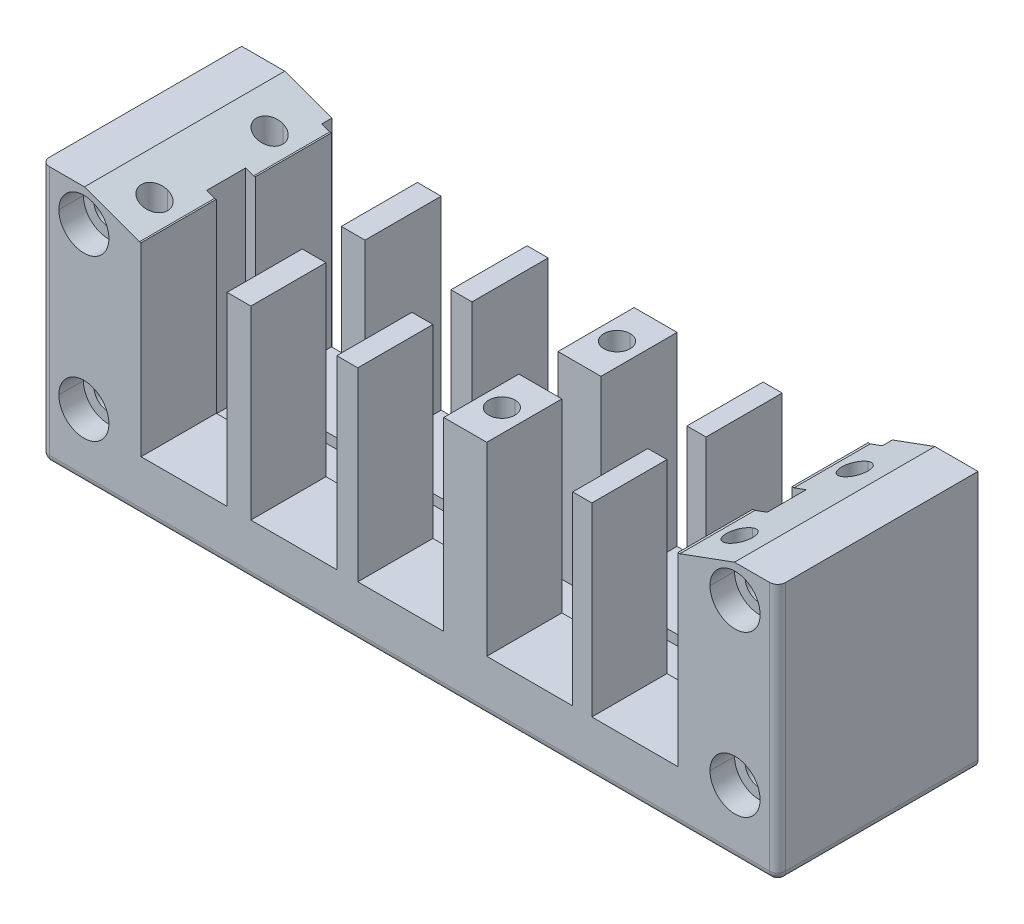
ISO-10303-21;
HEADER;
FILE_DESCRIPTION(('STEP AP214'),'2;1');
FILE_NAME('part.step','',(''),(''),'','','');
FILE_SCHEMA(('AUTOMOTIVE_DESIGN { 1 0 10303 214 1 1 1 1 }'));
ENDSEC;
DATA;
#1=APPLICATION_CONTEXT('core data for automotive mechanical design processes');
#2=APPLICATION_PROTOCOL_DEFINITION('international standard','automotive_design',2000,#1);
#3=PRODUCT_CONTEXT('',#1,'mechanical');
#4=PRODUCT('Part','Part','',(#3));
#5=PRODUCT_RELATED_PRODUCT_CATEGORY('part','',(#4));
#6=PRODUCT_DEFINITION_FORMATION('','',#4);
#7=PRODUCT_DEFINITION_CONTEXT('part definition',#1,'design');
#8=PRODUCT_DEFINITION('design','',#6,#7);
#9=PRODUCT_DEFINITION_SHAPE('','',#8);
#10=(LENGTH_UNIT() NAMED_UNIT(*) SI_UNIT(.MILLI.,.METRE.));
#11=(NAMED_UNIT(*) PLANE_ANGLE_UNIT() SI_UNIT($,.RADIAN.));
#12=(NAMED_UNIT(*) SI_UNIT($,.STERADIAN.) SOLID_ANGLE_UNIT());
#13=UNCERTAINTY_MEASURE_WITH_UNIT(LENGTH_MEASURE(1.E-05),#10,'distance_accuracy_value','');
#14=(GEOMETRIC_REPRESENTATION_CONTEXT(3) GLOBAL_UNCERTAINTY_ASSIGNED_CONTEXT((#13)) GLOBAL_UNIT_ASSIGNED_CONTEXT((#10,
#11,#12)) REPRESENTATION_CONTEXT('',''));
#15=CARTESIAN_POINT('',(0.,0.,0.));
#16=DIRECTION('',(0.,0.,1.));
#17=DIRECTION('',(1.,0.,0.));
#18=AXIS2_PLACEMENT_3D('',#15,#16,#17);
#19=CARTESIAN_POINT('',(0.,8.5,0.));
#20=DIRECTION('',(0.,1.,0.));
#21=DIRECTION('',(1.,0.,0.));
#22=AXIS2_PLACEMENT_3D('',#19,#20,#21);
#23=PLANE('',#22);
#24=DIRECTION('',(0.,0.,1.));
#25=VECTOR('',#24,1.);
#26=CARTESIAN_POINT('',(18.010000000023,8.5,0.));
#27=LINE('',#26,#25);
#28=CARTESIAN_POINT('',(18.010000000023,8.5,0.));
#29=VERTEX_POINT('',#28);
#30=CARTESIAN_POINT('',(18.010000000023,8.5,2.));
#31=VERTEX_POINT('',#30);
#32=EDGE_CURVE('E1929',#29,#31,#27,.T.);
#33=ORIENTED_EDGE('',*,*,#32,.T.);
#34=DIRECTION('',(1.,0.,0.));
#35=VECTOR('',#34,1.);
#36=CARTESIAN_POINT('',(18.010000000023,8.5,2.));
#37=LINE('',#36,#35);
#38=CARTESIAN_POINT('',(129.909999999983,8.5,2.));
#39=VERTEX_POINT('',#38);
#40=EDGE_CURVE('E10',#31,#39,#37,.T.);
#41=ORIENTED_EDGE('',*,*,#40,.T.);
#42=DIRECTION('',(0.,0.,-1.));
#43=VECTOR('',#42,1.);
#44=CARTESIAN_POINT('',(129.909999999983,8.5,0.));
#45=LINE('',#44,#43);
#46=CARTESIAN_POINT('',(129.909999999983,8.5,0.));
#47=VERTEX_POINT('',#46);
#48=EDGE_CURVE('E1931',#39,#47,#45,.T.);
#49=ORIENTED_EDGE('',*,*,#48,.T.);
#50=DIRECTION('',(-1.,0.,0.));
#51=VECTOR('',#50,1.);
#52=CARTESIAN_POINT('',(18.010000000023,8.5,0.));
#53=LINE('',#52,#51);
#54=EDGE_CURVE('E1252',#47,#29,#53,.T.);
#55=ORIENTED_EDGE('',*,*,#54,.T.);
#56=EDGE_LOOP('',(#33,#41,#49,#55));
#57=FACE_BOUND('',#56,.T.);
#58=ADVANCED_FACE('F15',(#57),#23,.T.);
#59=CARTESIAN_POINT('',(18.010000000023,58.5,2.));
#60=DIRECTION('',(0.,0.,-1.));
#61=DIRECTION('',(0.,-1.,0.));
#62=AXIS2_PLACEMENT_3D('',#59,#60,#61);
#63=PLANE('',#62);
#64=DIRECTION('',(0.938908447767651,0.344167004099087,0.));
#65=VECTOR('',#64,1.);
#66=CARTESIAN_POINT('',(138.389909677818,51.5,2.));
#67=LINE('',#66,#65);
#68=CARTESIAN_POINT('',(127.477667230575,47.5,2.));
#69=VERTEX_POINT('',#68);
#70=CARTESIAN_POINT('',(129.909999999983,48.3915977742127,2.));
#71=VERTEX_POINT('',#70);
#72=EDGE_CURVE('E1153',#69,#71,#67,.T.);
#73=ORIENTED_EDGE('',*,*,#72,.T.);
#74=DIRECTION('',(0.,-1.,0.));
#75=VECTOR('',#74,1.);
#76=CARTESIAN_POINT('',(129.909999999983,58.5,2.));
#77=LINE('',#76,#75);
#78=EDGE_CURVE('E18',#71,#39,#77,.T.);
#79=ORIENTED_EDGE('',*,*,#78,.T.);
#80=ORIENTED_EDGE('',*,*,#40,.F.);
#81=DIRECTION('',(0.,-1.,0.));
#82=VECTOR('',#81,1.);
#83=CARTESIAN_POINT('',(18.010000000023,58.5,2.));
#84=LINE('',#83,#82);
#85=CARTESIAN_POINT('',(18.010000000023,48.0787126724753,2.));
#86=VERTEX_POINT('',#85);
#87=EDGE_CURVE('E1925',#86,#31,#84,.T.);
#88=ORIENTED_EDGE('',*,*,#87,.F.);
#89=DIRECTION('',(0.939692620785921,-0.342020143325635,0.));
#90=VECTOR('',#89,1.);
#91=CARTESIAN_POINT('',(8.61009032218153,51.5,2.));
#92=LINE('',#91,#90);
#93=CARTESIAN_POINT('',(19.6000000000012,47.5,2.));
#94=VERTEX_POINT('',#93);
#95=EDGE_CURVE('E1214',#86,#94,#92,.T.);
#96=ORIENTED_EDGE('',*,*,#95,.T.);
#97=DIRECTION('',(1.,0.,0.));
#98=VECTOR('',#97,1.);
#99=CARTESIAN_POINT('',(19.6000000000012,47.5,2.));
#100=LINE('',#99,#98);
#101=CARTESIAN_POINT('',(19.930000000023,47.5,2.));
#102=VERTEX_POINT('',#101);
#103=EDGE_CURVE('E1078',#94,#102,#100,.T.);
#104=ORIENTED_EDGE('',*,*,#103,.T.);
#105=DIRECTION('',(0.,-1.,0.));
#106=VECTOR('',#105,1.);
#107=CARTESIAN_POINT('',(19.930000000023,10.5,2.));
#108=LINE('',#107,#106);
#109=CARTESIAN_POINT('',(19.930000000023,10.5,2.));
#110=VERTEX_POINT('',#109);
#111=EDGE_CURVE('E1054',#102,#110,#108,.T.);
#112=ORIENTED_EDGE('',*,*,#111,.T.);
#113=DIRECTION('',(-1.,0.,0.));
#114=VECTOR('',#113,1.);
#115=CARTESIAN_POINT('',(0.,10.5,2.));
#116=LINE('',#115,#114);
#117=CARTESIAN_POINT('',(37.090000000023,10.5,2.));
#118=VERTEX_POINT('',#117);
#119=EDGE_CURVE('E1048',#118,#110,#116,.T.);
#120=ORIENTED_EDGE('',*,*,#119,.F.);
#121=DIRECTION('',(0.,1.,0.));
#122=VECTOR('',#121,1.);
#123=CARTESIAN_POINT('',(37.090000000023,10.5,2.));
#124=LINE('',#123,#122);
#125=CARTESIAN_POINT('',(37.090000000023,47.5,2.));
#126=VERTEX_POINT('',#125);
#127=EDGE_CURVE('E1040',#118,#126,#124,.T.);
#128=ORIENTED_EDGE('',*,*,#127,.T.);
#129=DIRECTION('',(1.,0.,0.));
#130=VECTOR('',#129,1.);
#131=CARTESIAN_POINT('',(19.6000000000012,47.5,2.));
#132=LINE('',#131,#130);
#133=CARTESIAN_POINT('',(41.8299999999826,47.5,2.));
#134=VERTEX_POINT('',#133);
#135=EDGE_CURVE('E1046',#126,#134,#132,.T.);
#136=ORIENTED_EDGE('',*,*,#135,.T.);
#137=DIRECTION('',(0.,-1.,0.));
#138=VECTOR('',#137,1.);
#139=CARTESIAN_POINT('',(41.8299999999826,10.5,2.));
#140=LINE('',#139,#138);
#141=CARTESIAN_POINT('',(41.8299999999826,10.5,2.));
#142=VERTEX_POINT('',#141);
#143=EDGE_CURVE('E1408',#134,#142,#140,.T.);
#144=ORIENTED_EDGE('',*,*,#143,.T.);
#145=DIRECTION('',(-1.,0.,0.));
#146=VECTOR('',#145,1.);
#147=CARTESIAN_POINT('',(0.,10.5,2.));
#148=LINE('',#147,#146);
#149=CARTESIAN_POINT('',(58.9899999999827,10.5,2.));
#150=VERTEX_POINT('',#149);
#151=EDGE_CURVE('E1436',#150,#142,#148,.T.);
#152=ORIENTED_EDGE('',*,*,#151,.F.);
#153=DIRECTION('',(0.,1.,0.));
#154=VECTOR('',#153,1.);
#155=CARTESIAN_POINT('',(58.9899999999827,10.5,2.));
#156=LINE('',#155,#154);
#157=CARTESIAN_POINT('',(58.9899999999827,47.5,2.));
#158=VERTEX_POINT('',#157);
#159=EDGE_CURVE('E1429',#150,#158,#156,.T.);
#160=ORIENTED_EDGE('',*,*,#159,.T.);
#161=DIRECTION('',(1.,0.,0.));
#162=VECTOR('',#161,1.);
#163=CARTESIAN_POINT('',(19.6000000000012,47.5,2.));
#164=LINE('',#163,#162);
#165=CARTESIAN_POINT('',(63.1845993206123,47.5,2.));
#166=VERTEX_POINT('',#165);
#167=EDGE_CURVE('E1085',#158,#166,#164,.T.);
#168=ORIENTED_EDGE('',*,*,#167,.T.);
#169=DIRECTION('',(0.,-1.,0.));
#170=VECTOR('',#169,1.);
#171=CARTESIAN_POINT('',(63.1845993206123,10.5,2.));
#172=LINE('',#171,#170);
#173=CARTESIAN_POINT('',(63.1845993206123,10.5,2.));
#174=VERTEX_POINT('',#173);
#175=EDGE_CURVE('E1374',#166,#174,#172,.T.);
#176=ORIENTED_EDGE('',*,*,#175,.T.);
#177=DIRECTION('',(-1.,0.,0.));
#178=VECTOR('',#177,1.);
#179=CARTESIAN_POINT('',(0.,10.5,2.));
#180=LINE('',#179,#178);
#181=CARTESIAN_POINT('',(80.3445993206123,10.5,2.));
#182=VERTEX_POINT('',#181);
#183=EDGE_CURVE('E1402',#182,#174,#180,.T.);
#184=ORIENTED_EDGE('',*,*,#183,.F.);
#185=DIRECTION('',(0.,1.,0.));
#186=VECTOR('',#185,1.);
#187=CARTESIAN_POINT('',(80.3445993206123,10.5,2.));
#188=LINE('',#187,#186);
#189=CARTESIAN_POINT('',(80.3445993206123,47.5,2.));
#190=VERTEX_POINT('',#189);
#191=EDGE_CURVE('E1392',#182,#190,#188,.T.);
#192=ORIENTED_EDGE('',*,*,#191,.T.);
#193=DIRECTION('',(1.,0.,0.));
#194=VECTOR('',#193,1.);
#195=CARTESIAN_POINT('',(19.6000000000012,47.5,2.));
#196=LINE('',#195,#194);
#197=CARTESIAN_POINT('',(88.929999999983,47.5,2.));
#198=VERTEX_POINT('',#197);
#199=EDGE_CURVE('E1095',#190,#198,#196,.T.);
#200=ORIENTED_EDGE('',*,*,#199,.T.);
#201=DIRECTION('',(0.,-1.,0.));
#202=VECTOR('',#201,1.);
#203=CARTESIAN_POINT('',(88.929999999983,10.5,2.));
#204=LINE('',#203,#202);
#205=CARTESIAN_POINT('',(88.929999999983,10.5,2.));
#206=VERTEX_POINT('',#205);
#207=EDGE_CURVE('E1332',#198,#206,#204,.T.);
#208=ORIENTED_EDGE('',*,*,#207,.T.);
#209=DIRECTION('',(-1.,0.,0.));
#210=VECTOR('',#209,1.);
#211=CARTESIAN_POINT('',(0.,10.5,2.));
#212=LINE('',#211,#210);
#213=CARTESIAN_POINT('',(106.089999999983,10.5,2.));
#214=VERTEX_POINT('',#213);
#215=EDGE_CURVE('E1368',#214,#206,#212,.T.);
#216=ORIENTED_EDGE('',*,*,#215,.F.);
#217=DIRECTION('',(0.,1.,0.));
#218=VECTOR('',#217,1.);
#219=CARTESIAN_POINT('',(106.089999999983,10.5,2.));
#220=LINE('',#219,#218);
#221=CARTESIAN_POINT('',(106.089999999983,47.5,2.));
#222=VERTEX_POINT('',#221);
#223=EDGE_CURVE('E1358',#214,#222,#220,.T.);
#224=ORIENTED_EDGE('',*,*,#223,.T.);
#225=DIRECTION('',(1.,0.,0.));
#226=VECTOR('',#225,1.);
#227=CARTESIAN_POINT('',(19.6000000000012,47.5,2.));
#228=LINE('',#227,#226);
#229=CARTESIAN_POINT('',(109.909999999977,47.5,2.));
#230=VERTEX_POINT('',#229);
#231=EDGE_CURVE('E1108',#222,#230,#228,.T.);
#232=ORIENTED_EDGE('',*,*,#231,.T.);
#233=DIRECTION('',(0.,-1.,0.));
#234=VECTOR('',#233,1.);
#235=CARTESIAN_POINT('',(109.909999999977,10.5,2.));
#236=LINE('',#235,#234);
#237=CARTESIAN_POINT('',(109.909999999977,10.5,2.));
#238=VERTEX_POINT('',#237);
#239=EDGE_CURVE('E1307',#230,#238,#236,.T.);
#240=ORIENTED_EDGE('',*,*,#239,.T.);
#241=DIRECTION('',(-1.,0.,0.));
#242=VECTOR('',#241,1.);
#243=CARTESIAN_POINT('',(0.,10.5,2.));
#244=LINE('',#243,#242);
#245=CARTESIAN_POINT('',(127.069999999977,10.5,2.));
#246=VERTEX_POINT('',#245);
#247=EDGE_CURVE('E1326',#246,#238,#244,.T.);
#248=ORIENTED_EDGE('',*,*,#247,.F.);
#249=DIRECTION('',(0.,1.,0.));
#250=VECTOR('',#249,1.);
#251=CARTESIAN_POINT('',(127.069999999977,10.5,2.));
#252=LINE('',#251,#250);
#253=CARTESIAN_POINT('',(127.069999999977,47.5,2.));
#254=VERTEX_POINT('',#253);
#255=EDGE_CURVE('E1319',#246,#254,#252,.T.);
#256=ORIENTED_EDGE('',*,*,#255,.T.);
#257=DIRECTION('',(1.,0.,0.));
#258=VECTOR('',#257,1.);
#259=CARTESIAN_POINT('',(19.6000000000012,47.5,2.));
#260=LINE('',#259,#258);
#261=EDGE_CURVE('E1199',#254,#69,#260,.T.);
#262=ORIENTED_EDGE('',*,*,#261,.T.);
#263=EDGE_LOOP('',(#73,#79,#80,#88,#96,#104,#112,#120,#128,#136,#144,#152,#160,#168,#176,#184,
#192,#200,#208,#216,#224,#232,#240,#248,#256,#262));
#264=FACE_BOUND('',#263,.T.);
#265=ADVANCED_FACE('F1043',(#264),#63,.T.);
#266=CARTESIAN_POINT('',(129.909999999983,58.5,0.));
#267=DIRECTION('',(-1.,0.,0.));
#268=DIRECTION('',(0.,0.,1.));
#269=AXIS2_PLACEMENT_3D('',#266,#267,#268);
#270=PLANE('',#269);
#271=DIRECTION('',(0.,0.,-1.));
#272=VECTOR('',#271,1.);
#273=CARTESIAN_POINT('',(129.909999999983,48.3915977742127,40.));
#274=LINE('',#273,#272);
#275=CARTESIAN_POINT('',(129.909999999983,48.3915977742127,0.));
#276=VERTEX_POINT('',#275);
#277=EDGE_CURVE('E1149',#71,#276,#274,.T.);
#278=ORIENTED_EDGE('',*,*,#277,.T.);
#279=DIRECTION('',(0.,-1.,0.));
#280=VECTOR('',#279,1.);
#281=CARTESIAN_POINT('',(129.909999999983,58.5,0.));
#282=LINE('',#281,#280);
#283=EDGE_CURVE('E1244',#276,#47,#282,.T.);
#284=ORIENTED_EDGE('',*,*,#283,.T.);
#285=ORIENTED_EDGE('',*,*,#48,.F.);
#286=ORIENTED_EDGE('',*,*,#78,.F.);
#287=EDGE_LOOP('',(#278,#284,#285,#286));
#288=FACE_BOUND('',#287,.T.);
#289=ADVANCED_FACE('F1942',(#288),#270,.T.);
#290=CARTESIAN_POINT('',(18.010000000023,58.5,0.));
#291=DIRECTION('',(1.,0.,0.));
#292=DIRECTION('',(0.,0.,1.));
#293=AXIS2_PLACEMENT_3D('',#290,#291,#292);
#294=PLANE('',#293);
#295=DIRECTION('',(0.,0.,1.));
#296=VECTOR('',#295,1.);
#297=CARTESIAN_POINT('',(18.010000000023,48.0787126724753,40.));
#298=LINE('',#297,#296);
#299=CARTESIAN_POINT('',(18.010000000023,48.0787126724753,0.));
#300=VERTEX_POINT('',#299);
#301=EDGE_CURVE('E1217',#300,#86,#298,.T.);
#302=ORIENTED_EDGE('',*,*,#301,.T.);
#303=ORIENTED_EDGE('',*,*,#87,.T.);
#304=ORIENTED_EDGE('',*,*,#32,.F.);
#305=DIRECTION('',(0.,-1.,0.));
#306=VECTOR('',#305,1.);
#307=CARTESIAN_POINT('',(18.010000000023,58.5,0.));
#308=LINE('',#307,#306);
#309=EDGE_CURVE('E1243',#300,#29,#308,.T.);
#310=ORIENTED_EDGE('',*,*,#309,.F.);
#311=EDGE_LOOP('',(#302,#303,#304,#310));
#312=FACE_BOUND('',#311,.T.);
#313=ADVANCED_FACE('F2450',(#312),#294,.T.);
#314=CARTESIAN_POINT('',(18.010000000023,58.5,25.));
#315=DIRECTION('',(0.,0.,-1.));
#316=DIRECTION('',(0.,-1.,0.));
#317=AXIS2_PLACEMENT_3D('',#314,#315,#316);
#318=PLANE('',#317);
#319=DIRECTION('',(0.938908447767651,0.344167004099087,0.));
#320=VECTOR('',#319,1.);
#321=CARTESIAN_POINT('',(138.389909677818,51.5,25.));
#322=LINE('',#321,#320);
#323=CARTESIAN_POINT('',(127.477667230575,47.5,25.));
#324=VERTEX_POINT('',#323);
#325=CARTESIAN_POINT('',(129.909999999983,48.3915977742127,25.));
#326=VERTEX_POINT('',#325);
#327=EDGE_CURVE('E1124',#324,#326,#322,.T.);
#328=ORIENTED_EDGE('',*,*,#327,.T.);
#329=DIRECTION('',(0.,-1.,0.));
#330=VECTOR('',#329,1.);
#331=CARTESIAN_POINT('',(129.909999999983,58.5,25.));
#332=LINE('',#331,#330);
#333=CARTESIAN_POINT('',(129.909999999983,8.5,25.));
#334=VERTEX_POINT('',#333);
#335=EDGE_CURVE('E1919',#326,#334,#332,.T.);
#336=ORIENTED_EDGE('',*,*,#335,.T.);
#337=DIRECTION('',(1.,0.,0.));
#338=VECTOR('',#337,1.);
#339=CARTESIAN_POINT('',(18.010000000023,8.5,25.));
#340=LINE('',#339,#338);
#341=CARTESIAN_POINT('',(18.010000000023,8.5,25.));
#342=VERTEX_POINT('',#341);
#343=EDGE_CURVE('E1805',#342,#334,#340,.T.);
#344=ORIENTED_EDGE('',*,*,#343,.F.);
#345=DIRECTION('',(0.,-1.,0.));
#346=VECTOR('',#345,1.);
#347=CARTESIAN_POINT('',(18.010000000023,58.5,25.));
#348=LINE('',#347,#346);
#349=CARTESIAN_POINT('',(18.010000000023,48.0787126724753,25.));
#350=VERTEX_POINT('',#349);
#351=EDGE_CURVE('E1922',#350,#342,#348,.T.);
#352=ORIENTED_EDGE('',*,*,#351,.F.);
#353=DIRECTION('',(0.939692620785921,-0.342020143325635,0.));
#354=VECTOR('',#353,1.);
#355=CARTESIAN_POINT('',(8.61009032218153,51.5,25.));
#356=LINE('',#355,#354);
#357=CARTESIAN_POINT('',(19.6000000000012,47.5,25.));
#358=VERTEX_POINT('',#357);
#359=EDGE_CURVE('E1203',#350,#358,#356,.T.);
#360=ORIENTED_EDGE('',*,*,#359,.T.);
#361=DIRECTION('',(1.,0.,0.));
#362=VECTOR('',#361,1.);
#363=CARTESIAN_POINT('',(19.6000000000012,47.5,25.));
#364=LINE('',#363,#362);
#365=CARTESIAN_POINT('',(19.930000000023,47.5,25.));
#366=VERTEX_POINT('',#365);
#367=EDGE_CURVE('E2278',#358,#366,#364,.T.);
#368=ORIENTED_EDGE('',*,*,#367,.T.);
#369=DIRECTION('',(0.,-1.,0.));
#370=VECTOR('',#369,1.);
#371=CARTESIAN_POINT('',(19.930000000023,10.5,25.));
#372=LINE('',#371,#370);
#373=CARTESIAN_POINT('',(19.930000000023,10.5,25.));
#374=VERTEX_POINT('',#373);
#375=EDGE_CURVE('E1442',#366,#374,#372,.T.);
#376=ORIENTED_EDGE('',*,*,#375,.T.);
#377=DIRECTION('',(-1.,0.,0.));
#378=VECTOR('',#377,1.);
#379=CARTESIAN_POINT('',(0.,10.5,25.));
#380=LINE('',#379,#378);
#381=CARTESIAN_POINT('',(37.090000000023,10.5,25.));
#382=VERTEX_POINT('',#381);
#383=EDGE_CURVE('E2288',#382,#374,#380,.T.);
#384=ORIENTED_EDGE('',*,*,#383,.F.);
#385=DIRECTION('',(0.,1.,0.));
#386=VECTOR('',#385,1.);
#387=CARTESIAN_POINT('',(37.090000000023,10.5,25.));
#388=LINE('',#387,#386);
#389=CARTESIAN_POINT('',(37.090000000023,47.5,25.));
#390=VERTEX_POINT('',#389);
#391=EDGE_CURVE('E2129',#382,#390,#388,.T.);
#392=ORIENTED_EDGE('',*,*,#391,.T.);
#393=DIRECTION('',(1.,0.,0.));
#394=VECTOR('',#393,1.);
#395=CARTESIAN_POINT('',(19.6000000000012,47.5,25.));
#396=LINE('',#395,#394);
#397=CARTESIAN_POINT('',(41.8299999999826,47.5,25.));
#398=VERTEX_POINT('',#397);
#399=EDGE_CURVE('E2168',#390,#398,#396,.T.);
#400=ORIENTED_EDGE('',*,*,#399,.T.);
#401=DIRECTION('',(0.,-1.,0.));
#402=VECTOR('',#401,1.);
#403=CARTESIAN_POINT('',(41.8299999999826,10.5,25.));
#404=LINE('',#403,#402);
#405=CARTESIAN_POINT('',(41.8299999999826,10.5,25.));
#406=VERTEX_POINT('',#405);
#407=EDGE_CURVE('E2031',#398,#406,#404,.T.);
#408=ORIENTED_EDGE('',*,*,#407,.T.);
#409=DIRECTION('',(-1.,0.,0.));
#410=VECTOR('',#409,1.);
#411=CARTESIAN_POINT('',(0.,10.5,25.));
#412=LINE('',#411,#410);
#413=CARTESIAN_POINT('',(58.9899999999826,10.5,25.));
#414=VERTEX_POINT('',#413);
#415=EDGE_CURVE('E2072',#414,#406,#412,.T.);
#416=ORIENTED_EDGE('',*,*,#415,.F.);
#417=DIRECTION('',(0.,1.,0.));
#418=VECTOR('',#417,1.);
#419=CARTESIAN_POINT('',(58.9899999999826,10.5,25.));
#420=LINE('',#419,#418);
#421=CARTESIAN_POINT('',(58.9899999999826,47.5,25.));
#422=VERTEX_POINT('',#421);
#423=EDGE_CURVE('E2054',#414,#422,#420,.T.);
#424=ORIENTED_EDGE('',*,*,#423,.T.);
#425=DIRECTION('',(1.,0.,0.));
#426=VECTOR('',#425,1.);
#427=CARTESIAN_POINT('',(19.6000000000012,47.5,25.));
#428=LINE('',#427,#426);
#429=CARTESIAN_POINT('',(63.1845993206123,47.5,25.));
#430=VERTEX_POINT('',#429);
#431=EDGE_CURVE('E1989',#422,#430,#428,.T.);
#432=ORIENTED_EDGE('',*,*,#431,.T.);
#433=DIRECTION('',(0.,-1.,0.));
#434=VECTOR('',#433,1.);
#435=CARTESIAN_POINT('',(63.1845993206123,10.5,25.));
#436=LINE('',#435,#434);
#437=CARTESIAN_POINT('',(63.1845993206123,10.5,25.));
#438=VERTEX_POINT('',#437);
#439=EDGE_CURVE('E1967',#430,#438,#436,.T.);
#440=ORIENTED_EDGE('',*,*,#439,.T.);
#441=DIRECTION('',(-1.,0.,0.));
#442=VECTOR('',#441,1.);
#443=CARTESIAN_POINT('',(0.,10.5,25.));
#444=LINE('',#443,#442);
#445=CARTESIAN_POINT('',(80.3445993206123,10.5,25.));
#446=VERTEX_POINT('',#445);
#447=EDGE_CURVE('E2275',#446,#438,#444,.T.);
#448=ORIENTED_EDGE('',*,*,#447,.F.);
#449=DIRECTION('',(0.,1.,0.));
#450=VECTOR('',#449,1.);
#451=CARTESIAN_POINT('',(80.3445993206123,10.5,25.));
#452=LINE('',#451,#450);
#453=CARTESIAN_POINT('',(80.3445993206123,47.5,25.));
#454=VERTEX_POINT('',#453);
#455=EDGE_CURVE('E2265',#446,#454,#452,.T.);
#456=ORIENTED_EDGE('',*,*,#455,.T.);
#457=DIRECTION('',(1.,0.,0.));
#458=VECTOR('',#457,1.);
#459=CARTESIAN_POINT('',(19.6000000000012,47.5,25.));
#460=LINE('',#459,#458);
#461=CARTESIAN_POINT('',(88.929999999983,47.5,25.));
#462=VERTEX_POINT('',#461);
#463=EDGE_CURVE('E2001',#454,#462,#460,.T.);
#464=ORIENTED_EDGE('',*,*,#463,.T.);
#465=DIRECTION('',(0.,-1.,0.));
#466=VECTOR('',#465,1.);
#467=CARTESIAN_POINT('',(88.929999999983,10.5,25.));
#468=LINE('',#467,#466);
#469=CARTESIAN_POINT('',(88.929999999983,10.5,25.));
#470=VERTEX_POINT('',#469);
#471=EDGE_CURVE('E2260',#462,#470,#468,.T.);
#472=ORIENTED_EDGE('',*,*,#471,.T.);
#473=DIRECTION('',(-1.,0.,0.));
#474=VECTOR('',#473,1.);
#475=CARTESIAN_POINT('',(0.,10.5,25.));
#476=LINE('',#475,#474);
#477=CARTESIAN_POINT('',(106.089999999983,10.5,25.));
#478=VERTEX_POINT('',#477);
#479=EDGE_CURVE('E1968',#478,#470,#476,.T.);
#480=ORIENTED_EDGE('',*,*,#479,.F.);
#481=DIRECTION('',(0.,1.,0.));
#482=VECTOR('',#481,1.);
#483=CARTESIAN_POINT('',(106.089999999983,10.5,25.));
#484=LINE('',#483,#482);
#485=CARTESIAN_POINT('',(106.089999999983,47.5,25.));
#486=VERTEX_POINT('',#485);
#487=EDGE_CURVE('E2133',#478,#486,#484,.T.);
#488=ORIENTED_EDGE('',*,*,#487,.T.);
#489=DIRECTION('',(1.,0.,0.));
#490=VECTOR('',#489,1.);
#491=CARTESIAN_POINT('',(19.6000000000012,47.5,25.));
#492=LINE('',#491,#490);
#493=CARTESIAN_POINT('',(109.909999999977,47.5,25.));
#494=VERTEX_POINT('',#493);
#495=EDGE_CURVE('E2193',#486,#494,#492,.T.);
#496=ORIENTED_EDGE('',*,*,#495,.T.);
#497=DIRECTION('',(0.,-1.,0.));
#498=VECTOR('',#497,1.);
#499=CARTESIAN_POINT('',(109.909999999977,10.5,25.));
#500=LINE('',#499,#498);
#501=CARTESIAN_POINT('',(109.909999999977,10.5,25.));
#502=VERTEX_POINT('',#501);
#503=EDGE_CURVE('E2227',#494,#502,#500,.T.);
#504=ORIENTED_EDGE('',*,*,#503,.T.);
#505=DIRECTION('',(-1.,0.,0.));
#506=VECTOR('',#505,1.);
#507=CARTESIAN_POINT('',(0.,10.5,25.));
#508=LINE('',#507,#506);
#509=CARTESIAN_POINT('',(127.069999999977,10.5,25.));
#510=VERTEX_POINT('',#509);
#511=EDGE_CURVE('E2251',#510,#502,#508,.T.);
#512=ORIENTED_EDGE('',*,*,#511,.F.);
#513=DIRECTION('',(0.,1.,0.));
#514=VECTOR('',#513,1.);
#515=CARTESIAN_POINT('',(127.069999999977,10.5,25.));
#516=LINE('',#515,#514);
#517=CARTESIAN_POINT('',(127.069999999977,47.5,25.));
#518=VERTEX_POINT('',#517);
#519=EDGE_CURVE('E1308',#510,#518,#516,.T.);
#520=ORIENTED_EDGE('',*,*,#519,.T.);
#521=DIRECTION('',(1.,0.,0.));
#522=VECTOR('',#521,1.);
#523=CARTESIAN_POINT('',(19.6000000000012,47.5,25.));
#524=LINE('',#523,#522);
#525=EDGE_CURVE('E1181',#518,#324,#524,.T.);
#526=ORIENTED_EDGE('',*,*,#525,.T.);
#527=EDGE_LOOP('',(#328,#336,#344,#352,#360,#368,#376,#384,#392,#400,#408,#416,#424,#432,#440,
#448,#456,#464,#472,#480,#488,#496,#504,#512,#520,#526));
#528=FACE_BOUND('',#527,.T.);
#529=ADVANCED_FACE('F2801',(#528),#318,.T.);
#530=CARTESIAN_POINT('',(18.010000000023,58.5,17.2));
#531=DIRECTION('',(1.,0.,0.));
#532=DIRECTION('',(0.,0.,1.));
#533=AXIS2_PLACEMENT_3D('',#530,#531,#532);
#534=PLANE('',#533);
#535=DIRECTION('',(0.,0.,1.));
#536=VECTOR('',#535,1.);
#537=CARTESIAN_POINT('',(18.010000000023,48.0787126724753,40.));
#538=LINE('',#537,#536);
#539=CARTESIAN_POINT('',(18.010000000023,48.0787126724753,17.2));
#540=VERTEX_POINT('',#539);
#541=EDGE_CURVE('E1206',#540,#350,#538,.T.);
#542=ORIENTED_EDGE('',*,*,#541,.T.);
#543=ORIENTED_EDGE('',*,*,#351,.T.);
#544=DIRECTION('',(0.,0.,1.));
#545=VECTOR('',#544,1.);
#546=CARTESIAN_POINT('',(18.010000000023,8.5,17.2));
#547=LINE('',#546,#545);
#548=CARTESIAN_POINT('',(18.010000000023,8.5,17.2));
#549=VERTEX_POINT('',#548);
#550=EDGE_CURVE('E1897',#549,#342,#547,.T.);
#551=ORIENTED_EDGE('',*,*,#550,.F.);
#552=DIRECTION('',(0.,-1.,0.));
#553=VECTOR('',#552,1.);
#554=CARTESIAN_POINT('',(18.010000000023,58.5,17.2));
#555=LINE('',#554,#553);
#556=EDGE_CURVE('E1268',#540,#549,#555,.T.);
#557=ORIENTED_EDGE('',*,*,#556,.F.);
#558=EDGE_LOOP('',(#542,#543,#551,#557));
#559=FACE_BOUND('',#558,.T.);
#560=ADVANCED_FACE('F2458',(#559),#534,.T.);
#561=CARTESIAN_POINT('',(129.909999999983,58.5,17.2));
#562=DIRECTION('',(-1.,0.,0.));
#563=DIRECTION('',(0.,0.,1.));
#564=AXIS2_PLACEMENT_3D('',#561,#562,#563);
#565=PLANE('',#564);
#566=DIRECTION('',(0.,0.,-1.));
#567=VECTOR('',#566,1.);
#568=CARTESIAN_POINT('',(129.909999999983,48.3915977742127,40.));
#569=LINE('',#568,#567);
#570=CARTESIAN_POINT('',(129.909999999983,48.3915977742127,17.2));
#571=VERTEX_POINT('',#570);
#572=EDGE_CURVE('E1164',#326,#571,#569,.T.);
#573=ORIENTED_EDGE('',*,*,#572,.T.);
#574=DIRECTION('',(0.,-1.,0.));
#575=VECTOR('',#574,1.);
#576=CARTESIAN_POINT('',(129.909999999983,58.5,17.2));
#577=LINE('',#576,#575);
#578=CARTESIAN_POINT('',(129.909999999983,8.5,17.2));
#579=VERTEX_POINT('',#578);
#580=EDGE_CURVE('E1289',#571,#579,#577,.T.);
#581=ORIENTED_EDGE('',*,*,#580,.T.);
#582=DIRECTION('',(0.,0.,-1.));
#583=VECTOR('',#582,1.);
#584=CARTESIAN_POINT('',(129.909999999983,8.5,17.2));
#585=LINE('',#584,#583);
#586=EDGE_CURVE('E1894',#334,#579,#585,.T.);
#587=ORIENTED_EDGE('',*,*,#586,.F.);
#588=ORIENTED_EDGE('',*,*,#335,.F.);
#589=EDGE_LOOP('',(#573,#581,#587,#588));
#590=FACE_BOUND('',#589,.T.);
#591=ADVANCED_FACE('F2465',(#590),#565,.T.);
#592=CARTESIAN_POINT('',(145.4,1.6,40.));
#593=DIRECTION('',(0.,0.,-1.));
#594=DIRECTION('',(-1.,0.,0.));
#595=AXIS2_PLACEMENT_3D('',#592,#593,#594);
#596=CYLINDRICAL_SURFACE('',#595,1.6);
#597=CARTESIAN_POINT('',(145.4,1.6,38.4));
#598=DIRECTION('',(0.,0.,-1.));
#599=DIRECTION('',(1.,0.,0.));
#600=AXIS2_PLACEMENT_3D('',#597,#598,#599);
#601=CIRCLE('',#600,1.6);
#602=CARTESIAN_POINT('',(147.,1.6,38.4));
#603=VERTEX_POINT('',#602);
#604=CARTESIAN_POINT('',(145.4,0.,38.4));
#605=VERTEX_POINT('',#604);
#606=EDGE_CURVE('E1916',#603,#605,#601,.T.);
#607=ORIENTED_EDGE('',*,*,#606,.T.);
#608=DIRECTION('',(0.,0.,1.));
#609=VECTOR('',#608,1.);
#610=CARTESIAN_POINT('',(145.4,0.,40.));
#611=LINE('',#610,#609);
#612=CARTESIAN_POINT('',(145.4,0.,0.));
#613=VERTEX_POINT('',#612);
#614=EDGE_CURVE('E1506',#613,#605,#611,.T.);
#615=ORIENTED_EDGE('',*,*,#614,.F.);
#616=CARTESIAN_POINT('',(145.4,1.6,0.));
#617=DIRECTION('',(0.,0.,-1.));
#618=DIRECTION('',(1.,0.,0.));
#619=AXIS2_PLACEMENT_3D('',#616,#617,#618);
#620=CIRCLE('',#619,1.6);
#621=CARTESIAN_POINT('',(147.,1.6,0.));
#622=VERTEX_POINT('',#621);
#623=EDGE_CURVE('E1259',#622,#613,#620,.T.);
#624=ORIENTED_EDGE('',*,*,#623,.F.);
#625=DIRECTION('',(0.,0.,-1.));
#626=VECTOR('',#625,1.);
#627=CARTESIAN_POINT('',(147.,1.6,40.));
#628=LINE('',#627,#626);
#629=EDGE_CURVE('E1412',#603,#622,#628,.T.);
#630=ORIENTED_EDGE('',*,*,#629,.F.);
#631=EDGE_LOOP('',(#607,#615,#624,#630));
#632=FACE_BOUND('',#631,.T.);
#633=ADVANCED_FACE('F3039',(#632),#596,.T.);
#634=CARTESIAN_POINT('',(145.4,1.6,38.4));
#635=DIRECTION('',(0.,1.,0.));
#636=DIRECTION('',(1.,0.,0.));
#637=AXIS2_PLACEMENT_3D('',#634,#635,#636);
#638=SPHERICAL_SURFACE('',#637,1.6);
#639=CARTESIAN_POINT('',(145.4,1.6,38.4));
#640=DIRECTION('',(0.,-1.,0.));
#641=DIRECTION('',(0.,0.,-1.));
#642=AXIS2_PLACEMENT_3D('',#639,#640,#641);
#643=CIRCLE('',#642,1.6);
#644=CARTESIAN_POINT('',(145.4,1.6,40.));
#645=VERTEX_POINT('',#644);
#646=EDGE_CURVE('E1913',#603,#645,#643,.T.);
#647=ORIENTED_EDGE('',*,*,#646,.T.);
#648=CARTESIAN_POINT('',(145.4,1.6,38.4));
#649=DIRECTION('',(1.,0.,0.));
#650=DIRECTION('',(0.,0.,-1.));
#651=AXIS2_PLACEMENT_3D('',#648,#649,#650);
#652=CIRCLE('',#651,1.6);
#653=EDGE_CURVE('E1909',#645,#605,#652,.T.);
#654=ORIENTED_EDGE('',*,*,#653,.T.);
#655=ORIENTED_EDGE('',*,*,#606,.F.);
#656=EDGE_LOOP('',(#647,#654,#655));
#657=FACE_BOUND('',#656,.T.);
#658=ADVANCED_FACE('F3036',(#657),#638,.T.);
#659=CARTESIAN_POINT('',(145.4,0.,38.4));
#660=DIRECTION('',(0.,-1.,0.));
#661=DIRECTION('',(0.,0.,-1.));
#662=AXIS2_PLACEMENT_3D('',#659,#660,#661);
#663=CYLINDRICAL_SURFACE('',#662,1.6);
#664=CARTESIAN_POINT('',(145.4,51.5,38.4));
#665=DIRECTION('',(0.,1.,0.));
#666=DIRECTION('',(0.,0.,-1.));
#667=AXIS2_PLACEMENT_3D('',#664,#665,#666);
#668=CIRCLE('',#667,1.6);
#669=CARTESIAN_POINT('',(145.4,51.5,40.));
#670=VERTEX_POINT('',#669);
#671=CARTESIAN_POINT('',(147.,51.5,38.4));
#672=VERTEX_POINT('',#671);
#673=EDGE_CURVE('E1641',#670,#672,#668,.T.);
#674=ORIENTED_EDGE('',*,*,#673,.F.);
#675=DIRECTION('',(0.,1.,0.));
#676=VECTOR('',#675,1.);
#677=CARTESIAN_POINT('',(145.4,51.5,40.));
#678=LINE('',#677,#676);
#679=EDGE_CURVE('E1656',#645,#670,#678,.T.);
#680=ORIENTED_EDGE('',*,*,#679,.F.);
#681=ORIENTED_EDGE('',*,*,#646,.F.);
#682=DIRECTION('',(0.,-1.,0.));
#683=VECTOR('',#682,1.);
#684=CARTESIAN_POINT('',(147.,0.,38.4));
#685=LINE('',#684,#683);
#686=EDGE_CURVE('E1416',#672,#603,#685,.T.);
#687=ORIENTED_EDGE('',*,*,#686,.F.);
#688=EDGE_LOOP('',(#674,#680,#681,#687));
#689=FACE_BOUND('',#688,.T.);
#690=ADVANCED_FACE('F2571',(#689),#663,.T.);
#691=CARTESIAN_POINT('',(0.,1.6,38.4));
#692=DIRECTION('',(-1.,0.,0.));
#693=DIRECTION('',(0.,0.,1.));
#694=AXIS2_PLACEMENT_3D('',#691,#692,#693);
#695=CYLINDRICAL_SURFACE('',#694,1.6);
#696=CARTESIAN_POINT('',(1.6,1.6,38.4));
#697=DIRECTION('',(1.,0.,0.));
#698=DIRECTION('',(0.,0.,1.));
#699=AXIS2_PLACEMENT_3D('',#696,#697,#698);
#700=CIRCLE('',#699,1.6);
#701=CARTESIAN_POINT('',(1.6,1.6,40.));
#702=VERTEX_POINT('',#701);
#703=CARTESIAN_POINT('',(1.6,0.,38.4));
#704=VERTEX_POINT('',#703);
#705=EDGE_CURVE('E1906',#702,#704,#700,.T.);
#706=ORIENTED_EDGE('',*,*,#705,.T.);
#707=DIRECTION('',(-1.,0.,0.));
#708=VECTOR('',#707,1.);
#709=CARTESIAN_POINT('',(0.,0.,38.4));
#710=LINE('',#709,#708);
#711=EDGE_CURVE('E1510',#605,#704,#710,.T.);
#712=ORIENTED_EDGE('',*,*,#711,.F.);
#713=ORIENTED_EDGE('',*,*,#653,.F.);
#714=DIRECTION('',(1.,0.,0.));
#715=VECTOR('',#714,1.);
#716=CARTESIAN_POINT('',(147.,1.6,40.));
#717=LINE('',#716,#715);
#718=EDGE_CURVE('E1652',#702,#645,#717,.T.);
#719=ORIENTED_EDGE('',*,*,#718,.F.);
#720=EDGE_LOOP('',(#706,#712,#713,#719));
#721=FACE_BOUND('',#720,.T.);
#722=ADVANCED_FACE('F2566',(#721),#695,.T.);
#723=CARTESIAN_POINT('',(1.6,1.6,38.4));
#724=DIRECTION('',(0.,1.,0.));
#725=DIRECTION('',(1.,0.,0.));
#726=AXIS2_PLACEMENT_3D('',#723,#724,#725);
#727=SPHERICAL_SURFACE('',#726,1.6);
#728=CARTESIAN_POINT('',(1.6,1.6,38.4));
#729=DIRECTION('',(0.,-1.,0.));
#730=DIRECTION('',(0.,0.,-1.));
#731=AXIS2_PLACEMENT_3D('',#728,#729,#730);
#732=CIRCLE('',#731,1.6);
#733=CARTESIAN_POINT('',(0.,1.6,38.4));
#734=VERTEX_POINT('',#733);
#735=EDGE_CURVE('E1804',#702,#734,#732,.T.);
#736=ORIENTED_EDGE('',*,*,#735,.T.);
#737=CARTESIAN_POINT('',(1.6,1.6,38.4));
#738=DIRECTION('',(0.,0.,1.));
#739=DIRECTION('',(1.,0.,0.));
#740=AXIS2_PLACEMENT_3D('',#737,#738,#739);
#741=CIRCLE('',#740,1.6);
#742=EDGE_CURVE('E1800',#734,#704,#741,.T.);
#743=ORIENTED_EDGE('',*,*,#742,.T.);
#744=ORIENTED_EDGE('',*,*,#705,.F.);
#745=EDGE_LOOP('',(#736,#743,#744));
#746=FACE_BOUND('',#745,.T.);
#747=ADVANCED_FACE('F2884',(#746),#727,.T.);
#748=CARTESIAN_POINT('',(1.6,0.,38.4));
#749=DIRECTION('',(0.,1.,0.));
#750=DIRECTION('',(0.,0.,1.));
#751=AXIS2_PLACEMENT_3D('',#748,#749,#750);
#752=CYLINDRICAL_SURFACE('',#751,1.6);
#753=CARTESIAN_POINT('',(1.6,51.5,38.4));
#754=DIRECTION('',(0.,1.,0.));
#755=DIRECTION('',(0.,0.,-1.));
#756=AXIS2_PLACEMENT_3D('',#753,#754,#755);
#757=CIRCLE('',#756,1.6);
#758=CARTESIAN_POINT('',(0.,51.5,38.4));
#759=VERTEX_POINT('',#758);
#760=CARTESIAN_POINT('',(1.6,51.5,40.));
#761=VERTEX_POINT('',#760);
#762=EDGE_CURVE('E1644',#759,#761,#757,.T.);
#763=ORIENTED_EDGE('',*,*,#762,.F.);
#764=DIRECTION('',(0.,1.,0.));
#765=VECTOR('',#764,1.);
#766=CARTESIAN_POINT('',(0.,51.5,38.4));
#767=LINE('',#766,#765);
#768=EDGE_CURVE('E1499',#734,#759,#767,.T.);
#769=ORIENTED_EDGE('',*,*,#768,.F.);
#770=ORIENTED_EDGE('',*,*,#735,.F.);
#771=DIRECTION('',(0.,-1.,0.));
#772=VECTOR('',#771,1.);
#773=CARTESIAN_POINT('',(1.6,0.,40.));
#774=LINE('',#773,#772);
#775=EDGE_CURVE('E1659',#761,#702,#774,.T.);
#776=ORIENTED_EDGE('',*,*,#775,.F.);
#777=EDGE_LOOP('',(#763,#769,#770,#776));
#778=FACE_BOUND('',#777,.T.);
#779=ADVANCED_FACE('F2878',(#778),#752,.T.);
#780=CARTESIAN_POINT('',(1.6,1.6,40.));
#781=DIRECTION('',(0.,0.,-1.));
#782=DIRECTION('',(-1.,0.,0.));
#783=AXIS2_PLACEMENT_3D('',#780,#781,#782);
#784=CYLINDRICAL_SURFACE('',#783,1.6);
#785=CARTESIAN_POINT('',(1.6,1.6,0.));
#786=DIRECTION('',(0.,0.,-1.));
#787=DIRECTION('',(1.,0.,0.));
#788=AXIS2_PLACEMENT_3D('',#785,#786,#787);
#789=CIRCLE('',#788,1.6);
#790=CARTESIAN_POINT('',(1.6,0.,0.));
#791=VERTEX_POINT('',#790);
#792=CARTESIAN_POINT('',(0.,1.6,0.));
#793=VERTEX_POINT('',#792);
#794=EDGE_CURVE('E1267',#791,#793,#789,.T.);
#795=ORIENTED_EDGE('',*,*,#794,.F.);
#796=DIRECTION('',(0.,0.,-1.));
#797=VECTOR('',#796,1.);
#798=CARTESIAN_POINT('',(1.6,0.,40.));
#799=LINE('',#798,#797);
#800=EDGE_CURVE('E1514',#704,#791,#799,.T.);
#801=ORIENTED_EDGE('',*,*,#800,.F.);
#802=ORIENTED_EDGE('',*,*,#742,.F.);
#803=DIRECTION('',(0.,0.,1.));
#804=VECTOR('',#803,1.);
#805=CARTESIAN_POINT('',(0.,1.6,40.));
#806=LINE('',#805,#804);
#807=EDGE_CURVE('E1495',#793,#734,#806,.T.);
#808=ORIENTED_EDGE('',*,*,#807,.F.);
#809=EDGE_LOOP('',(#795,#801,#802,#808));
#810=FACE_BOUND('',#809,.T.);
#811=ADVANCED_FACE('F2872',(#810),#784,.T.);
#812=CARTESIAN_POINT('',(0.,8.5,0.));
#813=DIRECTION('',(0.,1.,0.));
#814=DIRECTION('',(1.,0.,0.));
#815=AXIS2_PLACEMENT_3D('',#812,#813,#814);
#816=PLANE('',#815);
#817=ORIENTED_EDGE('',*,*,#586,.T.);
#818=DIRECTION('',(-1.,0.,0.));
#819=VECTOR('',#818,1.);
#820=CARTESIAN_POINT('',(19.930000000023,8.5,17.2));
#821=LINE('',#820,#819);
#822=EDGE_CURVE('E1272',#579,#549,#821,.T.);
#823=ORIENTED_EDGE('',*,*,#822,.T.);
#824=ORIENTED_EDGE('',*,*,#550,.T.);
#825=ORIENTED_EDGE('',*,*,#343,.T.);
#826=EDGE_LOOP('',(#817,#823,#824,#825));
#827=FACE_BOUND('',#826,.T.);
#828=ADVANCED_FACE('F2462',(#827),#816,.T.);
#829=CARTESIAN_POINT('',(19.930000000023,8.5,17.2));
#830=DIRECTION('',(0.,0.,-1.));
#831=DIRECTION('',(0.,-1.,0.));
#832=AXIS2_PLACEMENT_3D('',#829,#830,#831);
#833=PLANE('',#832);
#834=DIRECTION('',(-1.,0.,0.));
#835=VECTOR('',#834,1.);
#836=CARTESIAN_POINT('',(0.,10.5,17.2));
#837=LINE('',#836,#835);
#838=CARTESIAN_POINT('',(127.069999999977,10.5,17.2));
#839=VERTEX_POINT('',#838);
#840=CARTESIAN_POINT('',(109.909999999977,10.5,17.2));
#841=VERTEX_POINT('',#840);
#842=EDGE_CURVE('E1329',#839,#841,#837,.T.);
#843=ORIENTED_EDGE('',*,*,#842,.T.);
#844=DIRECTION('',(0.,-1.,0.));
#845=VECTOR('',#844,1.);
#846=CARTESIAN_POINT('',(109.909999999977,10.5,17.2));
#847=LINE('',#846,#845);
#848=CARTESIAN_POINT('',(109.909999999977,47.5,17.2));
#849=VERTEX_POINT('',#848);
#850=EDGE_CURVE('E2092',#849,#841,#847,.T.);
#851=ORIENTED_EDGE('',*,*,#850,.F.);
#852=DIRECTION('',(1.,0.,0.));
#853=VECTOR('',#852,1.);
#854=CARTESIAN_POINT('',(19.6000000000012,47.5,17.2));
#855=LINE('',#854,#853);
#856=CARTESIAN_POINT('',(106.089999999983,47.5,17.2));
#857=VERTEX_POINT('',#856);
#858=EDGE_CURVE('E1116',#857,#849,#855,.T.);
#859=ORIENTED_EDGE('',*,*,#858,.F.);
#860=DIRECTION('',(0.,1.,0.));
#861=VECTOR('',#860,1.);
#862=CARTESIAN_POINT('',(106.089999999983,10.5,17.2));
#863=LINE('',#862,#861);
#864=CARTESIAN_POINT('',(106.089999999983,10.5,17.2));
#865=VERTEX_POINT('',#864);
#866=EDGE_CURVE('E1365',#865,#857,#863,.T.);
#867=ORIENTED_EDGE('',*,*,#866,.F.);
#868=DIRECTION('',(-1.,0.,0.));
#869=VECTOR('',#868,1.);
#870=CARTESIAN_POINT('',(0.,10.5,17.2));
#871=LINE('',#870,#869);
#872=CARTESIAN_POINT('',(88.929999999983,10.5,17.2));
#873=VERTEX_POINT('',#872);
#874=EDGE_CURVE('E1371',#865,#873,#871,.T.);
#875=ORIENTED_EDGE('',*,*,#874,.T.);
#876=DIRECTION('',(0.,-1.,0.));
#877=VECTOR('',#876,1.);
#878=CARTESIAN_POINT('',(88.929999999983,10.5,17.2));
#879=LINE('',#878,#877);
#880=CARTESIAN_POINT('',(88.929999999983,47.5,17.2));
#881=VERTEX_POINT('',#880);
#882=EDGE_CURVE('E1342',#881,#873,#879,.T.);
#883=ORIENTED_EDGE('',*,*,#882,.F.);
#884=DIRECTION('',(1.,0.,0.));
#885=VECTOR('',#884,1.);
#886=CARTESIAN_POINT('',(19.6000000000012,47.5,17.2));
#887=LINE('',#886,#885);
#888=CARTESIAN_POINT('',(80.3445993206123,47.5,17.2));
#889=VERTEX_POINT('',#888);
#890=EDGE_CURVE('E1105',#889,#881,#887,.T.);
#891=ORIENTED_EDGE('',*,*,#890,.F.);
#892=DIRECTION('',(0.,1.,0.));
#893=VECTOR('',#892,1.);
#894=CARTESIAN_POINT('',(80.3445993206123,10.5,17.2));
#895=LINE('',#894,#893);
#896=CARTESIAN_POINT('',(80.3445993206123,10.5,17.2));
#897=VERTEX_POINT('',#896);
#898=EDGE_CURVE('E1399',#897,#889,#895,.T.);
#899=ORIENTED_EDGE('',*,*,#898,.F.);
#900=DIRECTION('',(-1.,0.,0.));
#901=VECTOR('',#900,1.);
#902=CARTESIAN_POINT('',(0.,10.5,17.2));
#903=LINE('',#902,#901);
#904=CARTESIAN_POINT('',(63.1845993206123,10.5,17.2));
#905=VERTEX_POINT('',#904);
#906=EDGE_CURVE('E1405',#897,#905,#903,.T.);
#907=ORIENTED_EDGE('',*,*,#906,.T.);
#908=DIRECTION('',(0.,-1.,0.));
#909=VECTOR('',#908,1.);
#910=CARTESIAN_POINT('',(63.1845993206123,10.5,17.2));
#911=LINE('',#910,#909);
#912=CARTESIAN_POINT('',(63.1845993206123,47.5,17.2));
#913=VERTEX_POINT('',#912);
#914=EDGE_CURVE('E1378',#913,#905,#911,.T.);
#915=ORIENTED_EDGE('',*,*,#914,.F.);
#916=DIRECTION('',(1.,0.,0.));
#917=VECTOR('',#916,1.);
#918=CARTESIAN_POINT('',(19.6000000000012,47.5,17.2));
#919=LINE('',#918,#917);
#920=CARTESIAN_POINT('',(58.9899999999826,47.5,17.2));
#921=VERTEX_POINT('',#920);
#922=EDGE_CURVE('E1090',#921,#913,#919,.T.);
#923=ORIENTED_EDGE('',*,*,#922,.F.);
#924=DIRECTION('',(0.,1.,0.));
#925=VECTOR('',#924,1.);
#926=CARTESIAN_POINT('',(58.9899999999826,10.5,17.2));
#927=LINE('',#926,#925);
#928=CARTESIAN_POINT('',(58.9899999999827,10.5,17.2));
#929=VERTEX_POINT('',#928);
#930=EDGE_CURVE('E1433',#929,#921,#927,.T.);
#931=ORIENTED_EDGE('',*,*,#930,.F.);
#932=DIRECTION('',(-1.,0.,0.));
#933=VECTOR('',#932,1.);
#934=CARTESIAN_POINT('',(0.,10.5,17.2));
#935=LINE('',#934,#933);
#936=CARTESIAN_POINT('',(41.8299999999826,10.5,17.2));
#937=VERTEX_POINT('',#936);
#938=EDGE_CURVE('E1439',#929,#937,#935,.T.);
#939=ORIENTED_EDGE('',*,*,#938,.T.);
#940=DIRECTION('',(0.,-1.,0.));
#941=VECTOR('',#940,1.);
#942=CARTESIAN_POINT('',(41.8299999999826,10.5,17.2));
#943=LINE('',#942,#941);
#944=CARTESIAN_POINT('',(41.8299999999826,47.5,17.2));
#945=VERTEX_POINT('',#944);
#946=EDGE_CURVE('E1411',#945,#937,#943,.T.);
#947=ORIENTED_EDGE('',*,*,#946,.F.);
#948=DIRECTION('',(1.,0.,0.));
#949=VECTOR('',#948,1.);
#950=CARTESIAN_POINT('',(19.6000000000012,47.5,17.2));
#951=LINE('',#950,#949);
#952=CARTESIAN_POINT('',(37.090000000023,47.5,17.2));
#953=VERTEX_POINT('',#952);
#954=EDGE_CURVE('E1065',#953,#945,#951,.T.);
#955=ORIENTED_EDGE('',*,*,#954,.F.);
#956=DIRECTION('',(0.,1.,0.));
#957=VECTOR('',#956,1.);
#958=CARTESIAN_POINT('',(37.090000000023,10.5,17.2));
#959=LINE('',#958,#957);
#960=CARTESIAN_POINT('',(37.090000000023,10.5,17.2));
#961=VERTEX_POINT('',#960);
#962=EDGE_CURVE('E1060',#961,#953,#959,.T.);
#963=ORIENTED_EDGE('',*,*,#962,.F.);
#964=DIRECTION('',(-1.,0.,0.));
#965=VECTOR('',#964,1.);
#966=CARTESIAN_POINT('',(0.,10.5,17.2));
#967=LINE('',#966,#965);
#968=CARTESIAN_POINT('',(19.930000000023,10.5,17.2));
#969=VERTEX_POINT('',#968);
#970=EDGE_CURVE('E1466',#961,#969,#967,.T.);
#971=ORIENTED_EDGE('',*,*,#970,.T.);
#972=DIRECTION('',(0.,1.,0.));
#973=VECTOR('',#972,1.);
#974=CARTESIAN_POINT('',(19.930000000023,10.5,17.2));
#975=LINE('',#974,#973);
#976=CARTESIAN_POINT('',(19.930000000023,47.5,17.2));
#977=VERTEX_POINT('',#976);
#978=EDGE_CURVE('E1448',#969,#977,#975,.T.);
#979=ORIENTED_EDGE('',*,*,#978,.T.);
#980=DIRECTION('',(-1.,0.,0.));
#981=VECTOR('',#980,1.);
#982=CARTESIAN_POINT('',(19.6000000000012,47.5,17.2));
#983=LINE('',#982,#981);
#984=CARTESIAN_POINT('',(19.6000000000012,47.5,17.2));
#985=VERTEX_POINT('',#984);
#986=EDGE_CURVE('E2239',#977,#985,#983,.T.);
#987=ORIENTED_EDGE('',*,*,#986,.T.);
#988=DIRECTION('',(-0.939692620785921,0.342020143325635,0.));
#989=VECTOR('',#988,1.);
#990=CARTESIAN_POINT('',(8.61009032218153,51.5,17.2));
#991=LINE('',#990,#989);
#992=EDGE_CURVE('E1210',#985,#540,#991,.T.);
#993=ORIENTED_EDGE('',*,*,#992,.T.);
#994=ORIENTED_EDGE('',*,*,#556,.T.);
#995=ORIENTED_EDGE('',*,*,#822,.F.);
#996=ORIENTED_EDGE('',*,*,#580,.F.);
#997=DIRECTION('',(-0.938908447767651,-0.344167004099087,0.));
#998=VECTOR('',#997,1.);
#999=CARTESIAN_POINT('',(138.389909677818,51.5,17.2));
#1000=LINE('',#999,#998);
#1001=CARTESIAN_POINT('',(127.477667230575,47.5,17.2));
#1002=VERTEX_POINT('',#1001);
#1003=EDGE_CURVE('E1160',#571,#1002,#1000,.T.);
#1004=ORIENTED_EDGE('',*,*,#1003,.T.);
#1005=DIRECTION('',(-1.,0.,0.));
#1006=VECTOR('',#1005,1.);
#1007=CARTESIAN_POINT('',(19.6000000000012,47.5,17.2));
#1008=LINE('',#1007,#1006);
#1009=CARTESIAN_POINT('',(127.069999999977,47.5,17.2));
#1010=VERTEX_POINT('',#1009);
#1011=EDGE_CURVE('E1195',#1002,#1010,#1008,.T.);
#1012=ORIENTED_EDGE('',*,*,#1011,.T.);
#1013=DIRECTION('',(0.,-1.,0.));
#1014=VECTOR('',#1013,1.);
#1015=CARTESIAN_POINT('',(127.069999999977,10.5,17.2));
#1016=LINE('',#1015,#1014);
#1017=EDGE_CURVE('E1315',#1010,#839,#1016,.T.);
#1018=ORIENTED_EDGE('',*,*,#1017,.T.);
#1019=EDGE_LOOP('',(#843,#851,#859,#867,#875,#883,#891,#899,#907,#915,#923,#931,#939,#947,#955,
#963,#971,#979,#987,#993,#994,#995,#996,#1004,#1012,#1018));
#1020=FACE_BOUND('',#1019,.T.);
#1021=ADVANCED_FACE('F2319',(#1020),#833,.F.);
#1022=CARTESIAN_POINT('',(17.5534358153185,7.,5.26752451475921));
#1023=DIRECTION('',(0.866025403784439,0.,-0.5));
#1024=DIRECTION('',(0.,-1.,0.));
#1025=AXIS2_PLACEMENT_3D('',#1022,#1023,#1024);
#1026=PLANE('',#1025);
#1027=DIRECTION('',(0.5,0.,0.866025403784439));
#1028=VECTOR('',#1027,1.);
#1029=CARTESIAN_POINT('',(17.5534358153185,0.,5.26752451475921));
#1030=LINE('',#1029,#1028);
#1031=CARTESIAN_POINT('',(17.5534358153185,0.,5.2675245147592));
#1032=VERTEX_POINT('',#1031);
#1033=CARTESIAN_POINT('',(20.0068716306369,0.,9.517));
#1034=VERTEX_POINT('',#1033);
#1035=EDGE_CURVE('E1563',#1032,#1034,#1030,.T.);
#1036=ORIENTED_EDGE('',*,*,#1035,.T.);
#1037=DIRECTION('',(0.,-1.,0.));
#1038=VECTOR('',#1037,1.);
#1039=CARTESIAN_POINT('',(20.0068716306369,7.,9.517));
#1040=LINE('',#1039,#1038);
#1041=CARTESIAN_POINT('',(20.0068716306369,7.,9.517));
#1042=VERTEX_POINT('',#1041);
#1043=EDGE_CURVE('E1273',#1042,#1034,#1040,.T.);
#1044=ORIENTED_EDGE('',*,*,#1043,.F.);
#1045=DIRECTION('',(0.5,0.,0.866025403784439));
#1046=VECTOR('',#1045,1.);
#1047=CARTESIAN_POINT('',(17.5534358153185,7.,5.26752451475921));
#1048=LINE('',#1047,#1046);
#1049=CARTESIAN_POINT('',(17.5534358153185,7.,5.26752451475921));
#1050=VERTEX_POINT('',#1049);
#1051=EDGE_CURVE('E1298',#1050,#1042,#1048,.T.);
#1052=ORIENTED_EDGE('',*,*,#1051,.F.);
#1053=DIRECTION('',(0.,-1.,0.));
#1054=VECTOR('',#1053,1.);
#1055=CARTESIAN_POINT('',(17.5534358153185,7.,5.26752451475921));
#1056=LINE('',#1055,#1054);
#1057=EDGE_CURVE('E1880',#1050,#1032,#1056,.T.);
#1058=ORIENTED_EDGE('',*,*,#1057,.T.);
#1059=EDGE_LOOP('',(#1036,#1044,#1052,#1058));
#1060=FACE_BOUND('',#1059,.T.);
#1061=ADVANCED_FACE('F2779',(#1060),#1026,.F.);
#1062=CARTESIAN_POINT('',(20.0068716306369,7.,9.517));
#1063=DIRECTION('',(0.866025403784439,0.,0.5));
#1064=DIRECTION('',(0.,-1.,0.));
#1065=AXIS2_PLACEMENT_3D('',#1062,#1063,#1064);
#1066=PLANE('',#1065);
#1067=DIRECTION('',(-0.5,0.,0.866025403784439));
#1068=VECTOR('',#1067,1.);
#1069=CARTESIAN_POINT('',(20.0068716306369,0.,9.517));
#1070=LINE('',#1069,#1068);
#1071=CARTESIAN_POINT('',(17.5534358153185,0.,13.7664754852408));
#1072=VERTEX_POINT('',#1071);
#1073=EDGE_CURVE('E1580',#1034,#1072,#1070,.T.);
#1074=ORIENTED_EDGE('',*,*,#1073,.T.);
#1075=DIRECTION('',(0.,-1.,0.));
#1076=VECTOR('',#1075,1.);
#1077=CARTESIAN_POINT('',(17.5534358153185,7.,13.7664754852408));
#1078=LINE('',#1077,#1076);
#1079=CARTESIAN_POINT('',(17.5534358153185,7.,13.7664754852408));
#1080=VERTEX_POINT('',#1079);
#1081=EDGE_CURVE('E1452',#1080,#1072,#1078,.T.);
#1082=ORIENTED_EDGE('',*,*,#1081,.F.);
#1083=DIRECTION('',(-0.5,0.,0.866025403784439));
#1084=VECTOR('',#1083,1.);
#1085=CARTESIAN_POINT('',(20.0068716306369,7.,9.517));
#1086=LINE('',#1085,#1084);
#1087=EDGE_CURVE('E1293',#1042,#1080,#1086,.T.);
#1088=ORIENTED_EDGE('',*,*,#1087,.F.);
#1089=ORIENTED_EDGE('',*,*,#1043,.T.);
#1090=EDGE_LOOP('',(#1074,#1082,#1088,#1089));
#1091=FACE_BOUND('',#1090,.T.);
#1092=ADVANCED_FACE('F2775',(#1091),#1066,.F.);
#1093=CARTESIAN_POINT('',(17.5534358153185,7.,13.7664754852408));
#1094=DIRECTION('',(0.,0.,1.));
#1095=DIRECTION('',(1.,0.,0.));
#1096=AXIS2_PLACEMENT_3D('',#1093,#1094,#1095);
#1097=PLANE('',#1096);
#1098=DIRECTION('',(-1.,0.,0.));
#1099=VECTOR('',#1098,1.);
#1100=CARTESIAN_POINT('',(17.5534358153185,0.,13.7664754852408));
#1101=LINE('',#1100,#1099);
#1102=CARTESIAN_POINT('',(12.6465641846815,0.,13.7664754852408));
#1103=VERTEX_POINT('',#1102);
#1104=EDGE_CURVE('E1576',#1072,#1103,#1101,.T.);
#1105=ORIENTED_EDGE('',*,*,#1104,.T.);
#1106=DIRECTION('',(0.,-1.,0.));
#1107=VECTOR('',#1106,1.);
#1108=CARTESIAN_POINT('',(12.6465641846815,7.,13.7664754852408));
#1109=LINE('',#1108,#1107);
#1110=CARTESIAN_POINT('',(12.6465641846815,7.,13.7664754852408));
#1111=VERTEX_POINT('',#1110);
#1112=EDGE_CURVE('E1449',#1111,#1103,#1109,.T.);
#1113=ORIENTED_EDGE('',*,*,#1112,.F.);
#1114=DIRECTION('',(-1.,0.,0.));
#1115=VECTOR('',#1114,1.);
#1116=CARTESIAN_POINT('',(17.5534358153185,7.,13.7664754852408));
#1117=LINE('',#1116,#1115);
#1118=EDGE_CURVE('E1297',#1080,#1111,#1117,.T.);
#1119=ORIENTED_EDGE('',*,*,#1118,.F.);
#1120=ORIENTED_EDGE('',*,*,#1081,.T.);
#1121=EDGE_LOOP('',(#1105,#1113,#1119,#1120));
#1122=FACE_BOUND('',#1121,.T.);
#1123=ADVANCED_FACE('F2778',(#1122),#1097,.F.);
#1124=CARTESIAN_POINT('',(12.6465641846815,7.,13.7664754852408));
#1125=DIRECTION('',(-0.866025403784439,0.,0.5));
#1126=DIRECTION('',(0.,1.,0.));
#1127=AXIS2_PLACEMENT_3D('',#1124,#1125,#1126);
#1128=PLANE('',#1127);
#1129=DIRECTION('',(-0.5,0.,-0.866025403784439));
#1130=VECTOR('',#1129,1.);
#1131=CARTESIAN_POINT('',(12.6465641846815,0.,13.7664754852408));
#1132=LINE('',#1131,#1130);
#1133=CARTESIAN_POINT('',(10.193128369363,0.,9.517));
#1134=VERTEX_POINT('',#1133);
#1135=EDGE_CURVE('E1575',#1103,#1134,#1132,.T.);
#1136=ORIENTED_EDGE('',*,*,#1135,.T.);
#1137=DIRECTION('',(0.,-1.,0.));
#1138=VECTOR('',#1137,1.);
#1139=CARTESIAN_POINT('',(10.193128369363,7.,9.517));
#1140=LINE('',#1139,#1138);
#1141=CARTESIAN_POINT('',(10.193128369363,7.,9.517));
#1142=VERTEX_POINT('',#1141);
#1143=EDGE_CURVE('E1453',#1142,#1134,#1140,.T.);
#1144=ORIENTED_EDGE('',*,*,#1143,.F.);
#1145=DIRECTION('',(-0.5,0.,-0.866025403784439));
#1146=VECTOR('',#1145,1.);
#1147=CARTESIAN_POINT('',(12.6465641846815,7.,13.7664754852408));
#1148=LINE('',#1147,#1146);
#1149=EDGE_CURVE('E1879',#1111,#1142,#1148,.T.);
#1150=ORIENTED_EDGE('',*,*,#1149,.F.);
#1151=ORIENTED_EDGE('',*,*,#1112,.T.);
#1152=EDGE_LOOP('',(#1136,#1144,#1150,#1151));
#1153=FACE_BOUND('',#1152,.T.);
#1154=ADVANCED_FACE('F2695',(#1153),#1128,.F.);
#1155=CARTESIAN_POINT('',(10.193128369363,7.,9.517));
#1156=DIRECTION('',(-0.866025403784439,0.,-0.5));
#1157=DIRECTION('',(-0.5,0.,0.866025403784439));
#1158=AXIS2_PLACEMENT_3D('',#1155,#1156,#1157);
#1159=PLANE('',#1158);
#1160=DIRECTION('',(0.5,0.,-0.866025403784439));
#1161=VECTOR('',#1160,1.);
#1162=CARTESIAN_POINT('',(10.193128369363,0.,9.517));
#1163=LINE('',#1162,#1161);
#1164=CARTESIAN_POINT('',(12.6465641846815,0.,5.26752451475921));
#1165=VERTEX_POINT('',#1164);
#1166=EDGE_CURVE('E1571',#1134,#1165,#1163,.T.);
#1167=ORIENTED_EDGE('',*,*,#1166,.T.);
#1168=DIRECTION('',(0.,-1.,0.));
#1169=VECTOR('',#1168,1.);
#1170=CARTESIAN_POINT('',(12.6465641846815,7.,5.26752451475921));
#1171=LINE('',#1170,#1169);
#1172=CARTESIAN_POINT('',(12.6465641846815,7.,5.26752451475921));
#1173=VERTEX_POINT('',#1172);
#1174=EDGE_CURVE('E1883',#1173,#1165,#1171,.T.);
#1175=ORIENTED_EDGE('',*,*,#1174,.F.);
#1176=DIRECTION('',(0.5,0.,-0.866025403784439));
#1177=VECTOR('',#1176,1.);
#1178=CARTESIAN_POINT('',(10.193128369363,7.,9.517));
#1179=LINE('',#1178,#1177);
#1180=EDGE_CURVE('E1884',#1142,#1173,#1179,.T.);
#1181=ORIENTED_EDGE('',*,*,#1180,.F.);
#1182=ORIENTED_EDGE('',*,*,#1143,.T.);
#1183=EDGE_LOOP('',(#1167,#1175,#1181,#1182));
#1184=FACE_BOUND('',#1183,.T.);
#1185=ADVANCED_FACE('F2691',(#1184),#1159,.F.);
#1186=CARTESIAN_POINT('',(12.6465641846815,7.,5.26752451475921));
#1187=DIRECTION('',(0.,0.,-1.));
#1188=DIRECTION('',(0.,-1.,0.));
#1189=AXIS2_PLACEMENT_3D('',#1186,#1187,#1188);
#1190=PLANE('',#1189);
#1191=DIRECTION('',(1.,0.,0.));
#1192=VECTOR('',#1191,1.);
#1193=CARTESIAN_POINT('',(12.6465641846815,0.,5.26752451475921));
#1194=LINE('',#1193,#1192);
#1195=EDGE_CURVE('E1567',#1165,#1032,#1194,.T.);
#1196=ORIENTED_EDGE('',*,*,#1195,.T.);
#1197=ORIENTED_EDGE('',*,*,#1057,.F.);
#1198=DIRECTION('',(1.,0.,0.));
#1199=VECTOR('',#1198,1.);
#1200=CARTESIAN_POINT('',(12.6465641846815,7.,5.26752451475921));
#1201=LINE('',#1200,#1199);
#1202=EDGE_CURVE('E1869',#1173,#1050,#1201,.T.);
#1203=ORIENTED_EDGE('',*,*,#1202,.F.);
#1204=ORIENTED_EDGE('',*,*,#1174,.T.);
#1205=EDGE_LOOP('',(#1196,#1197,#1203,#1204));
#1206=FACE_BOUND('',#1205,.T.);
#1207=ADVANCED_FACE('F2694',(#1206),#1190,.F.);
#1208=CARTESIAN_POINT('',(0.,7.,0.));
#1209=DIRECTION('',(0.,-1.,0.));
#1210=DIRECTION('',(0.,0.,-1.));
#1211=AXIS2_PLACEMENT_3D('',#1208,#1209,#1210);
#1212=PLANE('',#1211);
#1213=CARTESIAN_POINT('',(15.1,7.,9.517));
#1214=DIRECTION('',(0.,1.,0.));
#1215=DIRECTION('',(0.,0.,-1.));
#1216=AXIS2_PLACEMENT_3D('',#1213,#1214,#1215);
#1217=CIRCLE('',#1216,2.625);
#1218=CARTESIAN_POINT('',(15.1,7.,12.142));
#1219=VERTEX_POINT('',#1218);
#1220=CARTESIAN_POINT('',(15.1,7.,6.892));
#1221=VERTEX_POINT('',#1220);
#1222=EDGE_CURVE('E1467',#1219,#1221,#1217,.T.);
#1223=ORIENTED_EDGE('',*,*,#1222,.T.);
#1224=CARTESIAN_POINT('',(15.1,7.,9.517));
#1225=DIRECTION('',(0.,1.,0.));
#1226=DIRECTION('',(0.,0.,-1.));
#1227=AXIS2_PLACEMENT_3D('',#1224,#1225,#1226);
#1228=CIRCLE('',#1227,2.625);
#1229=EDGE_CURVE('E2146',#1221,#1219,#1228,.T.);
#1230=ORIENTED_EDGE('',*,*,#1229,.T.);
#1231=EDGE_LOOP('',(#1223,#1230));
#1232=FACE_BOUND('',#1231,.T.);
#1233=ORIENTED_EDGE('',*,*,#1202,.T.);
#1234=ORIENTED_EDGE('',*,*,#1051,.T.);
#1235=ORIENTED_EDGE('',*,*,#1087,.T.);
#1236=ORIENTED_EDGE('',*,*,#1118,.T.);
#1237=ORIENTED_EDGE('',*,*,#1149,.T.);
#1238=ORIENTED_EDGE('',*,*,#1180,.T.);
#1239=EDGE_LOOP('',(#1233,#1234,#1235,#1236,#1237,#1238));
#1240=FACE_BOUND('',#1239,.T.);
#1241=ADVANCED_FACE('F2709',(#1232,#1240),#1212,.T.);
#1242=CARTESIAN_POINT('',(17.5534358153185,7.,28.2495124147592));
#1243=DIRECTION('',(0.866025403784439,0.,-0.5));
#1244=DIRECTION('',(0.,-1.,0.));
#1245=AXIS2_PLACEMENT_3D('',#1242,#1243,#1244);
#1246=PLANE('',#1245);
#1247=DIRECTION('',(0.5,0.,0.866025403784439));
#1248=VECTOR('',#1247,1.);
#1249=CARTESIAN_POINT('',(17.5534358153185,0.,28.2495124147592));
#1250=LINE('',#1249,#1248);
#1251=CARTESIAN_POINT('',(17.5534358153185,0.,28.2495124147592));
#1252=VERTEX_POINT('',#1251);
#1253=CARTESIAN_POINT('',(20.006871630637,0.,32.4989879));
#1254=VERTEX_POINT('',#1253);
#1255=EDGE_CURVE('E1612',#1252,#1254,#1250,.T.);
#1256=ORIENTED_EDGE('',*,*,#1255,.T.);
#1257=DIRECTION('',(0.,-1.,0.));
#1258=VECTOR('',#1257,1.);
#1259=CARTESIAN_POINT('',(20.006871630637,7.,32.4989879));
#1260=LINE('',#1259,#1258);
#1261=CARTESIAN_POINT('',(20.006871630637,7.,32.4989879));
#1262=VERTEX_POINT('',#1261);
#1263=EDGE_CURVE('E1866',#1262,#1254,#1260,.T.);
#1264=ORIENTED_EDGE('',*,*,#1263,.F.);
#1265=DIRECTION('',(0.5,0.,0.866025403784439));
#1266=VECTOR('',#1265,1.);
#1267=CARTESIAN_POINT('',(17.5534358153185,7.,28.2495124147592));
#1268=LINE('',#1267,#1266);
#1269=CARTESIAN_POINT('',(17.5534358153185,7.,28.2495124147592));
#1270=VERTEX_POINT('',#1269);
#1271=EDGE_CURVE('E1383',#1270,#1262,#1268,.T.);
#1272=ORIENTED_EDGE('',*,*,#1271,.F.);
#1273=DIRECTION('',(0.,-1.,0.));
#1274=VECTOR('',#1273,1.);
#1275=CARTESIAN_POINT('',(17.5534358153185,7.,28.2495124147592));
#1276=LINE('',#1275,#1274);
#1277=EDGE_CURVE('E1853',#1270,#1252,#1276,.T.);
#1278=ORIENTED_EDGE('',*,*,#1277,.T.);
#1279=EDGE_LOOP('',(#1256,#1264,#1272,#1278));
#1280=FACE_BOUND('',#1279,.T.);
#1281=ADVANCED_FACE('F2705',(#1280),#1246,.F.);
#1282=CARTESIAN_POINT('',(20.006871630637,7.,32.4989879));
#1283=DIRECTION('',(0.866025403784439,0.,0.5));
#1284=DIRECTION('',(0.,-1.,0.));
#1285=AXIS2_PLACEMENT_3D('',#1282,#1283,#1284);
#1286=PLANE('',#1285);
#1287=DIRECTION('',(-0.5,0.,0.866025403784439));
#1288=VECTOR('',#1287,1.);
#1289=CARTESIAN_POINT('',(20.006871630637,0.,32.4989879));
#1290=LINE('',#1289,#1288);
#1291=CARTESIAN_POINT('',(17.5534358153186,0.,36.7484633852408));
#1292=VERTEX_POINT('',#1291);
#1293=EDGE_CURVE('E1632',#1254,#1292,#1290,.T.);
#1294=ORIENTED_EDGE('',*,*,#1293,.T.);
#1295=DIRECTION('',(0.,-1.,0.));
#1296=VECTOR('',#1295,1.);
#1297=CARTESIAN_POINT('',(17.5534358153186,7.,36.7484633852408));
#1298=LINE('',#1297,#1296);
#1299=CARTESIAN_POINT('',(17.5534358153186,7.,36.7484633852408));
#1300=VERTEX_POINT('',#1299);
#1301=EDGE_CURVE('E1863',#1300,#1292,#1298,.T.);
#1302=ORIENTED_EDGE('',*,*,#1301,.F.);
#1303=DIRECTION('',(-0.5,0.,0.866025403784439));
#1304=VECTOR('',#1303,1.);
#1305=CARTESIAN_POINT('',(20.006871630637,7.,32.4989879));
#1306=LINE('',#1305,#1304);
#1307=EDGE_CURVE('E1387',#1262,#1300,#1306,.T.);
#1308=ORIENTED_EDGE('',*,*,#1307,.F.);
#1309=ORIENTED_EDGE('',*,*,#1263,.T.);
#1310=EDGE_LOOP('',(#1294,#1302,#1308,#1309));
#1311=FACE_BOUND('',#1310,.T.);
#1312=ADVANCED_FACE('F2708',(#1311),#1286,.F.);
#1313=CARTESIAN_POINT('',(17.5534358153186,7.,36.7484633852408));
#1314=DIRECTION('',(0.,0.,1.));
#1315=DIRECTION('',(1.,0.,0.));
#1316=AXIS2_PLACEMENT_3D('',#1313,#1314,#1315);
#1317=PLANE('',#1316);
#1318=DIRECTION('',(-1.,0.,0.));
#1319=VECTOR('',#1318,1.);
#1320=CARTESIAN_POINT('',(17.5534358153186,0.,36.7484633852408));
#1321=LINE('',#1320,#1319);
#1322=CARTESIAN_POINT('',(12.6465641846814,0.,36.7484633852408));
#1323=VERTEX_POINT('',#1322);
#1324=EDGE_CURVE('E1628',#1292,#1323,#1321,.T.);
#1325=ORIENTED_EDGE('',*,*,#1324,.T.);
#1326=DIRECTION('',(0.,-1.,0.));
#1327=VECTOR('',#1326,1.);
#1328=CARTESIAN_POINT('',(12.6465641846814,7.,36.7484633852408));
#1329=LINE('',#1328,#1327);
#1330=CARTESIAN_POINT('',(12.6465641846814,7.,36.7484633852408));
#1331=VERTEX_POINT('',#1330);
#1332=EDGE_CURVE('E1860',#1331,#1323,#1329,.T.);
#1333=ORIENTED_EDGE('',*,*,#1332,.F.);
#1334=DIRECTION('',(-1.,0.,0.));
#1335=VECTOR('',#1334,1.);
#1336=CARTESIAN_POINT('',(17.5534358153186,7.,36.7484633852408));
#1337=LINE('',#1336,#1335);
#1338=EDGE_CURVE('E1841',#1300,#1331,#1337,.T.);
#1339=ORIENTED_EDGE('',*,*,#1338,.F.);
#1340=ORIENTED_EDGE('',*,*,#1301,.T.);
#1341=EDGE_LOOP('',(#1325,#1333,#1339,#1340));
#1342=FACE_BOUND('',#1341,.T.);
#1343=ADVANCED_FACE('F2715',(#1342),#1317,.F.);
#1344=CARTESIAN_POINT('',(12.6465641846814,7.,36.7484633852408));
#1345=DIRECTION('',(-0.866025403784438,0.,0.5));
#1346=DIRECTION('',(0.,1.,0.));
#1347=AXIS2_PLACEMENT_3D('',#1344,#1345,#1346);
#1348=PLANE('',#1347);
#1349=DIRECTION('',(-0.5,0.,-0.866025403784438));
#1350=VECTOR('',#1349,1.);
#1351=CARTESIAN_POINT('',(12.6465641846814,0.,36.7484633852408));
#1352=LINE('',#1351,#1350);
#1353=CARTESIAN_POINT('',(10.193128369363,0.,32.4989879));
#1354=VERTEX_POINT('',#1353);
#1355=EDGE_CURVE('E1624',#1323,#1354,#1352,.T.);
#1356=ORIENTED_EDGE('',*,*,#1355,.T.);
#1357=DIRECTION('',(0.,-1.,0.));
#1358=VECTOR('',#1357,1.);
#1359=CARTESIAN_POINT('',(10.193128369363,7.,32.4989879));
#1360=LINE('',#1359,#1358);
#1361=CARTESIAN_POINT('',(10.193128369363,7.,32.4989879));
#1362=VERTEX_POINT('',#1361);
#1363=EDGE_CURVE('E1857',#1362,#1354,#1360,.T.);
#1364=ORIENTED_EDGE('',*,*,#1363,.F.);
#1365=DIRECTION('',(-0.5,0.,-0.866025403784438));
#1366=VECTOR('',#1365,1.);
#1367=CARTESIAN_POINT('',(12.6465641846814,7.,36.7484633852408));
#1368=LINE('',#1367,#1366);
#1369=EDGE_CURVE('E1845',#1331,#1362,#1368,.T.);
#1370=ORIENTED_EDGE('',*,*,#1369,.F.);
#1371=ORIENTED_EDGE('',*,*,#1332,.T.);
#1372=EDGE_LOOP('',(#1356,#1364,#1370,#1371));
#1373=FACE_BOUND('',#1372,.T.);
#1374=ADVANCED_FACE('F2718',(#1373),#1348,.F.);
#1375=CARTESIAN_POINT('',(10.193128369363,7.,32.4989879));
#1376=DIRECTION('',(-0.866025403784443,0.,-0.499999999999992));
#1377=DIRECTION('',(-0.499999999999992,0.,0.866025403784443));
#1378=AXIS2_PLACEMENT_3D('',#1375,#1376,#1377);
#1379=PLANE('',#1378);
#1380=DIRECTION('',(0.499999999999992,0.,-0.866025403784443));
#1381=VECTOR('',#1380,1.);
#1382=CARTESIAN_POINT('',(10.193128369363,0.,32.4989879));
#1383=LINE('',#1382,#1381);
#1384=CARTESIAN_POINT('',(12.6465641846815,0.,28.2495124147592));
#1385=VERTEX_POINT('',#1384);
#1386=EDGE_CURVE('E1620',#1354,#1385,#1383,.T.);
#1387=ORIENTED_EDGE('',*,*,#1386,.T.);
#1388=DIRECTION('',(0.,-1.,0.));
#1389=VECTOR('',#1388,1.);
#1390=CARTESIAN_POINT('',(12.6465641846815,7.,28.2495124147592));
#1391=LINE('',#1390,#1389);
#1392=CARTESIAN_POINT('',(12.6465641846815,7.,28.2495124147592));
#1393=VERTEX_POINT('',#1392);
#1394=EDGE_CURVE('E1856',#1393,#1385,#1391,.T.);
#1395=ORIENTED_EDGE('',*,*,#1394,.F.);
#1396=DIRECTION('',(0.499999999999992,0.,-0.866025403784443));
#1397=VECTOR('',#1396,1.);
#1398=CARTESIAN_POINT('',(10.193128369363,7.,32.4989879));
#1399=LINE('',#1398,#1397);
#1400=EDGE_CURVE('E1849',#1362,#1393,#1399,.T.);
#1401=ORIENTED_EDGE('',*,*,#1400,.F.);
#1402=ORIENTED_EDGE('',*,*,#1363,.T.);
#1403=EDGE_LOOP('',(#1387,#1395,#1401,#1402));
#1404=FACE_BOUND('',#1403,.T.);
#1405=ADVANCED_FACE('F2821',(#1404),#1379,.F.);
#1406=CARTESIAN_POINT('',(12.6465641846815,7.,28.2495124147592));
#1407=DIRECTION('',(0.,0.,-1.));
#1408=DIRECTION('',(0.,-1.,0.));
#1409=AXIS2_PLACEMENT_3D('',#1406,#1407,#1408);
#1410=PLANE('',#1409);
#1411=DIRECTION('',(1.,0.,0.));
#1412=VECTOR('',#1411,1.);
#1413=CARTESIAN_POINT('',(12.6465641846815,0.,28.2495124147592));
#1414=LINE('',#1413,#1412);
#1415=EDGE_CURVE('E1616',#1385,#1252,#1414,.T.);
#1416=ORIENTED_EDGE('',*,*,#1415,.T.);
#1417=ORIENTED_EDGE('',*,*,#1277,.F.);
#1418=DIRECTION('',(1.,0.,0.));
#1419=VECTOR('',#1418,1.);
#1420=CARTESIAN_POINT('',(12.6465641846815,7.,28.2495124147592));
#1421=LINE('',#1420,#1419);
#1422=EDGE_CURVE('E1388',#1393,#1270,#1421,.T.);
#1423=ORIENTED_EDGE('',*,*,#1422,.F.);
#1424=ORIENTED_EDGE('',*,*,#1394,.T.);
#1425=EDGE_LOOP('',(#1416,#1417,#1423,#1424));
#1426=FACE_BOUND('',#1425,.T.);
#1427=ADVANCED_FACE('F2823',(#1426),#1410,.F.);
#1428=CARTESIAN_POINT('',(0.,7.,0.));
#1429=DIRECTION('',(0.,-1.,0.));
#1430=DIRECTION('',(0.,0.,-1.));
#1431=AXIS2_PLACEMENT_3D('',#1428,#1429,#1430);
#1432=PLANE('',#1431);
#1433=CARTESIAN_POINT('',(15.1,7.,32.4989879));
#1434=DIRECTION('',(0.,1.,0.));
#1435=DIRECTION('',(0.,0.,-1.));
#1436=AXIS2_PLACEMENT_3D('',#1433,#1434,#1435);
#1437=CIRCLE('',#1436,2.625);
#1438=CARTESIAN_POINT('',(15.1,7.,35.1239879));
#1439=VERTEX_POINT('',#1438);
#1440=CARTESIAN_POINT('',(15.1,7.,29.8739879));
#1441=VERTEX_POINT('',#1440);
#1442=EDGE_CURVE('E1470',#1439,#1441,#1437,.T.);
#1443=ORIENTED_EDGE('',*,*,#1442,.T.);
#1444=CARTESIAN_POINT('',(15.1,7.,32.4989879));
#1445=DIRECTION('',(0.,1.,0.));
#1446=DIRECTION('',(0.,0.,-1.));
#1447=AXIS2_PLACEMENT_3D('',#1444,#1445,#1446);
#1448=CIRCLE('',#1447,2.625);
#1449=EDGE_CURVE('E2112',#1441,#1439,#1448,.T.);
#1450=ORIENTED_EDGE('',*,*,#1449,.T.);
#1451=EDGE_LOOP('',(#1443,#1450));
#1452=FACE_BOUND('',#1451,.T.);
#1453=ORIENTED_EDGE('',*,*,#1422,.T.);
#1454=ORIENTED_EDGE('',*,*,#1271,.T.);
#1455=ORIENTED_EDGE('',*,*,#1307,.T.);
#1456=ORIENTED_EDGE('',*,*,#1338,.T.);
#1457=ORIENTED_EDGE('',*,*,#1369,.T.);
#1458=ORIENTED_EDGE('',*,*,#1400,.T.);
#1459=EDGE_LOOP('',(#1453,#1454,#1455,#1456,#1457,#1458));
#1460=FACE_BOUND('',#1459,.T.);
#1461=ADVANCED_FACE('F3015',(#1452,#1460),#1432,.T.);
#1462=CARTESIAN_POINT('',(86.9034358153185,7.,5.26752451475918));
#1463=DIRECTION('',(0.866025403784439,0.,-0.5));
#1464=DIRECTION('',(0.,-1.,0.));
#1465=AXIS2_PLACEMENT_3D('',#1462,#1463,#1464);
#1466=PLANE('',#1465);
#1467=DIRECTION('',(0.5,0.,0.866025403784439));
#1468=VECTOR('',#1467,1.);
#1469=CARTESIAN_POINT('',(86.9034358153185,0.,5.26752451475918));
#1470=LINE('',#1469,#1468);
#1471=CARTESIAN_POINT('',(86.9034358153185,0.,5.26752451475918));
#1472=VERTEX_POINT('',#1471);
#1473=CARTESIAN_POINT('',(89.356871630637,0.,9.517));
#1474=VERTEX_POINT('',#1473);
#1475=EDGE_CURVE('E1539',#1472,#1474,#1470,.T.);
#1476=ORIENTED_EDGE('',*,*,#1475,.T.);
#1477=DIRECTION('',(0.,-1.,0.));
#1478=VECTOR('',#1477,1.);
#1479=CARTESIAN_POINT('',(89.356871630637,7.,9.517));
#1480=LINE('',#1479,#1478);
#1481=CARTESIAN_POINT('',(89.356871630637,7.,9.517));
#1482=VERTEX_POINT('',#1481);
#1483=EDGE_CURVE('E1783',#1482,#1474,#1480,.T.);
#1484=ORIENTED_EDGE('',*,*,#1483,.F.);
#1485=DIRECTION('',(0.5,0.,0.866025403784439));
#1486=VECTOR('',#1485,1.);
#1487=CARTESIAN_POINT('',(86.9034358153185,7.,5.26752451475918));
#1488=LINE('',#1487,#1486);
#1489=CARTESIAN_POINT('',(86.9034358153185,7.,5.26752451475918));
#1490=VERTEX_POINT('',#1489);
#1491=EDGE_CURVE('E1813',#1490,#1482,#1488,.T.);
#1492=ORIENTED_EDGE('',*,*,#1491,.F.);
#1493=DIRECTION('',(0.,-1.,0.));
#1494=VECTOR('',#1493,1.);
#1495=CARTESIAN_POINT('',(86.9034358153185,7.,5.26752451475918));
#1496=LINE('',#1495,#1494);
#1497=EDGE_CURVE('E1826',#1490,#1472,#1496,.T.);
#1498=ORIENTED_EDGE('',*,*,#1497,.T.);
#1499=EDGE_LOOP('',(#1476,#1484,#1492,#1498));
#1500=FACE_BOUND('',#1499,.T.);
#1501=ADVANCED_FACE('F2933',(#1500),#1466,.F.);
#1502=CARTESIAN_POINT('',(89.356871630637,7.,9.517));
#1503=DIRECTION('',(0.866025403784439,0.,0.5));
#1504=DIRECTION('',(0.,-1.,0.));
#1505=AXIS2_PLACEMENT_3D('',#1502,#1503,#1504);
#1506=PLANE('',#1505);
#1507=DIRECTION('',(-0.5,0.,0.866025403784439));
#1508=VECTOR('',#1507,1.);
#1509=CARTESIAN_POINT('',(89.356871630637,0.,9.517));
#1510=LINE('',#1509,#1508);
#1511=CARTESIAN_POINT('',(86.9034358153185,0.,13.7664754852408));
#1512=VERTEX_POINT('',#1511);
#1513=EDGE_CURVE('E1559',#1474,#1512,#1510,.T.);
#1514=ORIENTED_EDGE('',*,*,#1513,.T.);
#1515=DIRECTION('',(0.,-1.,0.));
#1516=VECTOR('',#1515,1.);
#1517=CARTESIAN_POINT('',(86.9034358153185,7.,13.7664754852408));
#1518=LINE('',#1517,#1516);
#1519=CARTESIAN_POINT('',(86.9034358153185,7.,13.7664754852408));
#1520=VERTEX_POINT('',#1519);
#1521=EDGE_CURVE('E1424',#1520,#1512,#1518,.T.);
#1522=ORIENTED_EDGE('',*,*,#1521,.F.);
#1523=DIRECTION('',(-0.5,0.,0.866025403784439));
#1524=VECTOR('',#1523,1.);
#1525=CARTESIAN_POINT('',(89.356871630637,7.,9.517));
#1526=LINE('',#1525,#1524);
#1527=EDGE_CURVE('E1817',#1482,#1520,#1526,.T.);
#1528=ORIENTED_EDGE('',*,*,#1527,.F.);
#1529=ORIENTED_EDGE('',*,*,#1483,.T.);
#1530=EDGE_LOOP('',(#1514,#1522,#1528,#1529));
#1531=FACE_BOUND('',#1530,.T.);
#1532=ADVANCED_FACE('F2763',(#1531),#1506,.F.);
#1533=CARTESIAN_POINT('',(86.9034358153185,7.,13.7664754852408));
#1534=DIRECTION('',(0.,0.,1.));
#1535=DIRECTION('',(1.,0.,0.));
#1536=AXIS2_PLACEMENT_3D('',#1533,#1534,#1535);
#1537=PLANE('',#1536);
#1538=DIRECTION('',(-1.,0.,0.));
#1539=VECTOR('',#1538,1.);
#1540=CARTESIAN_POINT('',(86.9034358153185,0.,13.7664754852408));
#1541=LINE('',#1540,#1539);
#1542=CARTESIAN_POINT('',(81.9965641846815,0.,13.7664754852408));
#1543=VERTEX_POINT('',#1542);
#1544=EDGE_CURVE('E1555',#1512,#1543,#1541,.T.);
#1545=ORIENTED_EDGE('',*,*,#1544,.T.);
#1546=DIRECTION('',(0.,-1.,0.));
#1547=VECTOR('',#1546,1.);
#1548=CARTESIAN_POINT('',(81.9965641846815,7.,13.7664754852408));
#1549=LINE('',#1548,#1547);
#1550=CARTESIAN_POINT('',(81.9965641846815,7.,13.7664754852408));
#1551=VERTEX_POINT('',#1550);
#1552=EDGE_CURVE('E1421',#1551,#1543,#1549,.T.);
#1553=ORIENTED_EDGE('',*,*,#1552,.F.);
#1554=DIRECTION('',(-1.,0.,0.));
#1555=VECTOR('',#1554,1.);
#1556=CARTESIAN_POINT('',(86.9034358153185,7.,13.7664754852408));
#1557=LINE('',#1556,#1555);
#1558=EDGE_CURVE('E1821',#1520,#1551,#1557,.T.);
#1559=ORIENTED_EDGE('',*,*,#1558,.F.);
#1560=ORIENTED_EDGE('',*,*,#1521,.T.);
#1561=EDGE_LOOP('',(#1545,#1553,#1559,#1560));
#1562=FACE_BOUND('',#1561,.T.);
#1563=ADVANCED_FACE('F2759',(#1562),#1537,.F.);
#1564=CARTESIAN_POINT('',(81.9965641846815,7.,13.7664754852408));
#1565=DIRECTION('',(-0.866025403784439,0.,0.5));
#1566=DIRECTION('',(0.,1.,0.));
#1567=AXIS2_PLACEMENT_3D('',#1564,#1565,#1566);
#1568=PLANE('',#1567);
#1569=DIRECTION('',(-0.5,0.,-0.866025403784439));
#1570=VECTOR('',#1569,1.);
#1571=CARTESIAN_POINT('',(81.9965641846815,0.,13.7664754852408));
#1572=LINE('',#1571,#1570);
#1573=CARTESIAN_POINT('',(79.543128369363,0.,9.517));
#1574=VERTEX_POINT('',#1573);
#1575=EDGE_CURVE('E1551',#1543,#1574,#1572,.T.);
#1576=ORIENTED_EDGE('',*,*,#1575,.T.);
#1577=DIRECTION('',(0.,-1.,0.));
#1578=VECTOR('',#1577,1.);
#1579=CARTESIAN_POINT('',(79.543128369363,7.,9.517));
#1580=LINE('',#1579,#1578);
#1581=CARTESIAN_POINT('',(79.543128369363,7.,9.517));
#1582=VERTEX_POINT('',#1581);
#1583=EDGE_CURVE('E1425',#1582,#1574,#1580,.T.);
#1584=ORIENTED_EDGE('',*,*,#1583,.F.);
#1585=DIRECTION('',(-0.5,0.,-0.866025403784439));
#1586=VECTOR('',#1585,1.);
#1587=CARTESIAN_POINT('',(81.9965641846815,7.,13.7664754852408));
#1588=LINE('',#1587,#1586);
#1589=EDGE_CURVE('E1827',#1551,#1582,#1588,.T.);
#1590=ORIENTED_EDGE('',*,*,#1589,.F.);
#1591=ORIENTED_EDGE('',*,*,#1552,.T.);
#1592=EDGE_LOOP('',(#1576,#1584,#1590,#1591));
#1593=FACE_BOUND('',#1592,.T.);
#1594=ADVANCED_FACE('F2762',(#1593),#1568,.F.);
#1595=CARTESIAN_POINT('',(79.543128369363,7.,9.517));
#1596=DIRECTION('',(-0.86602540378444,0.,-0.5));
#1597=DIRECTION('',(-0.5,0.,0.866025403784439));
#1598=AXIS2_PLACEMENT_3D('',#1595,#1596,#1597);
#1599=PLANE('',#1598);
#1600=DIRECTION('',(0.5,0.,-0.866025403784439));
#1601=VECTOR('',#1600,1.);
#1602=CARTESIAN_POINT('',(79.543128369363,0.,9.517));
#1603=LINE('',#1602,#1601);
#1604=CARTESIAN_POINT('',(81.9965641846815,0.,5.26752451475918));
#1605=VERTEX_POINT('',#1604);
#1606=EDGE_CURVE('E1547',#1574,#1605,#1603,.T.);
#1607=ORIENTED_EDGE('',*,*,#1606,.T.);
#1608=DIRECTION('',(0.,-1.,0.));
#1609=VECTOR('',#1608,1.);
#1610=CARTESIAN_POINT('',(81.9965641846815,7.,5.26752451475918));
#1611=LINE('',#1610,#1609);
#1612=CARTESIAN_POINT('',(81.9965641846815,7.,5.26752451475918));
#1613=VERTEX_POINT('',#1612);
#1614=EDGE_CURVE('E1828',#1613,#1605,#1611,.T.);
#1615=ORIENTED_EDGE('',*,*,#1614,.F.);
#1616=DIRECTION('',(0.5,0.,-0.866025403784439));
#1617=VECTOR('',#1616,1.);
#1618=CARTESIAN_POINT('',(79.543128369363,7.,9.517));
#1619=LINE('',#1618,#1617);
#1620=EDGE_CURVE('E1822',#1582,#1613,#1619,.T.);
#1621=ORIENTED_EDGE('',*,*,#1620,.F.);
#1622=ORIENTED_EDGE('',*,*,#1583,.T.);
#1623=EDGE_LOOP('',(#1607,#1615,#1621,#1622));
#1624=FACE_BOUND('',#1623,.T.);
#1625=ADVANCED_FACE('F3005',(#1624),#1599,.F.);
#1626=CARTESIAN_POINT('',(81.9965641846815,7.,5.26752451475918));
#1627=DIRECTION('',(0.,0.,-1.));
#1628=DIRECTION('',(0.,-1.,0.));
#1629=AXIS2_PLACEMENT_3D('',#1626,#1627,#1628);
#1630=PLANE('',#1629);
#1631=DIRECTION('',(1.,0.,0.));
#1632=VECTOR('',#1631,1.);
#1633=CARTESIAN_POINT('',(81.9965641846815,0.,5.26752451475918));
#1634=LINE('',#1633,#1632);
#1635=EDGE_CURVE('E1543',#1605,#1472,#1634,.T.);
#1636=ORIENTED_EDGE('',*,*,#1635,.T.);
#1637=ORIENTED_EDGE('',*,*,#1497,.F.);
#1638=DIRECTION('',(1.,0.,0.));
#1639=VECTOR('',#1638,1.);
#1640=CARTESIAN_POINT('',(81.9965641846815,7.,5.26752451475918));
#1641=LINE('',#1640,#1639);
#1642=EDGE_CURVE('E1809',#1613,#1490,#1641,.T.);
#1643=ORIENTED_EDGE('',*,*,#1642,.F.);
#1644=ORIENTED_EDGE('',*,*,#1614,.T.);
#1645=EDGE_LOOP('',(#1636,#1637,#1643,#1644));
#1646=FACE_BOUND('',#1645,.T.);
#1647=ADVANCED_FACE('F3001',(#1646),#1630,.F.);
#1648=CARTESIAN_POINT('',(0.,7.,0.));
#1649=DIRECTION('',(0.,-1.,0.));
#1650=DIRECTION('',(0.,0.,-1.));
#1651=AXIS2_PLACEMENT_3D('',#1648,#1649,#1650);
#1652=PLANE('',#1651);
#1653=CARTESIAN_POINT('',(84.45,7.,9.517));
#1654=DIRECTION('',(0.,1.,0.));
#1655=DIRECTION('',(0.,0.,-1.));
#1656=AXIS2_PLACEMENT_3D('',#1653,#1654,#1655);
#1657=CIRCLE('',#1656,2.625);
#1658=CARTESIAN_POINT('',(84.45,7.,12.142));
#1659=VERTEX_POINT('',#1658);
#1660=CARTESIAN_POINT('',(84.45,7.,6.892));
#1661=VERTEX_POINT('',#1660);
#1662=EDGE_CURVE('E1473',#1659,#1661,#1657,.T.);
#1663=ORIENTED_EDGE('',*,*,#1662,.T.);
#1664=CARTESIAN_POINT('',(84.45,7.,9.517));
#1665=DIRECTION('',(0.,1.,0.));
#1666=DIRECTION('',(0.,0.,-1.));
#1667=AXIS2_PLACEMENT_3D('',#1664,#1665,#1666);
#1668=CIRCLE('',#1667,2.625);
#1669=EDGE_CURVE('E2099',#1661,#1659,#1668,.T.);
#1670=ORIENTED_EDGE('',*,*,#1669,.T.);
#1671=EDGE_LOOP('',(#1663,#1670));
#1672=FACE_BOUND('',#1671,.T.);
#1673=ORIENTED_EDGE('',*,*,#1642,.T.);
#1674=ORIENTED_EDGE('',*,*,#1491,.T.);
#1675=ORIENTED_EDGE('',*,*,#1527,.T.);
#1676=ORIENTED_EDGE('',*,*,#1558,.T.);
#1677=ORIENTED_EDGE('',*,*,#1589,.T.);
#1678=ORIENTED_EDGE('',*,*,#1620,.T.);
#1679=EDGE_LOOP('',(#1673,#1674,#1675,#1676,#1677,#1678));
#1680=FACE_BOUND('',#1679,.T.);
#1681=ADVANCED_FACE('F2997',(#1672,#1680),#1652,.T.);
#1682=CARTESIAN_POINT('',(81.9965641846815,7.,28.2495124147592));
#1683=DIRECTION('',(0.,0.,-1.));
#1684=DIRECTION('',(-1.,0.,0.));
#1685=AXIS2_PLACEMENT_3D('',#1682,#1683,#1684);
#1686=PLANE('',#1685);
#1687=DIRECTION('',(1.,0.,0.));
#1688=VECTOR('',#1687,1.);
#1689=CARTESIAN_POINT('',(81.9965641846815,0.,28.2495124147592));
#1690=LINE('',#1689,#1688);
#1691=CARTESIAN_POINT('',(81.9965641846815,0.,28.2495124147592));
#1692=VERTEX_POINT('',#1691);
#1693=CARTESIAN_POINT('',(86.9034358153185,0.,28.2495124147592));
#1694=VERTEX_POINT('',#1693);
#1695=EDGE_CURVE('E1581',#1692,#1694,#1690,.T.);
#1696=ORIENTED_EDGE('',*,*,#1695,.T.);
#1697=DIRECTION('',(0.,-1.,0.));
#1698=VECTOR('',#1697,1.);
#1699=CARTESIAN_POINT('',(86.9034358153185,7.,28.2495124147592));
#1700=LINE('',#1699,#1698);
#1701=CARTESIAN_POINT('',(86.9034358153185,7.,28.2495124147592));
#1702=VERTEX_POINT('',#1701);
#1703=EDGE_CURVE('E1808',#1702,#1694,#1700,.T.);
#1704=ORIENTED_EDGE('',*,*,#1703,.F.);
#1705=DIRECTION('',(1.,0.,0.));
#1706=VECTOR('',#1705,1.);
#1707=CARTESIAN_POINT('',(81.9965641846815,7.,28.2495124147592));
#1708=LINE('',#1707,#1706);
#1709=CARTESIAN_POINT('',(81.9965641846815,7.,28.2495124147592));
#1710=VERTEX_POINT('',#1709);
#1711=EDGE_CURVE('E1767',#1710,#1702,#1708,.T.);
#1712=ORIENTED_EDGE('',*,*,#1711,.F.);
#1713=DIRECTION('',(0.,-1.,0.));
#1714=VECTOR('',#1713,1.);
#1715=CARTESIAN_POINT('',(81.9965641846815,7.,28.2495124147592));
#1716=LINE('',#1715,#1714);
#1717=EDGE_CURVE('E1787',#1710,#1692,#1716,.T.);
#1718=ORIENTED_EDGE('',*,*,#1717,.T.);
#1719=EDGE_LOOP('',(#1696,#1704,#1712,#1718));
#1720=FACE_BOUND('',#1719,.T.);
#1721=ADVANCED_FACE('F2993',(#1720),#1686,.F.);
#1722=CARTESIAN_POINT('',(86.9034358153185,7.,28.2495124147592));
#1723=DIRECTION('',(0.866025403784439,0.,-0.5));
#1724=DIRECTION('',(0.,-1.,0.));
#1725=AXIS2_PLACEMENT_3D('',#1722,#1723,#1724);
#1726=PLANE('',#1725);
#1727=DIRECTION('',(0.5,0.,0.866025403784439));
#1728=VECTOR('',#1727,1.);
#1729=CARTESIAN_POINT('',(86.9034358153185,0.,28.2495124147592));
#1730=LINE('',#1729,#1728);
#1731=CARTESIAN_POINT('',(89.356871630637,0.,32.4989879));
#1732=VERTEX_POINT('',#1731);
#1733=EDGE_CURVE('E1354',#1694,#1732,#1730,.T.);
#1734=ORIENTED_EDGE('',*,*,#1733,.T.);
#1735=DIRECTION('',(0.,-1.,0.));
#1736=VECTOR('',#1735,1.);
#1737=CARTESIAN_POINT('',(89.356871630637,7.,32.4989879));
#1738=LINE('',#1737,#1736);
#1739=CARTESIAN_POINT('',(89.356871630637,7.,32.4989879));
#1740=VERTEX_POINT('',#1739);
#1741=EDGE_CURVE('E1799',#1740,#1732,#1738,.T.);
#1742=ORIENTED_EDGE('',*,*,#1741,.F.);
#1743=DIRECTION('',(0.5,0.,0.866025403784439));
#1744=VECTOR('',#1743,1.);
#1745=CARTESIAN_POINT('',(86.9034358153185,7.,28.2495124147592));
#1746=LINE('',#1745,#1744);
#1747=EDGE_CURVE('E1771',#1702,#1740,#1746,.T.);
#1748=ORIENTED_EDGE('',*,*,#1747,.F.);
#1749=ORIENTED_EDGE('',*,*,#1703,.T.);
#1750=EDGE_LOOP('',(#1734,#1742,#1748,#1749));
#1751=FACE_BOUND('',#1750,.T.);
#1752=ADVANCED_FACE('F2989',(#1751),#1726,.F.);
#1753=CARTESIAN_POINT('',(89.356871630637,7.,32.4989879));
#1754=DIRECTION('',(0.866025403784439,0.,0.5));
#1755=DIRECTION('',(0.,-1.,0.));
#1756=AXIS2_PLACEMENT_3D('',#1753,#1754,#1755);
#1757=PLANE('',#1756);
#1758=DIRECTION('',(-0.5,0.,0.866025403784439));
#1759=VECTOR('',#1758,1.);
#1760=CARTESIAN_POINT('',(89.356871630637,0.,32.4989879));
#1761=LINE('',#1760,#1759);
#1762=CARTESIAN_POINT('',(86.9034358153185,0.,36.7484633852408));
#1763=VERTEX_POINT('',#1762);
#1764=EDGE_CURVE('E1346',#1732,#1763,#1761,.T.);
#1765=ORIENTED_EDGE('',*,*,#1764,.T.);
#1766=DIRECTION('',(0.,-1.,0.));
#1767=VECTOR('',#1766,1.);
#1768=CARTESIAN_POINT('',(86.9034358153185,7.,36.7484633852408));
#1769=LINE('',#1768,#1767);
#1770=CARTESIAN_POINT('',(86.9034358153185,7.,36.7484633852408));
#1771=VERTEX_POINT('',#1770);
#1772=EDGE_CURVE('E1796',#1771,#1763,#1769,.T.);
#1773=ORIENTED_EDGE('',*,*,#1772,.F.);
#1774=DIRECTION('',(-0.5,0.,0.866025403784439));
#1775=VECTOR('',#1774,1.);
#1776=CARTESIAN_POINT('',(89.356871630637,7.,32.4989879));
#1777=LINE('',#1776,#1775);
#1778=EDGE_CURVE('E1772',#1740,#1771,#1777,.T.);
#1779=ORIENTED_EDGE('',*,*,#1778,.F.);
#1780=ORIENTED_EDGE('',*,*,#1741,.T.);
#1781=EDGE_LOOP('',(#1765,#1773,#1779,#1780));
#1782=FACE_BOUND('',#1781,.T.);
#1783=ADVANCED_FACE('F2985',(#1782),#1757,.F.);
#1784=CARTESIAN_POINT('',(86.9034358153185,7.,36.7484633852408));
#1785=DIRECTION('',(0.,0.,1.));
#1786=DIRECTION('',(1.,0.,0.));
#1787=AXIS2_PLACEMENT_3D('',#1784,#1785,#1786);
#1788=PLANE('',#1787);
#1789=DIRECTION('',(-1.,0.,0.));
#1790=VECTOR('',#1789,1.);
#1791=CARTESIAN_POINT('',(86.9034358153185,0.,36.7484633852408));
#1792=LINE('',#1791,#1790);
#1793=CARTESIAN_POINT('',(81.9965641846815,0.,36.7484633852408));
#1794=VERTEX_POINT('',#1793);
#1795=EDGE_CURVE('E1337',#1763,#1794,#1792,.T.);
#1796=ORIENTED_EDGE('',*,*,#1795,.T.);
#1797=DIRECTION('',(0.,-1.,0.));
#1798=VECTOR('',#1797,1.);
#1799=CARTESIAN_POINT('',(81.9965641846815,7.,36.7484633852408));
#1800=LINE('',#1799,#1798);
#1801=CARTESIAN_POINT('',(81.9965641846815,7.,36.7484633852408));
#1802=VERTEX_POINT('',#1801);
#1803=EDGE_CURVE('E1793',#1802,#1794,#1800,.T.);
#1804=ORIENTED_EDGE('',*,*,#1803,.F.);
#1805=DIRECTION('',(-1.,0.,0.));
#1806=VECTOR('',#1805,1.);
#1807=CARTESIAN_POINT('',(86.9034358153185,7.,36.7484633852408));
#1808=LINE('',#1807,#1806);
#1809=EDGE_CURVE('E1776',#1771,#1802,#1808,.T.);
#1810=ORIENTED_EDGE('',*,*,#1809,.F.);
#1811=ORIENTED_EDGE('',*,*,#1772,.T.);
#1812=EDGE_LOOP('',(#1796,#1804,#1810,#1811));
#1813=FACE_BOUND('',#1812,.T.);
#1814=ADVANCED_FACE('F2988',(#1813),#1788,.F.);
#1815=CARTESIAN_POINT('',(81.9965641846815,7.,36.7484633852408));
#1816=DIRECTION('',(-0.866025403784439,0.,0.5));
#1817=DIRECTION('',(0.,1.,0.));
#1818=AXIS2_PLACEMENT_3D('',#1815,#1816,#1817);
#1819=PLANE('',#1818);
#1820=DIRECTION('',(-0.5,0.,-0.866025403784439));
#1821=VECTOR('',#1820,1.);
#1822=CARTESIAN_POINT('',(81.9965641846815,0.,36.7484633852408));
#1823=LINE('',#1822,#1821);
#1824=CARTESIAN_POINT('',(79.5431283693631,0.,32.4989879));
#1825=VERTEX_POINT('',#1824);
#1826=EDGE_CURVE('E1333',#1794,#1825,#1823,.T.);
#1827=ORIENTED_EDGE('',*,*,#1826,.T.);
#1828=DIRECTION('',(0.,-1.,0.));
#1829=VECTOR('',#1828,1.);
#1830=CARTESIAN_POINT('',(79.5431283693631,7.,32.4989879));
#1831=LINE('',#1830,#1829);
#1832=CARTESIAN_POINT('',(79.5431283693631,7.,32.4989879));
#1833=VERTEX_POINT('',#1832);
#1834=EDGE_CURVE('E1790',#1833,#1825,#1831,.T.);
#1835=ORIENTED_EDGE('',*,*,#1834,.F.);
#1836=DIRECTION('',(-0.5,0.,-0.866025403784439));
#1837=VECTOR('',#1836,1.);
#1838=CARTESIAN_POINT('',(81.9965641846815,7.,36.7484633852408));
#1839=LINE('',#1838,#1837);
#1840=EDGE_CURVE('E1780',#1802,#1833,#1839,.T.);
#1841=ORIENTED_EDGE('',*,*,#1840,.F.);
#1842=ORIENTED_EDGE('',*,*,#1803,.T.);
#1843=EDGE_LOOP('',(#1827,#1835,#1841,#1842));
#1844=FACE_BOUND('',#1843,.T.);
#1845=ADVANCED_FACE('F3309',(#1844),#1819,.F.);
#1846=CARTESIAN_POINT('',(79.5431283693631,7.,32.4989879));
#1847=DIRECTION('',(-0.866025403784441,0.,-0.5));
#1848=DIRECTION('',(-0.5,0.,0.866025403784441));
#1849=AXIS2_PLACEMENT_3D('',#1846,#1847,#1848);
#1850=PLANE('',#1849);
#1851=DIRECTION('',(0.5,0.,-0.866025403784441));
#1852=VECTOR('',#1851,1.);
#1853=CARTESIAN_POINT('',(79.5431283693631,0.,32.4989879));
#1854=LINE('',#1853,#1852);
#1855=EDGE_CURVE('E1338',#1825,#1692,#1854,.T.);
#1856=ORIENTED_EDGE('',*,*,#1855,.T.);
#1857=ORIENTED_EDGE('',*,*,#1717,.F.);
#1858=DIRECTION('',(0.5,0.,-0.866025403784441));
#1859=VECTOR('',#1858,1.);
#1860=CARTESIAN_POINT('',(79.5431283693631,7.,32.4989879));
#1861=LINE('',#1860,#1859);
#1862=EDGE_CURVE('E1763',#1833,#1710,#1861,.T.);
#1863=ORIENTED_EDGE('',*,*,#1862,.F.);
#1864=ORIENTED_EDGE('',*,*,#1834,.T.);
#1865=EDGE_LOOP('',(#1856,#1857,#1863,#1864));
#1866=FACE_BOUND('',#1865,.T.);
#1867=ADVANCED_FACE('F2983',(#1866),#1850,.F.);
#1868=CARTESIAN_POINT('',(0.,7.,0.));
#1869=DIRECTION('',(0.,-1.,0.));
#1870=DIRECTION('',(0.,0.,-1.));
#1871=AXIS2_PLACEMENT_3D('',#1868,#1869,#1870);
#1872=PLANE('',#1871);
#1873=CARTESIAN_POINT('',(84.45,7.,32.4989879));
#1874=DIRECTION('',(0.,1.,0.));
#1875=DIRECTION('',(0.,0.,-1.));
#1876=AXIS2_PLACEMENT_3D('',#1873,#1874,#1875);
#1877=CIRCLE('',#1876,2.625);
#1878=CARTESIAN_POINT('',(84.45,7.,35.1239879));
#1879=VERTEX_POINT('',#1878);
#1880=CARTESIAN_POINT('',(84.45,7.,29.8739879));
#1881=VERTEX_POINT('',#1880);
#1882=EDGE_CURVE('E1476',#1879,#1881,#1877,.T.);
#1883=ORIENTED_EDGE('',*,*,#1882,.T.);
#1884=CARTESIAN_POINT('',(84.45,7.,32.4989879));
#1885=DIRECTION('',(0.,1.,0.));
#1886=DIRECTION('',(0.,0.,-1.));
#1887=AXIS2_PLACEMENT_3D('',#1884,#1885,#1886);
#1888=CIRCLE('',#1887,2.625);
#1889=EDGE_CURVE('E2058',#1881,#1879,#1888,.T.);
#1890=ORIENTED_EDGE('',*,*,#1889,.T.);
#1891=EDGE_LOOP('',(#1883,#1890));
#1892=FACE_BOUND('',#1891,.T.);
#1893=ORIENTED_EDGE('',*,*,#1862,.T.);
#1894=ORIENTED_EDGE('',*,*,#1711,.T.);
#1895=ORIENTED_EDGE('',*,*,#1747,.T.);
#1896=ORIENTED_EDGE('',*,*,#1778,.T.);
#1897=ORIENTED_EDGE('',*,*,#1809,.T.);
#1898=ORIENTED_EDGE('',*,*,#1840,.T.);
#1899=EDGE_LOOP('',(#1893,#1894,#1895,#1896,#1897,#1898));
#1900=FACE_BOUND('',#1899,.T.);
#1901=ADVANCED_FACE('F2938',(#1892,#1900),#1872,.T.);
#1902=CARTESIAN_POINT('',(134.353435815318,7.,5.26752451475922));
#1903=DIRECTION('',(0.866025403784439,0.,-0.5));
#1904=DIRECTION('',(0.,-1.,0.));
#1905=AXIS2_PLACEMENT_3D('',#1902,#1903,#1904);
#1906=PLANE('',#1905);
#1907=DIRECTION('',(0.5,0.,0.866025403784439));
#1908=VECTOR('',#1907,1.);
#1909=CARTESIAN_POINT('',(134.353435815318,0.,5.26752451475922));
#1910=LINE('',#1909,#1908);
#1911=CARTESIAN_POINT('',(134.353435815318,0.,5.26752451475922));
#1912=VERTEX_POINT('',#1911);
#1913=CARTESIAN_POINT('',(136.806871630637,0.,9.517));
#1914=VERTEX_POINT('',#1913);
#1915=EDGE_CURVE('E1591',#1912,#1914,#1910,.T.);
#1916=ORIENTED_EDGE('',*,*,#1915,.T.);
#1917=DIRECTION('',(0.,-1.,0.));
#1918=VECTOR('',#1917,1.);
#1919=CARTESIAN_POINT('',(136.806871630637,7.,9.517));
#1920=LINE('',#1919,#1918);
#1921=CARTESIAN_POINT('',(136.806871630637,7.,9.517));
#1922=VERTEX_POINT('',#1921);
#1923=EDGE_CURVE('E1760',#1922,#1914,#1920,.T.);
#1924=ORIENTED_EDGE('',*,*,#1923,.F.);
#1925=DIRECTION('',(0.5,0.,0.866025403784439));
#1926=VECTOR('',#1925,1.);
#1927=CARTESIAN_POINT('',(134.353435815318,7.,5.26752451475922));
#1928=LINE('',#1927,#1926);
#1929=CARTESIAN_POINT('',(134.353435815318,7.,5.26752451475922));
#1930=VERTEX_POINT('',#1929);
#1931=EDGE_CURVE('E1727',#1930,#1922,#1928,.T.);
#1932=ORIENTED_EDGE('',*,*,#1931,.F.);
#1933=DIRECTION('',(0.,-1.,0.));
#1934=VECTOR('',#1933,1.);
#1935=CARTESIAN_POINT('',(134.353435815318,7.,5.26752451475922));
#1936=LINE('',#1935,#1934);
#1937=EDGE_CURVE('E1747',#1930,#1912,#1936,.T.);
#1938=ORIENTED_EDGE('',*,*,#1937,.T.);
#1939=EDGE_LOOP('',(#1916,#1924,#1932,#1938));
#1940=FACE_BOUND('',#1939,.T.);
#1941=ADVANCED_FACE('F2935',(#1940),#1906,.F.);
#1942=CARTESIAN_POINT('',(136.806871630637,7.,9.517));
#1943=DIRECTION('',(0.866025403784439,0.,0.5));
#1944=DIRECTION('',(0.,-1.,0.));
#1945=AXIS2_PLACEMENT_3D('',#1942,#1943,#1944);
#1946=PLANE('',#1945);
#1947=DIRECTION('',(-0.5,0.,0.866025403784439));
#1948=VECTOR('',#1947,1.);
#1949=CARTESIAN_POINT('',(136.806871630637,0.,9.517));
#1950=LINE('',#1949,#1948);
#1951=CARTESIAN_POINT('',(134.353435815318,0.,13.7664754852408));
#1952=VERTEX_POINT('',#1951);
#1953=EDGE_CURVE('E1608',#1914,#1952,#1950,.T.);
#1954=ORIENTED_EDGE('',*,*,#1953,.T.);
#1955=DIRECTION('',(0.,-1.,0.));
#1956=VECTOR('',#1955,1.);
#1957=CARTESIAN_POINT('',(134.353435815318,7.,13.7664754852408));
#1958=LINE('',#1957,#1956);
#1959=CARTESIAN_POINT('',(134.353435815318,7.,13.7664754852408));
#1960=VERTEX_POINT('',#1959);
#1961=EDGE_CURVE('E1757',#1960,#1952,#1958,.T.);
#1962=ORIENTED_EDGE('',*,*,#1961,.F.);
#1963=DIRECTION('',(-0.5,0.,0.866025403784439));
#1964=VECTOR('',#1963,1.);
#1965=CARTESIAN_POINT('',(136.806871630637,7.,9.517));
#1966=LINE('',#1965,#1964);
#1967=EDGE_CURVE('E1731',#1922,#1960,#1966,.T.);
#1968=ORIENTED_EDGE('',*,*,#1967,.F.);
#1969=ORIENTED_EDGE('',*,*,#1923,.T.);
#1970=EDGE_LOOP('',(#1954,#1962,#1968,#1969));
#1971=FACE_BOUND('',#1970,.T.);
#1972=ADVANCED_FACE('F2927',(#1971),#1946,.F.);
#1973=CARTESIAN_POINT('',(134.353435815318,7.,13.7664754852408));
#1974=DIRECTION('',(0.,0.,1.));
#1975=DIRECTION('',(1.,0.,0.));
#1976=AXIS2_PLACEMENT_3D('',#1973,#1974,#1975);
#1977=PLANE('',#1976);
#1978=DIRECTION('',(-1.,0.,0.));
#1979=VECTOR('',#1978,1.);
#1980=CARTESIAN_POINT('',(134.353435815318,0.,13.7664754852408));
#1981=LINE('',#1980,#1979);
#1982=CARTESIAN_POINT('',(129.446564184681,0.,13.7664754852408));
#1983=VERTEX_POINT('',#1982);
#1984=EDGE_CURVE('E1604',#1952,#1983,#1981,.T.);
#1985=ORIENTED_EDGE('',*,*,#1984,.T.);
#1986=DIRECTION('',(0.,-1.,0.));
#1987=VECTOR('',#1986,1.);
#1988=CARTESIAN_POINT('',(129.446564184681,7.,13.7664754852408));
#1989=LINE('',#1988,#1987);
#1990=CARTESIAN_POINT('',(129.446564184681,7.,13.7664754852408));
#1991=VERTEX_POINT('',#1990);
#1992=EDGE_CURVE('E1756',#1991,#1983,#1989,.T.);
#1993=ORIENTED_EDGE('',*,*,#1992,.F.);
#1994=DIRECTION('',(-1.,0.,0.));
#1995=VECTOR('',#1994,1.);
#1996=CARTESIAN_POINT('',(134.353435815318,7.,13.7664754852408));
#1997=LINE('',#1996,#1995);
#1998=EDGE_CURVE('E1735',#1960,#1991,#1997,.T.);
#1999=ORIENTED_EDGE('',*,*,#1998,.F.);
#2000=ORIENTED_EDGE('',*,*,#1961,.T.);
#2001=EDGE_LOOP('',(#1985,#1993,#1999,#2000));
#2002=FACE_BOUND('',#2001,.T.);
#2003=ADVANCED_FACE('F2924',(#2002),#1977,.F.);
#2004=CARTESIAN_POINT('',(129.446564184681,7.,13.7664754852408));
#2005=DIRECTION('',(-0.866025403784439,0.,0.5));
#2006=DIRECTION('',(0.,1.,0.));
#2007=AXIS2_PLACEMENT_3D('',#2004,#2005,#2006);
#2008=PLANE('',#2007);
#2009=DIRECTION('',(-0.5,0.,-0.866025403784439));
#2010=VECTOR('',#2009,1.);
#2011=CARTESIAN_POINT('',(129.446564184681,0.,13.7664754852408));
#2012=LINE('',#2011,#2010);
#2013=CARTESIAN_POINT('',(126.993128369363,0.,9.517));
#2014=VERTEX_POINT('',#2013);
#2015=EDGE_CURVE('E1603',#1983,#2014,#2012,.T.);
#2016=ORIENTED_EDGE('',*,*,#2015,.T.);
#2017=DIRECTION('',(0.,-1.,0.));
#2018=VECTOR('',#2017,1.);
#2019=CARTESIAN_POINT('',(126.993128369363,7.,9.517));
#2020=LINE('',#2019,#2018);
#2021=CARTESIAN_POINT('',(126.993128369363,7.,9.517));
#2022=VERTEX_POINT('',#2021);
#2023=EDGE_CURVE('E1753',#2022,#2014,#2020,.T.);
#2024=ORIENTED_EDGE('',*,*,#2023,.F.);
#2025=DIRECTION('',(-0.5,0.,-0.866025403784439));
#2026=VECTOR('',#2025,1.);
#2027=CARTESIAN_POINT('',(129.446564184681,7.,13.7664754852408));
#2028=LINE('',#2027,#2026);
#2029=EDGE_CURVE('E1739',#1991,#2022,#2028,.T.);
#2030=ORIENTED_EDGE('',*,*,#2029,.F.);
#2031=ORIENTED_EDGE('',*,*,#1992,.T.);
#2032=EDGE_LOOP('',(#2016,#2024,#2030,#2031));
#2033=FACE_BOUND('',#2032,.T.);
#2034=ADVANCED_FACE('F2899',(#2033),#2008,.F.);
#2035=CARTESIAN_POINT('',(126.993128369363,7.,9.517));
#2036=DIRECTION('',(-0.866025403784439,0.,-0.5));
#2037=DIRECTION('',(-0.5,0.,0.866025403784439));
#2038=AXIS2_PLACEMENT_3D('',#2035,#2036,#2037);
#2039=PLANE('',#2038);
#2040=DIRECTION('',(0.5,0.,-0.866025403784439));
#2041=VECTOR('',#2040,1.);
#2042=CARTESIAN_POINT('',(126.993128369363,0.,9.517));
#2043=LINE('',#2042,#2041);
#2044=CARTESIAN_POINT('',(129.446564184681,0.,5.26752451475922));
#2045=VERTEX_POINT('',#2044);
#2046=EDGE_CURVE('E1599',#2014,#2045,#2043,.T.);
#2047=ORIENTED_EDGE('',*,*,#2046,.T.);
#2048=DIRECTION('',(0.,-1.,0.));
#2049=VECTOR('',#2048,1.);
#2050=CARTESIAN_POINT('',(129.446564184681,7.,5.26752451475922));
#2051=LINE('',#2050,#2049);
#2052=CARTESIAN_POINT('',(129.446564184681,7.,5.26752451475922));
#2053=VERTEX_POINT('',#2052);
#2054=EDGE_CURVE('E1750',#2053,#2045,#2051,.T.);
#2055=ORIENTED_EDGE('',*,*,#2054,.F.);
#2056=DIRECTION('',(0.5,0.,-0.866025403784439));
#2057=VECTOR('',#2056,1.);
#2058=CARTESIAN_POINT('',(126.993128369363,7.,9.517));
#2059=LINE('',#2058,#2057);
#2060=EDGE_CURVE('E1743',#2022,#2053,#2059,.T.);
#2061=ORIENTED_EDGE('',*,*,#2060,.F.);
#2062=ORIENTED_EDGE('',*,*,#2023,.T.);
#2063=EDGE_LOOP('',(#2047,#2055,#2061,#2062));
#2064=FACE_BOUND('',#2063,.T.);
#2065=ADVANCED_FACE('F2895',(#2064),#2039,.F.);
#2066=CARTESIAN_POINT('',(129.446564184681,7.,5.26752451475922));
#2067=DIRECTION('',(0.,0.,-1.));
#2068=DIRECTION('',(0.,-1.,0.));
#2069=AXIS2_PLACEMENT_3D('',#2066,#2067,#2068);
#2070=PLANE('',#2069);
#2071=DIRECTION('',(1.,0.,0.));
#2072=VECTOR('',#2071,1.);
#2073=CARTESIAN_POINT('',(129.446564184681,0.,5.26752451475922));
#2074=LINE('',#2073,#2072);
#2075=EDGE_CURVE('E1595',#2045,#1912,#2074,.T.);
#2076=ORIENTED_EDGE('',*,*,#2075,.T.);
#2077=ORIENTED_EDGE('',*,*,#1937,.F.);
#2078=DIRECTION('',(1.,0.,0.));
#2079=VECTOR('',#2078,1.);
#2080=CARTESIAN_POINT('',(129.446564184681,7.,5.26752451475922));
#2081=LINE('',#2080,#2079);
#2082=EDGE_CURVE('E1132',#2053,#1930,#2081,.T.);
#2083=ORIENTED_EDGE('',*,*,#2082,.F.);
#2084=ORIENTED_EDGE('',*,*,#2054,.T.);
#2085=EDGE_LOOP('',(#2076,#2077,#2083,#2084));
#2086=FACE_BOUND('',#2085,.T.);
#2087=ADVANCED_FACE('F2898',(#2086),#2070,.F.);
#2088=CARTESIAN_POINT('',(0.,7.,0.));
#2089=DIRECTION('',(0.,-1.,0.));
#2090=DIRECTION('',(0.,0.,-1.));
#2091=AXIS2_PLACEMENT_3D('',#2088,#2089,#2090);
#2092=PLANE('',#2091);
#2093=CARTESIAN_POINT('',(131.9,7.,9.517));
#2094=DIRECTION('',(0.,1.,0.));
#2095=DIRECTION('',(0.,0.,-1.));
#2096=AXIS2_PLACEMENT_3D('',#2093,#2094,#2095);
#2097=CIRCLE('',#2096,2.625);
#2098=CARTESIAN_POINT('',(131.9,7.,12.142));
#2099=VERTEX_POINT('',#2098);
#2100=CARTESIAN_POINT('',(131.9,7.,6.892));
#2101=VERTEX_POINT('',#2100);
#2102=EDGE_CURVE('E1479',#2099,#2101,#2097,.T.);
#2103=ORIENTED_EDGE('',*,*,#2102,.T.);
#2104=CARTESIAN_POINT('',(131.9,7.,9.517));
#2105=DIRECTION('',(0.,1.,0.));
#2106=DIRECTION('',(0.,0.,-1.));
#2107=AXIS2_PLACEMENT_3D('',#2104,#2105,#2106);
#2108=CIRCLE('',#2107,2.625);
#2109=EDGE_CURVE('E2019',#2101,#2099,#2108,.T.);
#2110=ORIENTED_EDGE('',*,*,#2109,.T.);
#2111=EDGE_LOOP('',(#2103,#2110));
#2112=FACE_BOUND('',#2111,.T.);
#2113=ORIENTED_EDGE('',*,*,#2082,.T.);
#2114=ORIENTED_EDGE('',*,*,#1931,.T.);
#2115=ORIENTED_EDGE('',*,*,#1967,.T.);
#2116=ORIENTED_EDGE('',*,*,#1998,.T.);
#2117=ORIENTED_EDGE('',*,*,#2029,.T.);
#2118=ORIENTED_EDGE('',*,*,#2060,.T.);
#2119=EDGE_LOOP('',(#2113,#2114,#2115,#2116,#2117,#2118));
#2120=FACE_BOUND('',#2119,.T.);
#2121=ADVANCED_FACE('F2967',(#2112,#2120),#2092,.T.);
#2122=CARTESIAN_POINT('',(134.353435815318,7.,28.2495124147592));
#2123=DIRECTION('',(0.866025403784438,0.,-0.5));
#2124=DIRECTION('',(0.,-1.,0.));
#2125=AXIS2_PLACEMENT_3D('',#2122,#2123,#2124);
#2126=PLANE('',#2125);
#2127=DIRECTION('',(0.5,0.,0.866025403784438));
#2128=VECTOR('',#2127,1.);
#2129=CARTESIAN_POINT('',(134.353435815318,0.,28.2495124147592));
#2130=LINE('',#2129,#2128);
#2131=CARTESIAN_POINT('',(134.353435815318,0.,28.2495124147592));
#2132=VERTEX_POINT('',#2131);
#2133=CARTESIAN_POINT('',(136.806871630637,0.,32.4989879));
#2134=VERTEX_POINT('',#2133);
#2135=EDGE_CURVE('E1515',#2132,#2134,#2130,.T.);
#2136=ORIENTED_EDGE('',*,*,#2135,.T.);
#2137=DIRECTION('',(0.,-1.,0.));
#2138=VECTOR('',#2137,1.);
#2139=CARTESIAN_POINT('',(136.806871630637,7.,32.4989879));
#2140=LINE('',#2139,#2138);
#2141=CARTESIAN_POINT('',(136.806871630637,7.,32.4989879));
#2142=VERTEX_POINT('',#2141);
#2143=EDGE_CURVE('E1129',#2142,#2134,#2140,.T.);
#2144=ORIENTED_EDGE('',*,*,#2143,.F.);
#2145=DIRECTION('',(0.5,0.,0.866025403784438));
#2146=VECTOR('',#2145,1.);
#2147=CARTESIAN_POINT('',(134.353435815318,7.,28.2495124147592));
#2148=LINE('',#2147,#2146);
#2149=CARTESIAN_POINT('',(134.353435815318,7.,28.2495124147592));
#2150=VERTEX_POINT('',#2149);
#2151=EDGE_CURVE('E1693',#2150,#2142,#2148,.T.);
#2152=ORIENTED_EDGE('',*,*,#2151,.F.);
#2153=DIRECTION('',(0.,-1.,0.));
#2154=VECTOR('',#2153,1.);
#2155=CARTESIAN_POINT('',(134.353435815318,7.,28.2495124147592));
#2156=LINE('',#2155,#2154);
#2157=EDGE_CURVE('E1710',#2150,#2132,#2156,.T.);
#2158=ORIENTED_EDGE('',*,*,#2157,.T.);
#2159=EDGE_LOOP('',(#2136,#2144,#2152,#2158));
#2160=FACE_BOUND('',#2159,.T.);
#2161=ADVANCED_FACE('F2963',(#2160),#2126,.F.);
#2162=CARTESIAN_POINT('',(136.806871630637,7.,32.4989879));
#2163=DIRECTION('',(0.866025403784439,0.,0.5));
#2164=DIRECTION('',(0.,-1.,0.));
#2165=AXIS2_PLACEMENT_3D('',#2162,#2163,#2164);
#2166=PLANE('',#2165);
#2167=DIRECTION('',(-0.5,0.,0.866025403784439));
#2168=VECTOR('',#2167,1.);
#2169=CARTESIAN_POINT('',(136.806871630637,0.,32.4989879));
#2170=LINE('',#2169,#2168);
#2171=CARTESIAN_POINT('',(134.353435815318,0.,36.7484633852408));
#2172=VERTEX_POINT('',#2171);
#2173=EDGE_CURVE('E1535',#2134,#2172,#2170,.T.);
#2174=ORIENTED_EDGE('',*,*,#2173,.T.);
#2175=DIRECTION('',(0.,-1.,0.));
#2176=VECTOR('',#2175,1.);
#2177=CARTESIAN_POINT('',(134.353435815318,7.,36.7484633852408));
#2178=LINE('',#2177,#2176);
#2179=CARTESIAN_POINT('',(134.353435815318,7.,36.7484633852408));
#2180=VERTEX_POINT('',#2179);
#2181=EDGE_CURVE('E1133',#2180,#2172,#2178,.T.);
#2182=ORIENTED_EDGE('',*,*,#2181,.F.);
#2183=DIRECTION('',(-0.5,0.,0.866025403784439));
#2184=VECTOR('',#2183,1.);
#2185=CARTESIAN_POINT('',(136.806871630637,7.,32.4989879));
#2186=LINE('',#2185,#2184);
#2187=EDGE_CURVE('E1697',#2142,#2180,#2186,.T.);
#2188=ORIENTED_EDGE('',*,*,#2187,.F.);
#2189=ORIENTED_EDGE('',*,*,#2143,.T.);
#2190=EDGE_LOOP('',(#2174,#2182,#2188,#2189));
#2191=FACE_BOUND('',#2190,.T.);
#2192=ADVANCED_FACE('F2701',(#2191),#2166,.F.);
#2193=CARTESIAN_POINT('',(134.353435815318,7.,36.7484633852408));
#2194=DIRECTION('',(0.,0.,1.));
#2195=DIRECTION('',(1.,0.,0.));
#2196=AXIS2_PLACEMENT_3D('',#2193,#2194,#2195);
#2197=PLANE('',#2196);
#2198=DIRECTION('',(-1.,0.,0.));
#2199=VECTOR('',#2198,1.);
#2200=CARTESIAN_POINT('',(134.353435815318,0.,36.7484633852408));
#2201=LINE('',#2200,#2199);
#2202=CARTESIAN_POINT('',(129.446564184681,0.,36.7484633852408));
#2203=VERTEX_POINT('',#2202);
#2204=EDGE_CURVE('E1531',#2172,#2203,#2201,.T.);
#2205=ORIENTED_EDGE('',*,*,#2204,.T.);
#2206=DIRECTION('',(0.,-1.,0.));
#2207=VECTOR('',#2206,1.);
#2208=CARTESIAN_POINT('',(129.446564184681,7.,36.7484633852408));
#2209=LINE('',#2208,#2207);
#2210=CARTESIAN_POINT('',(129.446564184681,7.,36.7484633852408));
#2211=VERTEX_POINT('',#2210);
#2212=EDGE_CURVE('E1719',#2211,#2203,#2209,.T.);
#2213=ORIENTED_EDGE('',*,*,#2212,.F.);
#2214=DIRECTION('',(-1.,0.,0.));
#2215=VECTOR('',#2214,1.);
#2216=CARTESIAN_POINT('',(134.353435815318,7.,36.7484633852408));
#2217=LINE('',#2216,#2215);
#2218=EDGE_CURVE('E1698',#2180,#2211,#2217,.T.);
#2219=ORIENTED_EDGE('',*,*,#2218,.F.);
#2220=ORIENTED_EDGE('',*,*,#2181,.T.);
#2221=EDGE_LOOP('',(#2205,#2213,#2219,#2220));
#2222=FACE_BOUND('',#2221,.T.);
#2223=ADVANCED_FACE('F2697',(#2222),#2197,.F.);
#2224=CARTESIAN_POINT('',(129.446564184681,7.,36.7484633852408));
#2225=DIRECTION('',(-0.866025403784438,0.,0.5));
#2226=DIRECTION('',(0.,1.,0.));
#2227=AXIS2_PLACEMENT_3D('',#2224,#2225,#2226);
#2228=PLANE('',#2227);
#2229=DIRECTION('',(-0.5,0.,-0.866025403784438));
#2230=VECTOR('',#2229,1.);
#2231=CARTESIAN_POINT('',(129.446564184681,0.,36.7484633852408));
#2232=LINE('',#2231,#2230);
#2233=CARTESIAN_POINT('',(126.993128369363,0.,32.4989879));
#2234=VERTEX_POINT('',#2233);
#2235=EDGE_CURVE('E1527',#2203,#2234,#2232,.T.);
#2236=ORIENTED_EDGE('',*,*,#2235,.T.);
#2237=DIRECTION('',(0.,-1.,0.));
#2238=VECTOR('',#2237,1.);
#2239=CARTESIAN_POINT('',(126.993128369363,7.,32.4989879));
#2240=LINE('',#2239,#2238);
#2241=CARTESIAN_POINT('',(126.993128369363,7.,32.4989879));
#2242=VERTEX_POINT('',#2241);
#2243=EDGE_CURVE('E1716',#2242,#2234,#2240,.T.);
#2244=ORIENTED_EDGE('',*,*,#2243,.F.);
#2245=DIRECTION('',(-0.5,0.,-0.866025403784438));
#2246=VECTOR('',#2245,1.);
#2247=CARTESIAN_POINT('',(129.446564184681,7.,36.7484633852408));
#2248=LINE('',#2247,#2246);
#2249=EDGE_CURVE('E1702',#2211,#2242,#2248,.T.);
#2250=ORIENTED_EDGE('',*,*,#2249,.F.);
#2251=ORIENTED_EDGE('',*,*,#2212,.T.);
#2252=EDGE_LOOP('',(#2236,#2244,#2250,#2251));
#2253=FACE_BOUND('',#2252,.T.);
#2254=ADVANCED_FACE('F2700',(#2253),#2228,.F.);
#2255=CARTESIAN_POINT('',(126.993128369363,7.,32.4989879));
#2256=DIRECTION('',(-0.866025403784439,0.,-0.5));
#2257=DIRECTION('',(-0.5,0.,0.866025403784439));
#2258=AXIS2_PLACEMENT_3D('',#2255,#2256,#2257);
#2259=PLANE('',#2258);
#2260=DIRECTION('',(0.5,0.,-0.866025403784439));
#2261=VECTOR('',#2260,1.);
#2262=CARTESIAN_POINT('',(126.993128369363,0.,32.4989879));
#2263=LINE('',#2262,#2261);
#2264=CARTESIAN_POINT('',(129.446564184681,0.,28.2495124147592));
#2265=VERTEX_POINT('',#2264);
#2266=EDGE_CURVE('E1523',#2234,#2265,#2263,.T.);
#2267=ORIENTED_EDGE('',*,*,#2266,.T.);
#2268=DIRECTION('',(0.,-1.,0.));
#2269=VECTOR('',#2268,1.);
#2270=CARTESIAN_POINT('',(129.446564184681,7.,28.2495124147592));
#2271=LINE('',#2270,#2269);
#2272=CARTESIAN_POINT('',(129.446564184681,7.,28.2495124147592));
#2273=VERTEX_POINT('',#2272);
#2274=EDGE_CURVE('E1713',#2273,#2265,#2271,.T.);
#2275=ORIENTED_EDGE('',*,*,#2274,.F.);
#2276=DIRECTION('',(0.5,0.,-0.866025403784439));
#2277=VECTOR('',#2276,1.);
#2278=CARTESIAN_POINT('',(126.993128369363,7.,32.4989879));
#2279=LINE('',#2278,#2277);
#2280=EDGE_CURVE('E1706',#2242,#2273,#2279,.T.);
#2281=ORIENTED_EDGE('',*,*,#2280,.F.);
#2282=ORIENTED_EDGE('',*,*,#2243,.T.);
#2283=EDGE_LOOP('',(#2267,#2275,#2281,#2282));
#2284=FACE_BOUND('',#2283,.T.);
#2285=ADVANCED_FACE('F2914',(#2284),#2259,.F.);
#2286=CARTESIAN_POINT('',(129.446564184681,7.,28.2495124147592));
#2287=DIRECTION('',(0.,0.,-1.));
#2288=DIRECTION('',(0.,-1.,0.));
#2289=AXIS2_PLACEMENT_3D('',#2286,#2287,#2288);
#2290=PLANE('',#2289);
#2291=DIRECTION('',(1.,0.,0.));
#2292=VECTOR('',#2291,1.);
#2293=CARTESIAN_POINT('',(129.446564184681,0.,28.2495124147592));
#2294=LINE('',#2293,#2292);
#2295=EDGE_CURVE('E1519',#2265,#2132,#2294,.T.);
#2296=ORIENTED_EDGE('',*,*,#2295,.T.);
#2297=ORIENTED_EDGE('',*,*,#2157,.F.);
#2298=DIRECTION('',(1.,0.,0.));
#2299=VECTOR('',#2298,1.);
#2300=CARTESIAN_POINT('',(129.446564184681,7.,28.2495124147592));
#2301=LINE('',#2300,#2299);
#2302=EDGE_CURVE('E1689',#2273,#2150,#2301,.T.);
#2303=ORIENTED_EDGE('',*,*,#2302,.F.);
#2304=ORIENTED_EDGE('',*,*,#2274,.T.);
#2305=EDGE_LOOP('',(#2296,#2297,#2303,#2304));
#2306=FACE_BOUND('',#2305,.T.);
#2307=ADVANCED_FACE('F2917',(#2306),#2290,.F.);
#2308=CARTESIAN_POINT('',(0.,7.,0.));
#2309=DIRECTION('',(0.,-1.,0.));
#2310=DIRECTION('',(0.,0.,-1.));
#2311=AXIS2_PLACEMENT_3D('',#2308,#2309,#2310);
#2312=PLANE('',#2311);
#2313=CARTESIAN_POINT('',(131.9,7.,32.4989879));
#2314=DIRECTION('',(0.,1.,0.));
#2315=DIRECTION('',(0.,0.,-1.));
#2316=AXIS2_PLACEMENT_3D('',#2313,#2314,#2315);
#2317=CIRCLE('',#2316,2.625);
#2318=CARTESIAN_POINT('',(131.9,7.,35.1239879));
#2319=VERTEX_POINT('',#2318);
#2320=CARTESIAN_POINT('',(131.9,7.,29.8739879));
#2321=VERTEX_POINT('',#2320);
#2322=EDGE_CURVE('E1482',#2319,#2321,#2317,.T.);
#2323=ORIENTED_EDGE('',*,*,#2322,.T.);
#2324=CARTESIAN_POINT('',(131.9,7.,32.4989879));
#2325=DIRECTION('',(0.,1.,0.));
#2326=DIRECTION('',(0.,0.,-1.));
#2327=AXIS2_PLACEMENT_3D('',#2324,#2325,#2326);
#2328=CIRCLE('',#2327,2.625);
#2329=EDGE_CURVE('E1984',#2321,#2319,#2328,.T.);
#2330=ORIENTED_EDGE('',*,*,#2329,.T.);
#2331=EDGE_LOOP('',(#2323,#2330));
#2332=FACE_BOUND('',#2331,.T.);
#2333=ORIENTED_EDGE('',*,*,#2302,.T.);
#2334=ORIENTED_EDGE('',*,*,#2151,.T.);
#2335=ORIENTED_EDGE('',*,*,#2187,.T.);
#2336=ORIENTED_EDGE('',*,*,#2218,.T.);
#2337=ORIENTED_EDGE('',*,*,#2249,.T.);
#2338=ORIENTED_EDGE('',*,*,#2280,.T.);
#2339=EDGE_LOOP('',(#2333,#2334,#2335,#2336,#2337,#2338));
#2340=FACE_BOUND('',#2339,.T.);
#2341=ADVANCED_FACE('F2953',(#2332,#2340),#2312,.T.);
#2342=CARTESIAN_POINT('',(138.5,13.,35.1));
#2343=DIRECTION('',(0.,0.,1.));
#2344=DIRECTION('',(1.,0.,0.));
#2345=AXIS2_PLACEMENT_3D('',#2342,#2343,#2344);
#2346=CYLINDRICAL_SURFACE('',#2345,5.);
#2347=DIRECTION('',(0.,0.,1.));
#2348=VECTOR('',#2347,1.);
#2349=CARTESIAN_POINT('',(133.5,13.,35.1));
#2350=LINE('',#2349,#2348);
#2351=CARTESIAN_POINT('',(133.5,13.,35.1));
#2352=VERTEX_POINT('',#2351);
#2353=CARTESIAN_POINT('',(133.5,13.,40.));
#2354=VERTEX_POINT('',#2353);
#2355=EDGE_CURVE('E4280',#2352,#2354,#2350,.T.);
#2356=ORIENTED_EDGE('',*,*,#2355,.F.);
#2357=CARTESIAN_POINT('',(138.5,13.,35.1));
#2358=DIRECTION('',(0.,0.,1.));
#2359=DIRECTION('',(1.,0.,0.));
#2360=AXIS2_PLACEMENT_3D('',#2357,#2358,#2359);
#2361=CIRCLE('',#2360,5.);
#2362=CARTESIAN_POINT('',(143.5,13.,35.1));
#2363=VERTEX_POINT('',#2362);
#2364=EDGE_CURVE('E1686',#2363,#2352,#2361,.T.);
#2365=ORIENTED_EDGE('',*,*,#2364,.F.);
#2366=DIRECTION('',(0.,0.,1.));
#2367=VECTOR('',#2366,1.);
#2368=CARTESIAN_POINT('',(143.5,13.,35.1));
#2369=LINE('',#2368,#2367);
#2370=CARTESIAN_POINT('',(143.5,13.,40.));
#2371=VERTEX_POINT('',#2370);
#2372=EDGE_CURVE('E4281',#2363,#2371,#2369,.T.);
#2373=ORIENTED_EDGE('',*,*,#2372,.T.);
#2374=CARTESIAN_POINT('',(138.5,13.,40.));
#2375=DIRECTION('',(0.,0.,1.));
#2376=DIRECTION('',(1.,0.,0.));
#2377=AXIS2_PLACEMENT_3D('',#2374,#2375,#2376);
#2378=CIRCLE('',#2377,5.);
#2379=EDGE_CURVE('E1669',#2371,#2354,#2378,.T.);
#2380=ORIENTED_EDGE('',*,*,#2379,.T.);
#2381=EDGE_LOOP('',(#2356,#2365,#2373,#2380));
#2382=FACE_BOUND('',#2381,.T.);
#2383=ADVANCED_FACE('F2949',(#2382),#2346,.F.);
#2384=CARTESIAN_POINT('',(138.5,13.,35.1));
#2385=DIRECTION('',(0.,0.,1.));
#2386=DIRECTION('',(1.,0.,0.));
#2387=AXIS2_PLACEMENT_3D('',#2384,#2385,#2386);
#2388=PLANE('',#2387);
#2389=CARTESIAN_POINT('',(138.5,13.,35.1));
#2390=DIRECTION('',(0.,0.,-1.));
#2391=DIRECTION('',(1.,0.,0.));
#2392=AXIS2_PLACEMENT_3D('',#2389,#2390,#2391);
#2393=CIRCLE('',#2392,2.9);
#2394=CARTESIAN_POINT('',(141.4,13.,35.1));
#2395=VERTEX_POINT('',#2394);
#2396=CARTESIAN_POINT('',(135.6,13.,35.1));
#2397=VERTEX_POINT('',#2396);
#2398=EDGE_CURVE('E1976',#2395,#2397,#2393,.T.);
#2399=ORIENTED_EDGE('',*,*,#2398,.T.);
#2400=CARTESIAN_POINT('',(138.5,13.,35.1));
#2401=DIRECTION('',(0.,0.,-1.));
#2402=DIRECTION('',(1.,0.,0.));
#2403=AXIS2_PLACEMENT_3D('',#2400,#2401,#2402);
#2404=CIRCLE('',#2403,2.9);
#2405=EDGE_CURVE('E1485',#2397,#2395,#2404,.T.);
#2406=ORIENTED_EDGE('',*,*,#2405,.T.);
#2407=EDGE_LOOP('',(#2399,#2406));
#2408=FACE_BOUND('',#2407,.T.);
#2409=ORIENTED_EDGE('',*,*,#2364,.T.);
#2410=CARTESIAN_POINT('',(138.5,13.,35.1));
#2411=DIRECTION('',(0.,0.,1.));
#2412=DIRECTION('',(1.,0.,0.));
#2413=AXIS2_PLACEMENT_3D('',#2410,#2411,#2412);
#2414=CIRCLE('',#2413,5.);
#2415=EDGE_CURVE('E4277',#2352,#2363,#2414,.T.);
#2416=ORIENTED_EDGE('',*,*,#2415,.T.);
#2417=EDGE_LOOP('',(#2409,#2416));
#2418=FACE_BOUND('',#2417,.T.);
#2419=ADVANCED_FACE('F2945',(#2408,#2418),#2388,.T.);
#2420=CARTESIAN_POINT('',(138.5,45.,35.1));
#2421=DIRECTION('',(0.,0.,1.));
#2422=DIRECTION('',(1.,0.,0.));
#2423=AXIS2_PLACEMENT_3D('',#2420,#2421,#2422);
#2424=CYLINDRICAL_SURFACE('',#2423,5.);
#2425=DIRECTION('',(0.,0.,1.));
#2426=VECTOR('',#2425,1.);
#2427=CARTESIAN_POINT('',(133.5,45.,35.1));
#2428=LINE('',#2427,#2426);
#2429=CARTESIAN_POINT('',(133.5,45.,35.1));
#2430=VERTEX_POINT('',#2429);
#2431=CARTESIAN_POINT('',(133.5,45.,40.));
#2432=VERTEX_POINT('',#2431);
#2433=EDGE_CURVE('E2498',#2430,#2432,#2428,.T.);
#2434=ORIENTED_EDGE('',*,*,#2433,.F.);
#2435=CARTESIAN_POINT('',(138.5,45.,35.1));
#2436=DIRECTION('',(0.,0.,1.));
#2437=DIRECTION('',(1.,0.,0.));
#2438=AXIS2_PLACEMENT_3D('',#2435,#2436,#2437);
#2439=CIRCLE('',#2438,5.);
#2440=CARTESIAN_POINT('',(143.5,45.,35.1));
#2441=VERTEX_POINT('',#2440);
#2442=EDGE_CURVE('E1683',#2441,#2430,#2439,.T.);
#2443=ORIENTED_EDGE('',*,*,#2442,.F.);
#2444=DIRECTION('',(0.,0.,1.));
#2445=VECTOR('',#2444,1.);
#2446=CARTESIAN_POINT('',(143.5,45.,35.1));
#2447=LINE('',#2446,#2445);
#2448=CARTESIAN_POINT('',(143.5,45.,40.));
#2449=VERTEX_POINT('',#2448);
#2450=EDGE_CURVE('E2497',#2441,#2449,#2447,.T.);
#2451=ORIENTED_EDGE('',*,*,#2450,.T.);
#2452=CARTESIAN_POINT('',(138.5,45.,40.));
#2453=DIRECTION('',(0.,0.,1.));
#2454=DIRECTION('',(1.,0.,0.));
#2455=AXIS2_PLACEMENT_3D('',#2452,#2453,#2454);
#2456=CIRCLE('',#2455,5.);
#2457=EDGE_CURVE('E1666',#2449,#2432,#2456,.T.);
#2458=ORIENTED_EDGE('',*,*,#2457,.T.);
#2459=EDGE_LOOP('',(#2434,#2443,#2451,#2458));
#2460=FACE_BOUND('',#2459,.T.);
#2461=ADVANCED_FACE('F2942',(#2460),#2424,.F.);
#2462=CARTESIAN_POINT('',(138.5,45.,35.1));
#2463=DIRECTION('',(0.,0.,1.));
#2464=DIRECTION('',(1.,0.,0.));
#2465=AXIS2_PLACEMENT_3D('',#2462,#2463,#2464);
#2466=PLANE('',#2465);
#2467=CARTESIAN_POINT('',(138.5,45.,35.1));
#2468=DIRECTION('',(0.,0.,-1.));
#2469=DIRECTION('',(1.,0.,0.));
#2470=AXIS2_PLACEMENT_3D('',#2467,#2468,#2469);
#2471=CIRCLE('',#2470,2.9);
#2472=CARTESIAN_POINT('',(141.4,45.,35.1));
#2473=VERTEX_POINT('',#2472);
#2474=CARTESIAN_POINT('',(135.6,45.,35.1));
#2475=VERTEX_POINT('',#2474);
#2476=EDGE_CURVE('E1958',#2473,#2475,#2471,.T.);
#2477=ORIENTED_EDGE('',*,*,#2476,.T.);
#2478=CARTESIAN_POINT('',(138.5,45.,35.1));
#2479=DIRECTION('',(0.,0.,-1.));
#2480=DIRECTION('',(1.,0.,0.));
#2481=AXIS2_PLACEMENT_3D('',#2478,#2479,#2480);
#2482=CIRCLE('',#2481,2.9);
#2483=EDGE_CURVE('E1488',#2475,#2473,#2482,.T.);
#2484=ORIENTED_EDGE('',*,*,#2483,.T.);
#2485=EDGE_LOOP('',(#2477,#2484));
#2486=FACE_BOUND('',#2485,.T.);
#2487=ORIENTED_EDGE('',*,*,#2442,.T.);
#2488=CARTESIAN_POINT('',(138.5,45.,35.1));
#2489=DIRECTION('',(0.,0.,1.));
#2490=DIRECTION('',(1.,0.,0.));
#2491=AXIS2_PLACEMENT_3D('',#2488,#2489,#2490);
#2492=CIRCLE('',#2491,5.);
#2493=EDGE_CURVE('E4304',#2430,#2441,#2492,.T.);
#2494=ORIENTED_EDGE('',*,*,#2493,.T.);
#2495=EDGE_LOOP('',(#2487,#2494));
#2496=FACE_BOUND('',#2495,.T.);
#2497=ADVANCED_FACE('F2420',(#2486,#2496),#2466,.T.);
#2498=CARTESIAN_POINT('',(8.5,13.,35.1));
#2499=DIRECTION('',(0.,0.,1.));
#2500=DIRECTION('',(1.,0.,0.));
#2501=AXIS2_PLACEMENT_3D('',#2498,#2499,#2500);
#2502=CYLINDRICAL_SURFACE('',#2501,5.);
#2503=DIRECTION('',(0.,0.,1.));
#2504=VECTOR('',#2503,1.);
#2505=CARTESIAN_POINT('',(3.5,13.,35.1));
#2506=LINE('',#2505,#2504);
#2507=CARTESIAN_POINT('',(3.5,13.,35.1));
#2508=VERTEX_POINT('',#2507);
#2509=CARTESIAN_POINT('',(3.5,13.,40.));
#2510=VERTEX_POINT('',#2509);
#2511=EDGE_CURVE('E2520',#2508,#2510,#2506,.T.);
#2512=ORIENTED_EDGE('',*,*,#2511,.F.);
#2513=CARTESIAN_POINT('',(8.5,13.,35.1));
#2514=DIRECTION('',(0.,0.,1.));
#2515=DIRECTION('',(1.,0.,0.));
#2516=AXIS2_PLACEMENT_3D('',#2513,#2514,#2515);
#2517=CIRCLE('',#2516,5.);
#2518=CARTESIAN_POINT('',(13.5,13.,35.1));
#2519=VERTEX_POINT('',#2518);
#2520=EDGE_CURVE('E1680',#2519,#2508,#2517,.T.);
#2521=ORIENTED_EDGE('',*,*,#2520,.F.);
#2522=DIRECTION('',(0.,0.,1.));
#2523=VECTOR('',#2522,1.);
#2524=CARTESIAN_POINT('',(13.5,13.,35.1));
#2525=LINE('',#2524,#2523);
#2526=CARTESIAN_POINT('',(13.5,13.,40.));
#2527=VERTEX_POINT('',#2526);
#2528=EDGE_CURVE('E2521',#2519,#2527,#2525,.T.);
#2529=ORIENTED_EDGE('',*,*,#2528,.T.);
#2530=CARTESIAN_POINT('',(8.5,13.,40.));
#2531=DIRECTION('',(0.,0.,1.));
#2532=DIRECTION('',(1.,0.,0.));
#2533=AXIS2_PLACEMENT_3D('',#2530,#2531,#2532);
#2534=CIRCLE('',#2533,5.);
#2535=EDGE_CURVE('E1663',#2527,#2510,#2534,.T.);
#2536=ORIENTED_EDGE('',*,*,#2535,.T.);
#2537=EDGE_LOOP('',(#2512,#2521,#2529,#2536));
#2538=FACE_BOUND('',#2537,.T.);
#2539=ADVANCED_FACE('F2670',(#2538),#2502,.F.);
#2540=CARTESIAN_POINT('',(8.5,13.,35.1));
#2541=DIRECTION('',(0.,0.,1.));
#2542=DIRECTION('',(1.,0.,0.));
#2543=AXIS2_PLACEMENT_3D('',#2540,#2541,#2542);
#2544=PLANE('',#2543);
#2545=CARTESIAN_POINT('',(8.5,13.,35.1));
#2546=DIRECTION('',(0.,0.,-1.));
#2547=DIRECTION('',(1.,0.,0.));
#2548=AXIS2_PLACEMENT_3D('',#2545,#2546,#2547);
#2549=CIRCLE('',#2548,2.9);
#2550=CARTESIAN_POINT('',(11.4,13.,35.1));
#2551=VERTEX_POINT('',#2550);
#2552=CARTESIAN_POINT('',(5.6,13.,35.1));
#2553=VERTEX_POINT('',#2552);
#2554=EDGE_CURVE('E2387',#2551,#2553,#2549,.T.);
#2555=ORIENTED_EDGE('',*,*,#2554,.T.);
#2556=CARTESIAN_POINT('',(8.5,13.,35.1));
#2557=DIRECTION('',(0.,0.,-1.));
#2558=DIRECTION('',(1.,0.,0.));
#2559=AXIS2_PLACEMENT_3D('',#2556,#2557,#2558);
#2560=CIRCLE('',#2559,2.9);
#2561=EDGE_CURVE('E1491',#2553,#2551,#2560,.T.);
#2562=ORIENTED_EDGE('',*,*,#2561,.T.);
#2563=EDGE_LOOP('',(#2555,#2562));
#2564=FACE_BOUND('',#2563,.T.);
#2565=ORIENTED_EDGE('',*,*,#2520,.T.);
#2566=CARTESIAN_POINT('',(8.5,13.,35.1));
#2567=DIRECTION('',(0.,0.,1.));
#2568=DIRECTION('',(1.,0.,0.));
#2569=AXIS2_PLACEMENT_3D('',#2566,#2567,#2568);
#2570=CIRCLE('',#2569,5.);
#2571=EDGE_CURVE('E2510',#2508,#2519,#2570,.T.);
#2572=ORIENTED_EDGE('',*,*,#2571,.T.);
#2573=EDGE_LOOP('',(#2565,#2572));
#2574=FACE_BOUND('',#2573,.T.);
#2575=ADVANCED_FACE('F2673',(#2564,#2574),#2544,.T.);
#2576=CARTESIAN_POINT('',(8.5,45.,35.1));
#2577=DIRECTION('',(0.,0.,1.));
#2578=DIRECTION('',(1.,0.,0.));
#2579=AXIS2_PLACEMENT_3D('',#2576,#2577,#2578);
#2580=CYLINDRICAL_SURFACE('',#2579,5.);
#2581=DIRECTION('',(0.,0.,1.));
#2582=VECTOR('',#2581,1.);
#2583=CARTESIAN_POINT('',(3.5,45.,35.1));
#2584=LINE('',#2583,#2582);
#2585=CARTESIAN_POINT('',(3.5,45.,35.1));
#2586=VERTEX_POINT('',#2585);
#2587=CARTESIAN_POINT('',(3.5,45.,40.));
#2588=VERTEX_POINT('',#2587);
#2589=EDGE_CURVE('E2486',#2586,#2588,#2584,.T.);
#2590=ORIENTED_EDGE('',*,*,#2589,.F.);
#2591=CARTESIAN_POINT('',(8.5,45.,35.1));
#2592=DIRECTION('',(0.,0.,1.));
#2593=DIRECTION('',(1.,0.,0.));
#2594=AXIS2_PLACEMENT_3D('',#2591,#2592,#2593);
#2595=CIRCLE('',#2594,5.);
#2596=CARTESIAN_POINT('',(13.5,45.,35.1));
#2597=VERTEX_POINT('',#2596);
#2598=EDGE_CURVE('E1675',#2597,#2586,#2595,.T.);
#2599=ORIENTED_EDGE('',*,*,#2598,.F.);
#2600=DIRECTION('',(0.,0.,1.));
#2601=VECTOR('',#2600,1.);
#2602=CARTESIAN_POINT('',(13.5,45.,35.1));
#2603=LINE('',#2602,#2601);
#2604=CARTESIAN_POINT('',(13.5,45.,40.));
#2605=VERTEX_POINT('',#2604);
#2606=EDGE_CURVE('E2350',#2597,#2605,#2603,.T.);
#2607=ORIENTED_EDGE('',*,*,#2606,.T.);
#2608=CARTESIAN_POINT('',(8.5,45.,40.));
#2609=DIRECTION('',(0.,0.,1.));
#2610=DIRECTION('',(1.,0.,0.));
#2611=AXIS2_PLACEMENT_3D('',#2608,#2609,#2610);
#2612=CIRCLE('',#2611,5.);
#2613=EDGE_CURVE('E1672',#2605,#2588,#2612,.T.);
#2614=ORIENTED_EDGE('',*,*,#2613,.T.);
#2615=EDGE_LOOP('',(#2590,#2599,#2607,#2614));
#2616=FACE_BOUND('',#2615,.T.);
#2617=ADVANCED_FACE('F2541',(#2616),#2580,.F.);
#2618=CARTESIAN_POINT('',(8.5,45.,35.1));
#2619=DIRECTION('',(0.,0.,1.));
#2620=DIRECTION('',(1.,0.,0.));
#2621=AXIS2_PLACEMENT_3D('',#2618,#2619,#2620);
#2622=PLANE('',#2621);
#2623=CARTESIAN_POINT('',(8.5,45.,35.1));
#2624=DIRECTION('',(0.,0.,-1.));
#2625=DIRECTION('',(1.,0.,0.));
#2626=AXIS2_PLACEMENT_3D('',#2623,#2624,#2625);
#2627=CIRCLE('',#2626,2.9);
#2628=CARTESIAN_POINT('',(11.4,45.,35.1));
#2629=VERTEX_POINT('',#2628);
#2630=CARTESIAN_POINT('',(5.6,45.,35.1));
#2631=VERTEX_POINT('',#2630);
#2632=EDGE_CURVE('E2357',#2629,#2631,#2627,.T.);
#2633=ORIENTED_EDGE('',*,*,#2632,.T.);
#2634=CARTESIAN_POINT('',(8.5,45.,35.1));
#2635=DIRECTION('',(0.,0.,-1.));
#2636=DIRECTION('',(1.,0.,0.));
#2637=AXIS2_PLACEMENT_3D('',#2634,#2635,#2636);
#2638=CIRCLE('',#2637,2.9);
#2639=EDGE_CURVE('E1494',#2631,#2629,#2638,.T.);
#2640=ORIENTED_EDGE('',*,*,#2639,.T.);
#2641=EDGE_LOOP('',(#2633,#2640));
#2642=FACE_BOUND('',#2641,.T.);
#2643=ORIENTED_EDGE('',*,*,#2598,.T.);
#2644=CARTESIAN_POINT('',(8.5,45.,35.1));
#2645=DIRECTION('',(0.,0.,1.));
#2646=DIRECTION('',(1.,0.,0.));
#2647=AXIS2_PLACEMENT_3D('',#2644,#2645,#2646);
#2648=CIRCLE('',#2647,5.);
#2649=EDGE_CURVE('E2525',#2586,#2597,#2648,.T.);
#2650=ORIENTED_EDGE('',*,*,#2649,.T.);
#2651=EDGE_LOOP('',(#2643,#2650));
#2652=FACE_BOUND('',#2651,.T.);
#2653=ADVANCED_FACE('F2552',(#2642,#2652),#2622,.T.);
#2654=CARTESIAN_POINT('',(0.,0.,40.));
#2655=DIRECTION('',(0.,0.,1.));
#2656=DIRECTION('',(1.,0.,0.));
#2657=AXIS2_PLACEMENT_3D('',#2654,#2655,#2656);
#2658=PLANE('',#2657);
#2659=ORIENTED_EDGE('',*,*,#2613,.F.);
#2660=CARTESIAN_POINT('',(8.5,45.,40.));
#2661=DIRECTION('',(0.,0.,1.));
#2662=DIRECTION('',(1.,0.,0.));
#2663=AXIS2_PLACEMENT_3D('',#2660,#2661,#2662);
#2664=CIRCLE('',#2663,5.);
#2665=EDGE_CURVE('E2501',#2588,#2605,#2664,.T.);
#2666=ORIENTED_EDGE('',*,*,#2665,.F.);
#2667=EDGE_LOOP('',(#2659,#2666));
#2668=FACE_BOUND('',#2667,.T.);
#2669=ORIENTED_EDGE('',*,*,#2379,.F.);
#2670=CARTESIAN_POINT('',(138.5,13.,40.));
#2671=DIRECTION('',(0.,0.,1.));
#2672=DIRECTION('',(1.,0.,0.));
#2673=AXIS2_PLACEMENT_3D('',#2670,#2671,#2672);
#2674=CIRCLE('',#2673,5.);
#2675=EDGE_CURVE('E4287',#2354,#2371,#2674,.T.);
#2676=ORIENTED_EDGE('',*,*,#2675,.F.);
#2677=EDGE_LOOP('',(#2669,#2676));
#2678=FACE_BOUND('',#2677,.T.);
#2679=ORIENTED_EDGE('',*,*,#2457,.F.);
#2680=CARTESIAN_POINT('',(138.5,45.,40.));
#2681=DIRECTION('',(0.,0.,1.));
#2682=DIRECTION('',(1.,0.,0.));
#2683=AXIS2_PLACEMENT_3D('',#2680,#2681,#2682);
#2684=CIRCLE('',#2683,5.);
#2685=EDGE_CURVE('E2493',#2432,#2449,#2684,.T.);
#2686=ORIENTED_EDGE('',*,*,#2685,.F.);
#2687=EDGE_LOOP('',(#2679,#2686));
#2688=FACE_BOUND('',#2687,.T.);
#2689=ORIENTED_EDGE('',*,*,#2535,.F.);
#2690=CARTESIAN_POINT('',(8.5,13.,40.));
#2691=DIRECTION('',(0.,0.,1.));
#2692=DIRECTION('',(1.,0.,0.));
#2693=AXIS2_PLACEMENT_3D('',#2690,#2691,#2692);
#2694=CIRCLE('',#2693,5.);
#2695=EDGE_CURVE('E2526',#2510,#2527,#2694,.T.);
#2696=ORIENTED_EDGE('',*,*,#2695,.F.);
#2697=EDGE_LOOP('',(#2689,#2696));
#2698=FACE_BOUND('',#2697,.T.);
#2699=ORIENTED_EDGE('',*,*,#718,.T.);
#2700=ORIENTED_EDGE('',*,*,#679,.T.);
#2701=DIRECTION('',(-1.,0.,0.));
#2702=VECTOR('',#2701,1.);
#2703=CARTESIAN_POINT('',(147.,51.5,40.));
#2704=LINE('',#2703,#2702);
#2705=CARTESIAN_POINT('',(138.389909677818,51.5,40.));
#2706=VERTEX_POINT('',#2705);
#2707=EDGE_CURVE('E1638',#670,#2706,#2704,.T.);
#2708=ORIENTED_EDGE('',*,*,#2707,.T.);
#2709=DIRECTION('',(-0.938908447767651,-0.344167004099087,0.));
#2710=VECTOR('',#2709,1.);
#2711=CARTESIAN_POINT('',(138.389909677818,51.5,40.));
#2712=LINE('',#2711,#2710);
#2713=CARTESIAN_POINT('',(127.477667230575,47.5,40.));
#2714=VERTEX_POINT('',#2713);
#2715=EDGE_CURVE('E1137',#2706,#2714,#2712,.T.);
#2716=ORIENTED_EDGE('',*,*,#2715,.T.);
#2717=DIRECTION('',(-1.,0.,0.));
#2718=VECTOR('',#2717,1.);
#2719=CARTESIAN_POINT('',(19.6000000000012,47.5,40.));
#2720=LINE('',#2719,#2718);
#2721=CARTESIAN_POINT('',(127.069999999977,47.5,40.));
#2722=VERTEX_POINT('',#2721);
#2723=EDGE_CURVE('E1191',#2714,#2722,#2720,.T.);
#2724=ORIENTED_EDGE('',*,*,#2723,.T.);
#2725=DIRECTION('',(0.,1.,0.));
#2726=VECTOR('',#2725,1.);
#2727=CARTESIAN_POINT('',(127.069999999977,10.5,40.));
#2728=LINE('',#2727,#2726);
#2729=CARTESIAN_POINT('',(127.069999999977,10.5,40.));
#2730=VERTEX_POINT('',#2729);
#2731=EDGE_CURVE('E1311',#2730,#2722,#2728,.T.);
#2732=ORIENTED_EDGE('',*,*,#2731,.F.);
#2733=DIRECTION('',(1.,0.,0.));
#2734=VECTOR('',#2733,1.);
#2735=CARTESIAN_POINT('',(109.909999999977,10.5,40.));
#2736=LINE('',#2735,#2734);
#2737=CARTESIAN_POINT('',(109.909999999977,10.5,40.));
#2738=VERTEX_POINT('',#2737);
#2739=EDGE_CURVE('E2256',#2738,#2730,#2736,.T.);
#2740=ORIENTED_EDGE('',*,*,#2739,.F.);
#2741=DIRECTION('',(0.,1.,0.));
#2742=VECTOR('',#2741,1.);
#2743=CARTESIAN_POINT('',(109.909999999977,10.5,40.));
#2744=LINE('',#2743,#2742);
#2745=CARTESIAN_POINT('',(109.909999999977,47.5,40.));
#2746=VERTEX_POINT('',#2745);
#2747=EDGE_CURVE('E2234',#2738,#2746,#2744,.T.);
#2748=ORIENTED_EDGE('',*,*,#2747,.T.);
#2749=DIRECTION('',(-1.,0.,0.));
#2750=VECTOR('',#2749,1.);
#2751=CARTESIAN_POINT('',(19.6000000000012,47.5,40.));
#2752=LINE('',#2751,#2750);
#2753=CARTESIAN_POINT('',(106.089999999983,47.5,40.));
#2754=VERTEX_POINT('',#2753);
#2755=EDGE_CURVE('E2211',#2746,#2754,#2752,.T.);
#2756=ORIENTED_EDGE('',*,*,#2755,.T.);
#2757=DIRECTION('',(0.,1.,0.));
#2758=VECTOR('',#2757,1.);
#2759=CARTESIAN_POINT('',(106.089999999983,10.5,40.));
#2760=LINE('',#2759,#2758);
#2761=CARTESIAN_POINT('',(106.089999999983,10.5,40.));
#2762=VERTEX_POINT('',#2761);
#2763=EDGE_CURVE('E2150',#2762,#2754,#2760,.T.);
#2764=ORIENTED_EDGE('',*,*,#2763,.F.);
#2765=DIRECTION('',(1.,0.,0.));
#2766=VECTOR('',#2765,1.);
#2767=CARTESIAN_POINT('',(88.929999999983,10.5,40.));
#2768=LINE('',#2767,#2766);
#2769=CARTESIAN_POINT('',(88.929999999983,10.5,40.));
#2770=VERTEX_POINT('',#2769);
#2771=EDGE_CURVE('E1964',#2770,#2762,#2768,.T.);
#2772=ORIENTED_EDGE('',*,*,#2771,.F.);
#2773=DIRECTION('',(0.,1.,0.));
#2774=VECTOR('',#2773,1.);
#2775=CARTESIAN_POINT('',(88.929999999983,10.5,40.));
#2776=LINE('',#2775,#2774);
#2777=CARTESIAN_POINT('',(88.929999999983,47.5,40.));
#2778=VERTEX_POINT('',#2777);
#2779=EDGE_CURVE('E2264',#2770,#2778,#2776,.T.);
#2780=ORIENTED_EDGE('',*,*,#2779,.T.);
#2781=DIRECTION('',(-1.,0.,0.));
#2782=VECTOR('',#2781,1.);
#2783=CARTESIAN_POINT('',(19.6000000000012,47.5,40.));
#2784=LINE('',#2783,#2782);
#2785=CARTESIAN_POINT('',(80.3445993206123,47.5,40.));
#2786=VERTEX_POINT('',#2785);
#2787=EDGE_CURVE('E2064',#2778,#2786,#2784,.T.);
#2788=ORIENTED_EDGE('',*,*,#2787,.T.);
#2789=DIRECTION('',(0.,1.,0.));
#2790=VECTOR('',#2789,1.);
#2791=CARTESIAN_POINT('',(80.3445993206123,10.5,40.));
#2792=LINE('',#2791,#2790);
#2793=CARTESIAN_POINT('',(80.3445993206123,10.5,40.));
#2794=VERTEX_POINT('',#2793);
#2795=EDGE_CURVE('E2272',#2794,#2786,#2792,.T.);
#2796=ORIENTED_EDGE('',*,*,#2795,.F.);
#2797=DIRECTION('',(1.,0.,0.));
#2798=VECTOR('',#2797,1.);
#2799=CARTESIAN_POINT('',(63.1845993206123,10.5,40.));
#2800=LINE('',#2799,#2798);
#2801=CARTESIAN_POINT('',(63.1845993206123,10.5,40.));
#2802=VERTEX_POINT('',#2801);
#2803=EDGE_CURVE('E2036',#2802,#2794,#2800,.T.);
#2804=ORIENTED_EDGE('',*,*,#2803,.F.);
#2805=DIRECTION('',(0.,1.,0.));
#2806=VECTOR('',#2805,1.);
#2807=CARTESIAN_POINT('',(63.1845993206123,10.5,40.));
#2808=LINE('',#2807,#2806);
#2809=CARTESIAN_POINT('',(63.1845993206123,47.5,40.));
#2810=VERTEX_POINT('',#2809);
#2811=EDGE_CURVE('E2084',#2802,#2810,#2808,.T.);
#2812=ORIENTED_EDGE('',*,*,#2811,.T.);
#2813=DIRECTION('',(-1.,0.,0.));
#2814=VECTOR('',#2813,1.);
#2815=CARTESIAN_POINT('',(19.6000000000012,47.5,40.));
#2816=LINE('',#2815,#2814);
#2817=CARTESIAN_POINT('',(58.9899999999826,47.5,40.));
#2818=VERTEX_POINT('',#2817);
#2819=EDGE_CURVE('E2024',#2810,#2818,#2816,.T.);
#2820=ORIENTED_EDGE('',*,*,#2819,.T.);
#2821=DIRECTION('',(0.,1.,0.));
#2822=VECTOR('',#2821,1.);
#2823=CARTESIAN_POINT('',(58.9899999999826,10.5,40.));
#2824=LINE('',#2823,#2822);
#2825=CARTESIAN_POINT('',(58.9899999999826,10.5,40.));
#2826=VERTEX_POINT('',#2825);
#2827=EDGE_CURVE('E2076',#2826,#2818,#2824,.T.);
#2828=ORIENTED_EDGE('',*,*,#2827,.F.);
#2829=DIRECTION('',(1.,0.,0.));
#2830=VECTOR('',#2829,1.);
#2831=CARTESIAN_POINT('',(41.8299999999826,10.5,40.));
#2832=LINE('',#2831,#2830);
#2833=CARTESIAN_POINT('',(41.8299999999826,10.5,40.));
#2834=VERTEX_POINT('',#2833);
#2835=EDGE_CURVE('E2075',#2834,#2826,#2832,.T.);
#2836=ORIENTED_EDGE('',*,*,#2835,.F.);
#2837=DIRECTION('',(0.,1.,0.));
#2838=VECTOR('',#2837,1.);
#2839=CARTESIAN_POINT('',(41.8299999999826,10.5,40.));
#2840=LINE('',#2839,#2838);
#2841=CARTESIAN_POINT('',(41.8299999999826,47.5,40.));
#2842=VERTEX_POINT('',#2841);
#2843=EDGE_CURVE('E2035',#2834,#2842,#2840,.T.);
#2844=ORIENTED_EDGE('',*,*,#2843,.T.);
#2845=DIRECTION('',(-1.,0.,0.));
#2846=VECTOR('',#2845,1.);
#2847=CARTESIAN_POINT('',(19.6000000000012,47.5,40.));
#2848=LINE('',#2847,#2846);
#2849=CARTESIAN_POINT('',(37.090000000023,47.5,40.));
#2850=VERTEX_POINT('',#2849);
#2851=EDGE_CURVE('E1990',#2842,#2850,#2848,.T.);
#2852=ORIENTED_EDGE('',*,*,#2851,.T.);
#2853=DIRECTION('',(0.,1.,0.));
#2854=VECTOR('',#2853,1.);
#2855=CARTESIAN_POINT('',(37.090000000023,10.5,40.));
#2856=LINE('',#2855,#2854);
#2857=CARTESIAN_POINT('',(37.090000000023,10.5,40.));
#2858=VERTEX_POINT('',#2857);
#2859=EDGE_CURVE('E2128',#2858,#2850,#2856,.T.);
#2860=ORIENTED_EDGE('',*,*,#2859,.F.);
#2861=DIRECTION('',(1.,0.,0.));
#2862=VECTOR('',#2861,1.);
#2863=CARTESIAN_POINT('',(19.930000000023,10.5,40.));
#2864=LINE('',#2863,#2862);
#2865=CARTESIAN_POINT('',(19.930000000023,10.5,40.));
#2866=VERTEX_POINT('',#2865);
#2867=EDGE_CURVE('E2283',#2866,#2858,#2864,.T.);
#2868=ORIENTED_EDGE('',*,*,#2867,.F.);
#2869=DIRECTION('',(0.,1.,0.));
#2870=VECTOR('',#2869,1.);
#2871=CARTESIAN_POINT('',(19.930000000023,10.5,40.));
#2872=LINE('',#2871,#2870);
#2873=CARTESIAN_POINT('',(19.930000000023,47.5,40.));
#2874=VERTEX_POINT('',#2873);
#2875=EDGE_CURVE('E1445',#2866,#2874,#2872,.T.);
#2876=ORIENTED_EDGE('',*,*,#2875,.T.);
#2877=DIRECTION('',(-1.,0.,0.));
#2878=VECTOR('',#2877,1.);
#2879=CARTESIAN_POINT('',(19.6000000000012,47.5,40.));
#2880=LINE('',#2879,#2878);
#2881=CARTESIAN_POINT('',(19.6000000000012,47.5,40.));
#2882=VERTEX_POINT('',#2881);
#2883=EDGE_CURVE('E2240',#2874,#2882,#2880,.T.);
#2884=ORIENTED_EDGE('',*,*,#2883,.T.);
#2885=DIRECTION('',(-0.939692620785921,0.342020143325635,0.));
#2886=VECTOR('',#2885,1.);
#2887=CARTESIAN_POINT('',(8.61009032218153,51.5,40.));
#2888=LINE('',#2887,#2886);
#2889=CARTESIAN_POINT('',(8.61009032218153,51.5,40.));
#2890=VERTEX_POINT('',#2889);
#2891=EDGE_CURVE('E1226',#2882,#2890,#2888,.T.);
#2892=ORIENTED_EDGE('',*,*,#2891,.T.);
#2893=DIRECTION('',(-1.,0.,0.));
#2894=VECTOR('',#2893,1.);
#2895=CARTESIAN_POINT('',(0.,51.5,40.));
#2896=LINE('',#2895,#2894);
#2897=EDGE_CURVE('E1648',#2890,#761,#2896,.T.);
#2898=ORIENTED_EDGE('',*,*,#2897,.T.);
#2899=ORIENTED_EDGE('',*,*,#775,.T.);
#2900=EDGE_LOOP('',(#2699,#2700,#2708,#2716,#2724,#2732,#2740,#2748,#2756,#2764,#2772,#2780,
#2788,#2796,#2804,#2812,#2820,#2828,#2836,#2844,#2852,#2860,#2868,#2876,#2884,#2892,#2898,#2899));
#2901=FACE_BOUND('',#2900,.T.);
#2902=ADVANCED_FACE('F2548',(#2668,#2678,#2688,#2698,#2901),#2658,.T.);
#2903=CARTESIAN_POINT('',(0.,51.5,40.));
#2904=DIRECTION('',(0.,-1.,0.));
#2905=DIRECTION('',(0.,0.,-1.));
#2906=AXIS2_PLACEMENT_3D('',#2903,#2904,#2905);
#2907=PLANE('',#2906);
#2908=DIRECTION('',(0.,0.,-1.));
#2909=VECTOR('',#2908,1.);
#2910=CARTESIAN_POINT('',(0.,51.5,40.));
#2911=LINE('',#2910,#2909);
#2912=CARTESIAN_POINT('',(0.,51.5,0.));
#2913=VERTEX_POINT('',#2912);
#2914=EDGE_CURVE('E1503',#759,#2913,#2911,.T.);
#2915=ORIENTED_EDGE('',*,*,#2914,.F.);
#2916=ORIENTED_EDGE('',*,*,#762,.T.);
#2917=ORIENTED_EDGE('',*,*,#2897,.F.);
#2918=DIRECTION('',(0.,0.,-1.));
#2919=VECTOR('',#2918,1.);
#2920=CARTESIAN_POINT('',(8.61009032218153,51.5,40.));
#2921=LINE('',#2920,#2919);
#2922=CARTESIAN_POINT('',(8.61009032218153,51.5,0.));
#2923=VERTEX_POINT('',#2922);
#2924=EDGE_CURVE('E1222',#2890,#2923,#2921,.T.);
#2925=ORIENTED_EDGE('',*,*,#2924,.T.);
#2926=DIRECTION('',(-1.,0.,0.));
#2927=VECTOR('',#2926,1.);
#2928=CARTESIAN_POINT('',(0.,51.5,0.));
#2929=LINE('',#2928,#2927);
#2930=EDGE_CURVE('E1281',#2923,#2913,#2929,.T.);
#2931=ORIENTED_EDGE('',*,*,#2930,.T.);
#2932=EDGE_LOOP('',(#2915,#2916,#2917,#2925,#2931));
#2933=FACE_BOUND('',#2932,.T.);
#2934=ADVANCED_FACE('F2551',(#2933),#2907,.F.);
#2935=CARTESIAN_POINT('',(147.,51.5,40.));
#2936=DIRECTION('',(0.,-1.,0.));
#2937=DIRECTION('',(0.,0.,-1.));
#2938=AXIS2_PLACEMENT_3D('',#2935,#2936,#2937);
#2939=PLANE('',#2938);
#2940=ORIENTED_EDGE('',*,*,#2707,.F.);
#2941=ORIENTED_EDGE('',*,*,#673,.T.);
#2942=DIRECTION('',(0.,0.,-1.));
#2943=VECTOR('',#2942,1.);
#2944=CARTESIAN_POINT('',(147.,51.5,40.));
#2945=LINE('',#2944,#2943);
#2946=CARTESIAN_POINT('',(147.,51.5,0.));
#2947=VERTEX_POINT('',#2946);
#2948=EDGE_CURVE('E1415',#672,#2947,#2945,.T.);
#2949=ORIENTED_EDGE('',*,*,#2948,.T.);
#2950=DIRECTION('',(-1.,0.,0.));
#2951=VECTOR('',#2950,1.);
#2952=CARTESIAN_POINT('',(147.,51.5,0.));
#2953=LINE('',#2952,#2951);
#2954=CARTESIAN_POINT('',(138.389909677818,51.5,0.));
#2955=VERTEX_POINT('',#2954);
#2956=EDGE_CURVE('E1251',#2947,#2955,#2953,.T.);
#2957=ORIENTED_EDGE('',*,*,#2956,.T.);
#2958=DIRECTION('',(0.,0.,-1.));
#2959=VECTOR('',#2958,1.);
#2960=CARTESIAN_POINT('',(138.389909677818,51.5,40.));
#2961=LINE('',#2960,#2959);
#2962=EDGE_CURVE('E1141',#2706,#2955,#2961,.T.);
#2963=ORIENTED_EDGE('',*,*,#2962,.F.);
#2964=EDGE_LOOP('',(#2940,#2941,#2949,#2957,#2963));
#2965=FACE_BOUND('',#2964,.T.);
#2966=ADVANCED_FACE('F2578',(#2965),#2939,.F.);
#2967=CARTESIAN_POINT('',(147.,51.5,40.));
#2968=DIRECTION('',(-1.,0.,0.));
#2969=DIRECTION('',(0.,0.,1.));
#2970=AXIS2_PLACEMENT_3D('',#2967,#2968,#2969);
#2971=PLANE('',#2970);
#2972=ORIENTED_EDGE('',*,*,#686,.T.);
#2973=ORIENTED_EDGE('',*,*,#629,.T.);
#2974=DIRECTION('',(0.,1.,0.));
#2975=VECTOR('',#2974,1.);
#2976=CARTESIAN_POINT('',(147.,51.5,0.));
#2977=LINE('',#2976,#2975);
#2978=EDGE_CURVE('E1255',#622,#2947,#2977,.T.);
#2979=ORIENTED_EDGE('',*,*,#2978,.T.);
#2980=ORIENTED_EDGE('',*,*,#2948,.F.);
#2981=EDGE_LOOP('',(#2972,#2973,#2979,#2980));
#2982=FACE_BOUND('',#2981,.T.);
#2983=ADVANCED_FACE('F2912',(#2982),#2971,.F.);
#2984=CARTESIAN_POINT('',(0.,0.,40.));
#2985=DIRECTION('',(0.,1.,0.));
#2986=DIRECTION('',(1.,0.,0.));
#2987=AXIS2_PLACEMENT_3D('',#2984,#2985,#2986);
#2988=PLANE('',#2987);
#2989=ORIENTED_EDGE('',*,*,#1255,.F.);
#2990=ORIENTED_EDGE('',*,*,#1415,.F.);
#2991=ORIENTED_EDGE('',*,*,#1386,.F.);
#2992=ORIENTED_EDGE('',*,*,#1355,.F.);
#2993=ORIENTED_EDGE('',*,*,#1324,.F.);
#2994=ORIENTED_EDGE('',*,*,#1293,.F.);
#2995=EDGE_LOOP('',(#2989,#2990,#2991,#2992,#2993,#2994));
#2996=FACE_BOUND('',#2995,.T.);
#2997=ORIENTED_EDGE('',*,*,#1915,.F.);
#2998=ORIENTED_EDGE('',*,*,#2075,.F.);
#2999=ORIENTED_EDGE('',*,*,#2046,.F.);
#3000=ORIENTED_EDGE('',*,*,#2015,.F.);
#3001=ORIENTED_EDGE('',*,*,#1984,.F.);
#3002=ORIENTED_EDGE('',*,*,#1953,.F.);
#3003=EDGE_LOOP('',(#2997,#2998,#2999,#3000,#3001,#3002));
#3004=FACE_BOUND('',#3003,.T.);
#3005=ORIENTED_EDGE('',*,*,#1695,.F.);
#3006=ORIENTED_EDGE('',*,*,#1855,.F.);
#3007=ORIENTED_EDGE('',*,*,#1826,.F.);
#3008=ORIENTED_EDGE('',*,*,#1795,.F.);
#3009=ORIENTED_EDGE('',*,*,#1764,.F.);
#3010=ORIENTED_EDGE('',*,*,#1733,.F.);
#3011=EDGE_LOOP('',(#3005,#3006,#3007,#3008,#3009,#3010));
#3012=FACE_BOUND('',#3011,.T.);
#3013=ORIENTED_EDGE('',*,*,#1035,.F.);
#3014=ORIENTED_EDGE('',*,*,#1195,.F.);
#3015=ORIENTED_EDGE('',*,*,#1166,.F.);
#3016=ORIENTED_EDGE('',*,*,#1135,.F.);
#3017=ORIENTED_EDGE('',*,*,#1104,.F.);
#3018=ORIENTED_EDGE('',*,*,#1073,.F.);
#3019=EDGE_LOOP('',(#3013,#3014,#3015,#3016,#3017,#3018));
#3020=FACE_BOUND('',#3019,.T.);
#3021=ORIENTED_EDGE('',*,*,#1475,.F.);
#3022=ORIENTED_EDGE('',*,*,#1635,.F.);
#3023=ORIENTED_EDGE('',*,*,#1606,.F.);
#3024=ORIENTED_EDGE('',*,*,#1575,.F.);
#3025=ORIENTED_EDGE('',*,*,#1544,.F.);
#3026=ORIENTED_EDGE('',*,*,#1513,.F.);
#3027=EDGE_LOOP('',(#3021,#3022,#3023,#3024,#3025,#3026));
#3028=FACE_BOUND('',#3027,.T.);
#3029=ORIENTED_EDGE('',*,*,#2135,.F.);
#3030=ORIENTED_EDGE('',*,*,#2295,.F.);
#3031=ORIENTED_EDGE('',*,*,#2266,.F.);
#3032=ORIENTED_EDGE('',*,*,#2235,.F.);
#3033=ORIENTED_EDGE('',*,*,#2204,.F.);
#3034=ORIENTED_EDGE('',*,*,#2173,.F.);
#3035=EDGE_LOOP('',(#3029,#3030,#3031,#3032,#3033,#3034));
#3036=FACE_BOUND('',#3035,.T.);
#3037=DIRECTION('',(1.,0.,0.));
#3038=VECTOR('',#3037,1.);
#3039=CARTESIAN_POINT('',(0.,0.,0.));
#3040=LINE('',#3039,#3038);
#3041=EDGE_CURVE('E1263',#791,#613,#3040,.T.);
#3042=ORIENTED_EDGE('',*,*,#3041,.T.);
#3043=ORIENTED_EDGE('',*,*,#614,.T.);
#3044=ORIENTED_EDGE('',*,*,#711,.T.);
#3045=ORIENTED_EDGE('',*,*,#800,.T.);
#3046=EDGE_LOOP('',(#3042,#3043,#3044,#3045));
#3047=FACE_BOUND('',#3046,.T.);
#3048=ADVANCED_FACE('F2748',(#2996,#3004,#3012,#3020,#3028,#3036,#3047),#2988,.F.);
#3049=CARTESIAN_POINT('',(0.,51.5,40.));
#3050=DIRECTION('',(1.,0.,0.));
#3051=DIRECTION('',(0.,1.,0.));
#3052=AXIS2_PLACEMENT_3D('',#3049,#3050,#3051);
#3053=PLANE('',#3052);
#3054=ORIENTED_EDGE('',*,*,#807,.T.);
#3055=ORIENTED_EDGE('',*,*,#768,.T.);
#3056=ORIENTED_EDGE('',*,*,#2914,.T.);
#3057=DIRECTION('',(0.,-1.,0.));
#3058=VECTOR('',#3057,1.);
#3059=CARTESIAN_POINT('',(0.,51.5,0.));
#3060=LINE('',#3059,#3058);
#3061=EDGE_CURVE('E1277',#2913,#793,#3060,.T.);
#3062=ORIENTED_EDGE('',*,*,#3061,.T.);
#3063=EDGE_LOOP('',(#3054,#3055,#3056,#3062));
#3064=FACE_BOUND('',#3063,.T.);
#3065=ADVANCED_FACE('F2745',(#3064),#3053,.F.);
#3066=CARTESIAN_POINT('',(8.5,45.,40.));
#3067=DIRECTION('',(0.,0.,1.));
#3068=DIRECTION('',(1.,0.,0.));
#3069=AXIS2_PLACEMENT_3D('',#3066,#3067,#3068);
#3070=CYLINDRICAL_SURFACE('',#3069,2.9);
#3071=DIRECTION('',(0.,0.,1.));
#3072=VECTOR('',#3071,1.);
#3073=CARTESIAN_POINT('',(5.6,45.,40.));
#3074=LINE('',#3073,#3072);
#3075=CARTESIAN_POINT('',(5.6,45.,0.));
#3076=VERTEX_POINT('',#3075);
#3077=EDGE_CURVE('E2349',#3076,#2631,#3074,.T.);
#3078=ORIENTED_EDGE('',*,*,#3077,.F.);
#3079=CARTESIAN_POINT('',(8.5,45.,0.));
#3080=DIRECTION('',(0.,0.,1.));
#3081=DIRECTION('',(1.,0.,0.));
#3082=AXIS2_PLACEMENT_3D('',#3079,#3080,#3081);
#3083=CIRCLE('',#3082,2.9);
#3084=CARTESIAN_POINT('',(11.4,45.,0.));
#3085=VERTEX_POINT('',#3084);
#3086=EDGE_CURVE('E1304',#3085,#3076,#3083,.T.);
#3087=ORIENTED_EDGE('',*,*,#3086,.F.);
#3088=DIRECTION('',(0.,0.,1.));
#3089=VECTOR('',#3088,1.);
#3090=CARTESIAN_POINT('',(11.4,45.,40.));
#3091=LINE('',#3090,#3089);
#3092=EDGE_CURVE('E2364',#3085,#2629,#3091,.T.);
#3093=ORIENTED_EDGE('',*,*,#3092,.T.);
#3094=ORIENTED_EDGE('',*,*,#2639,.F.);
#3095=EDGE_LOOP('',(#3078,#3087,#3093,#3094));
#3096=FACE_BOUND('',#3095,.T.);
#3097=ADVANCED_FACE('F2440',(#3096),#3070,.F.);
#3098=CARTESIAN_POINT('',(8.5,13.,40.));
#3099=DIRECTION('',(0.,0.,1.));
#3100=DIRECTION('',(1.,0.,0.));
#3101=AXIS2_PLACEMENT_3D('',#3098,#3099,#3100);
#3102=CYLINDRICAL_SURFACE('',#3101,2.9);
#3103=DIRECTION('',(0.,0.,1.));
#3104=VECTOR('',#3103,1.);
#3105=CARTESIAN_POINT('',(5.6,13.,40.));
#3106=LINE('',#3105,#3104);
#3107=CARTESIAN_POINT('',(5.6,13.,0.));
#3108=VERTEX_POINT('',#3107);
#3109=EDGE_CURVE('E2383',#3108,#2553,#3106,.T.);
#3110=ORIENTED_EDGE('',*,*,#3109,.F.);
#3111=CARTESIAN_POINT('',(8.5,13.,0.));
#3112=DIRECTION('',(0.,0.,1.));
#3113=DIRECTION('',(1.,0.,0.));
#3114=AXIS2_PLACEMENT_3D('',#3111,#3112,#3113);
#3115=CIRCLE('',#3114,2.9);
#3116=CARTESIAN_POINT('',(11.4,13.,0.));
#3117=VERTEX_POINT('',#3116);
#3118=EDGE_CURVE('E1301',#3117,#3108,#3115,.T.);
#3119=ORIENTED_EDGE('',*,*,#3118,.F.);
#3120=DIRECTION('',(0.,0.,1.));
#3121=VECTOR('',#3120,1.);
#3122=CARTESIAN_POINT('',(11.4,13.,40.));
#3123=LINE('',#3122,#3121);
#3124=EDGE_CURVE('E2391',#3117,#2551,#3123,.T.);
#3125=ORIENTED_EDGE('',*,*,#3124,.T.);
#3126=ORIENTED_EDGE('',*,*,#2561,.F.);
#3127=EDGE_LOOP('',(#3110,#3119,#3125,#3126));
#3128=FACE_BOUND('',#3127,.T.);
#3129=ADVANCED_FACE('F2430',(#3128),#3102,.F.);
#3130=CARTESIAN_POINT('',(138.5,45.,40.));
#3131=DIRECTION('',(0.,0.,1.));
#3132=DIRECTION('',(1.,0.,0.));
#3133=AXIS2_PLACEMENT_3D('',#3130,#3131,#3132);
#3134=CYLINDRICAL_SURFACE('',#3133,2.9);
#3135=DIRECTION('',(0.,0.,1.));
#3136=VECTOR('',#3135,1.);
#3137=CARTESIAN_POINT('',(135.6,45.,40.));
#3138=LINE('',#3137,#3136);
#3139=CARTESIAN_POINT('',(135.6,45.,0.));
#3140=VERTEX_POINT('',#3139);
#3141=EDGE_CURVE('E2409',#3140,#2475,#3138,.T.);
#3142=ORIENTED_EDGE('',*,*,#3141,.F.);
#3143=CARTESIAN_POINT('',(138.5,45.,0.));
#3144=DIRECTION('',(0.,0.,1.));
#3145=DIRECTION('',(1.,0.,0.));
#3146=AXIS2_PLACEMENT_3D('',#3143,#3144,#3145);
#3147=CIRCLE('',#3146,2.9);
#3148=CARTESIAN_POINT('',(141.4,45.,0.));
#3149=VERTEX_POINT('',#3148);
#3150=EDGE_CURVE('E1292',#3149,#3140,#3147,.T.);
#3151=ORIENTED_EDGE('',*,*,#3150,.F.);
#3152=DIRECTION('',(0.,0.,1.));
#3153=VECTOR('',#3152,1.);
#3154=CARTESIAN_POINT('',(141.4,45.,40.));
#3155=LINE('',#3154,#3153);
#3156=EDGE_CURVE('E1960',#3149,#2473,#3155,.T.);
#3157=ORIENTED_EDGE('',*,*,#3156,.T.);
#3158=ORIENTED_EDGE('',*,*,#2483,.F.);
#3159=EDGE_LOOP('',(#3142,#3151,#3157,#3158));
#3160=FACE_BOUND('',#3159,.T.);
#3161=ADVANCED_FACE('F2427',(#3160),#3134,.F.);
#3162=CARTESIAN_POINT('',(138.5,13.,40.));
#3163=DIRECTION('',(0.,0.,1.));
#3164=DIRECTION('',(1.,0.,0.));
#3165=AXIS2_PLACEMENT_3D('',#3162,#3163,#3164);
#3166=CYLINDRICAL_SURFACE('',#3165,2.9);
#3167=DIRECTION('',(0.,0.,1.));
#3168=VECTOR('',#3167,1.);
#3169=CARTESIAN_POINT('',(135.6,13.,40.));
#3170=LINE('',#3169,#3168);
#3171=CARTESIAN_POINT('',(135.6,13.,0.));
#3172=VERTEX_POINT('',#3171);
#3173=EDGE_CURVE('E1972',#3172,#2397,#3170,.T.);
#3174=ORIENTED_EDGE('',*,*,#3173,.F.);
#3175=CARTESIAN_POINT('',(138.5,13.,0.));
#3176=DIRECTION('',(0.,0.,1.));
#3177=DIRECTION('',(1.,0.,0.));
#3178=AXIS2_PLACEMENT_3D('',#3175,#3176,#3177);
#3179=CIRCLE('',#3178,2.9);
#3180=CARTESIAN_POINT('',(141.4,13.,0.));
#3181=VERTEX_POINT('',#3180);
#3182=EDGE_CURVE('E1285',#3181,#3172,#3179,.T.);
#3183=ORIENTED_EDGE('',*,*,#3182,.F.);
#3184=DIRECTION('',(0.,0.,1.));
#3185=VECTOR('',#3184,1.);
#3186=CARTESIAN_POINT('',(141.4,13.,40.));
#3187=LINE('',#3186,#3185);
#3188=EDGE_CURVE('E1980',#3181,#2395,#3187,.T.);
#3189=ORIENTED_EDGE('',*,*,#3188,.T.);
#3190=ORIENTED_EDGE('',*,*,#2405,.F.);
#3191=EDGE_LOOP('',(#3174,#3183,#3189,#3190));
#3192=FACE_BOUND('',#3191,.T.);
#3193=ADVANCED_FACE('F2429',(#3192),#3166,.F.);
#3194=CARTESIAN_POINT('',(131.9,-100.,32.4989879));
#3195=DIRECTION('',(0.,1.,0.));
#3196=DIRECTION('',(0.,0.,1.));
#3197=AXIS2_PLACEMENT_3D('',#3194,#3195,#3196);
#3198=CYLINDRICAL_SURFACE('',#3197,2.625);
#3199=DIRECTION('',(0.,1.,0.));
#3200=VECTOR('',#3199,1.);
#3201=CARTESIAN_POINT('',(131.9,-100.,29.8739879));
#3202=LINE('',#3201,#3200);
#3203=CARTESIAN_POINT('',(131.9,49.1210537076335,29.8739879));
#3204=VERTEX_POINT('',#3203);
#3205=EDGE_CURVE('E1994',#2321,#3204,#3202,.T.);
#3206=ORIENTED_EDGE('',*,*,#3205,.F.);
#3207=ORIENTED_EDGE('',*,*,#2322,.F.);
#3208=DIRECTION('',(0.,1.,0.));
#3209=VECTOR('',#3208,1.);
#3210=CARTESIAN_POINT('',(131.9,-100.,35.1239879));
#3211=LINE('',#3210,#3209);
#3212=CARTESIAN_POINT('',(131.9,49.1210537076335,35.1239879));
#3213=VERTEX_POINT('',#3212);
#3214=EDGE_CURVE('E2012',#2319,#3213,#3211,.T.);
#3215=ORIENTED_EDGE('',*,*,#3214,.T.);
#3216=CARTESIAN_POINT('',(131.9,49.1210537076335,29.8739879));
#3217=CARTESIAN_POINT('',(137.15,51.0454977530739,29.8739879));
#3218=CARTESIAN_POINT('',(137.15,51.0454977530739,35.1239879));
#3219=CARTESIAN_POINT('',(131.9,49.1210537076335,35.1239879));
#3220=(BOUNDED_CURVE() B_SPLINE_CURVE(3,(#3216,#3217,#3218,#3219),.UNSPECIFIED.,.F.,
.F.) B_SPLINE_CURVE_WITH_KNOTS((4,4),(4.71238898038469,7.85398163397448),
.UNSPECIFIED.) CURVE() GEOMETRIC_REPRESENTATION_ITEM() RATIONAL_B_SPLINE_CURVE((1.,
0.333333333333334,0.333333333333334,1.)) REPRESENTATION_ITEM(''));
#3221=EDGE_CURVE('E1168',#3204,#3213,#3220,.T.);
#3222=ORIENTED_EDGE('',*,*,#3221,.F.);
#3223=EDGE_LOOP('',(#3206,#3207,#3215,#3222));
#3224=FACE_BOUND('',#3223,.T.);
#3225=ADVANCED_FACE('F2437',(#3224),#3198,.F.);
#3226=CARTESIAN_POINT('',(131.9,-100.,9.517));
#3227=DIRECTION('',(0.,1.,0.));
#3228=DIRECTION('',(0.,0.,1.));
#3229=AXIS2_PLACEMENT_3D('',#3226,#3227,#3228);
#3230=CYLINDRICAL_SURFACE('',#3229,2.625);
#3231=DIRECTION('',(0.,1.,0.));
#3232=VECTOR('',#3231,1.);
#3233=CARTESIAN_POINT('',(131.9,-100.,6.892));
#3234=LINE('',#3233,#3232);
#3235=CARTESIAN_POINT('',(131.9,49.1210537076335,6.892));
#3236=VERTEX_POINT('',#3235);
#3237=EDGE_CURVE('E2030',#2101,#3236,#3234,.T.);
#3238=ORIENTED_EDGE('',*,*,#3237,.F.);
#3239=ORIENTED_EDGE('',*,*,#2102,.F.);
#3240=DIRECTION('',(0.,1.,0.));
#3241=VECTOR('',#3240,1.);
#3242=CARTESIAN_POINT('',(131.9,-100.,12.142));
#3243=LINE('',#3242,#3241);
#3244=CARTESIAN_POINT('',(131.9,49.1210537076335,12.142));
#3245=VERTEX_POINT('',#3244);
#3246=EDGE_CURVE('E2046',#2099,#3245,#3243,.T.);
#3247=ORIENTED_EDGE('',*,*,#3246,.T.);
#3248=CARTESIAN_POINT('',(131.9,49.1210537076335,6.892));
#3249=CARTESIAN_POINT('',(137.15,51.0454977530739,6.89199999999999));
#3250=CARTESIAN_POINT('',(137.15,51.0454977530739,12.142));
#3251=CARTESIAN_POINT('',(131.9,49.1210537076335,12.142));
#3252=(BOUNDED_CURVE() B_SPLINE_CURVE(3,(#3248,#3249,#3250,#3251),.UNSPECIFIED.,.F.,
.F.) B_SPLINE_CURVE_WITH_KNOTS((4,4),(4.71238898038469,7.85398163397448),
.UNSPECIFIED.) CURVE() GEOMETRIC_REPRESENTATION_ITEM() RATIONAL_B_SPLINE_CURVE((1.,
0.333333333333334,0.333333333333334,1.)) REPRESENTATION_ITEM(''));
#3253=EDGE_CURVE('E1173',#3236,#3245,#3252,.T.);
#3254=ORIENTED_EDGE('',*,*,#3253,.F.);
#3255=EDGE_LOOP('',(#3238,#3239,#3247,#3254));
#3256=FACE_BOUND('',#3255,.T.);
#3257=ADVANCED_FACE('F2891',(#3256),#3230,.F.);
#3258=CARTESIAN_POINT('',(84.45,-100.,32.4989879));
#3259=DIRECTION('',(0.,1.,0.));
#3260=DIRECTION('',(0.,0.,1.));
#3261=AXIS2_PLACEMENT_3D('',#3258,#3259,#3260);
#3262=CYLINDRICAL_SURFACE('',#3261,2.625);
#3263=DIRECTION('',(0.,1.,0.));
#3264=VECTOR('',#3263,1.);
#3265=CARTESIAN_POINT('',(84.45,-100.,29.8739879));
#3266=LINE('',#3265,#3264);
#3267=CARTESIAN_POINT('',(84.45,47.5,29.8739879));
#3268=VERTEX_POINT('',#3267);
#3269=EDGE_CURVE('E2071',#1881,#3268,#3266,.T.);
#3270=ORIENTED_EDGE('',*,*,#3269,.F.);
#3271=ORIENTED_EDGE('',*,*,#1882,.F.);
#3272=DIRECTION('',(0.,1.,0.));
#3273=VECTOR('',#3272,1.);
#3274=CARTESIAN_POINT('',(84.45,-100.,35.1239879));
#3275=LINE('',#3274,#3273);
#3276=CARTESIAN_POINT('',(84.45,47.5,35.1239879));
#3277=VERTEX_POINT('',#3276);
#3278=EDGE_CURVE('E2088',#1879,#3277,#3275,.T.);
#3279=ORIENTED_EDGE('',*,*,#3278,.T.);
#3280=CARTESIAN_POINT('',(84.45,47.5,32.4989879));
#3281=DIRECTION('',(0.,-1.,0.));
#3282=DIRECTION('',(0.,0.,-1.));
#3283=AXIS2_PLACEMENT_3D('',#3280,#3281,#3282);
#3284=CIRCLE('',#3283,2.625);
#3285=EDGE_CURVE('E2063',#3268,#3277,#3284,.T.);
#3286=ORIENTED_EDGE('',*,*,#3285,.F.);
#3287=EDGE_LOOP('',(#3270,#3271,#3279,#3286));
#3288=FACE_BOUND('',#3287,.T.);
#3289=ADVANCED_FACE('F2815',(#3288),#3262,.F.);
#3290=CARTESIAN_POINT('',(84.45,-100.,9.517));
#3291=DIRECTION('',(0.,1.,0.));
#3292=DIRECTION('',(0.,0.,1.));
#3293=AXIS2_PLACEMENT_3D('',#3290,#3291,#3292);
#3294=CYLINDRICAL_SURFACE('',#3293,2.625);
#3295=DIRECTION('',(0.,1.,0.));
#3296=VECTOR('',#3295,1.);
#3297=CARTESIAN_POINT('',(84.45,-100.,6.892));
#3298=LINE('',#3297,#3296);
#3299=CARTESIAN_POINT('',(84.45,47.5,6.892));
#3300=VERTEX_POINT('',#3299);
#3301=EDGE_CURVE('E2103',#1661,#3300,#3298,.T.);
#3302=ORIENTED_EDGE('',*,*,#3301,.F.);
#3303=ORIENTED_EDGE('',*,*,#1662,.F.);
#3304=DIRECTION('',(0.,1.,0.));
#3305=VECTOR('',#3304,1.);
#3306=CARTESIAN_POINT('',(84.45,-100.,12.142));
#3307=LINE('',#3306,#3305);
#3308=CARTESIAN_POINT('',(84.45,47.5,12.142));
#3309=VERTEX_POINT('',#3308);
#3310=EDGE_CURVE('E2108',#1659,#3309,#3307,.T.);
#3311=ORIENTED_EDGE('',*,*,#3310,.T.);
#3312=CARTESIAN_POINT('',(84.45,47.5,9.517));
#3313=DIRECTION('',(0.,-1.,0.));
#3314=DIRECTION('',(0.,0.,-1.));
#3315=AXIS2_PLACEMENT_3D('',#3312,#3313,#3314);
#3316=CIRCLE('',#3315,2.625);
#3317=EDGE_CURVE('E1104',#3300,#3309,#3316,.T.);
#3318=ORIENTED_EDGE('',*,*,#3317,.F.);
#3319=EDGE_LOOP('',(#3302,#3303,#3311,#3318));
#3320=FACE_BOUND('',#3319,.T.);
#3321=ADVANCED_FACE('F2724',(#3320),#3294,.F.);
#3322=CARTESIAN_POINT('',(15.1,-100.,32.4989879));
#3323=DIRECTION('',(0.,1.,0.));
#3324=DIRECTION('',(0.,0.,1.));
#3325=AXIS2_PLACEMENT_3D('',#3322,#3323,#3324);
#3326=CYLINDRICAL_SURFACE('',#3325,2.625);
#3327=DIRECTION('',(0.,1.,0.));
#3328=VECTOR('',#3327,1.);
#3329=CARTESIAN_POINT('',(15.1,-100.,29.8739879));
#3330=LINE('',#3329,#3328);
#3331=CARTESIAN_POINT('',(15.1,49.1378660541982,29.8739879));
#3332=VERTEX_POINT('',#3331);
#3333=EDGE_CURVE('E2120',#1441,#3332,#3330,.T.);
#3334=ORIENTED_EDGE('',*,*,#3333,.F.);
#3335=ORIENTED_EDGE('',*,*,#1442,.F.);
#3336=DIRECTION('',(0.,1.,0.));
#3337=VECTOR('',#3336,1.);
#3338=CARTESIAN_POINT('',(15.1,-100.,35.1239879));
#3339=LINE('',#3338,#3337);
#3340=CARTESIAN_POINT('',(15.1,49.1378660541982,35.1239879));
#3341=VERTEX_POINT('',#3340);
#3342=EDGE_CURVE('E2119',#1439,#3341,#3339,.T.);
#3343=ORIENTED_EDGE('',*,*,#3342,.T.);
#3344=CARTESIAN_POINT('',(15.1,49.1378660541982,29.8739879));
#3345=CARTESIAN_POINT('',(20.35,47.2270223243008,29.8739879));
#3346=CARTESIAN_POINT('',(20.35,47.2270223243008,35.1239879));
#3347=CARTESIAN_POINT('',(15.1,49.1378660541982,35.1239879));
#3348=(BOUNDED_CURVE() B_SPLINE_CURVE(3,(#3344,#3345,#3346,#3347),.UNSPECIFIED.,.F.,
.F.) B_SPLINE_CURVE_WITH_KNOTS((4,4),(1.5707963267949,4.71238898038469),
.UNSPECIFIED.) CURVE() GEOMETRIC_REPRESENTATION_ITEM() RATIONAL_B_SPLINE_CURVE((1.,
0.333333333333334,0.333333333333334,1.)) REPRESENTATION_ITEM(''));
#3349=EDGE_CURVE('E1230',#3332,#3341,#3348,.T.);
#3350=ORIENTED_EDGE('',*,*,#3349,.F.);
#3351=EDGE_LOOP('',(#3334,#3335,#3343,#3350));
#3352=FACE_BOUND('',#3351,.T.);
#3353=ADVANCED_FACE('F2687',(#3352),#3326,.F.);
#3354=CARTESIAN_POINT('',(15.1,-100.,9.517));
#3355=DIRECTION('',(0.,1.,0.));
#3356=DIRECTION('',(0.,0.,1.));
#3357=AXIS2_PLACEMENT_3D('',#3354,#3355,#3356);
#3358=CYLINDRICAL_SURFACE('',#3357,2.625);
#3359=DIRECTION('',(0.,1.,0.));
#3360=VECTOR('',#3359,1.);
#3361=CARTESIAN_POINT('',(15.1,-100.,6.892));
#3362=LINE('',#3361,#3360);
#3363=CARTESIAN_POINT('',(15.1,49.1378660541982,6.892));
#3364=VERTEX_POINT('',#3363);
#3365=EDGE_CURVE('E2141',#1221,#3364,#3362,.T.);
#3366=ORIENTED_EDGE('',*,*,#3365,.F.);
#3367=ORIENTED_EDGE('',*,*,#1222,.F.);
#3368=DIRECTION('',(0.,1.,0.));
#3369=VECTOR('',#3368,1.);
#3370=CARTESIAN_POINT('',(15.1,-100.,12.142));
#3371=LINE('',#3370,#3369);
#3372=CARTESIAN_POINT('',(15.1,49.1378660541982,12.142));
#3373=VERTEX_POINT('',#3372);
#3374=EDGE_CURVE('E2156',#1219,#3373,#3371,.T.);
#3375=ORIENTED_EDGE('',*,*,#3374,.T.);
#3376=CARTESIAN_POINT('',(15.1,49.1378660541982,6.892));
#3377=CARTESIAN_POINT('',(20.3499999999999,47.2270223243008,6.89200000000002));
#3378=CARTESIAN_POINT('',(20.3499999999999,47.2270223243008,12.142));
#3379=CARTESIAN_POINT('',(15.1,49.1378660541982,12.142));
#3380=(BOUNDED_CURVE() B_SPLINE_CURVE(3,(#3376,#3377,#3378,#3379),.UNSPECIFIED.,.F.,
.F.) B_SPLINE_CURVE_WITH_KNOTS((4,4),(1.5707963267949,4.71238898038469),
.UNSPECIFIED.) CURVE() GEOMETRIC_REPRESENTATION_ITEM() RATIONAL_B_SPLINE_CURVE((1.,
0.333333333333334,0.333333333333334,1.)) REPRESENTATION_ITEM(''));
#3381=EDGE_CURVE('E1235',#3364,#3373,#3380,.T.);
#3382=ORIENTED_EDGE('',*,*,#3381,.F.);
#3383=EDGE_LOOP('',(#3366,#3367,#3375,#3382));
#3384=FACE_BOUND('',#3383,.T.);
#3385=ADVANCED_FACE('F2684',(#3384),#3358,.F.);
#3386=CARTESIAN_POINT('',(0.,10.5,0.));
#3387=DIRECTION('',(0.,1.,0.));
#3388=DIRECTION('',(1.,0.,0.));
#3389=AXIS2_PLACEMENT_3D('',#3386,#3387,#3388);
#3390=PLANE('',#3389);
#3391=DIRECTION('',(0.,0.,-1.));
#3392=VECTOR('',#3391,1.);
#3393=CARTESIAN_POINT('',(37.090000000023,10.5,0.));
#3394=LINE('',#3393,#3392);
#3395=EDGE_CURVE('E1053',#961,#118,#3394,.T.);
#3396=ORIENTED_EDGE('',*,*,#3395,.T.);
#3397=ORIENTED_EDGE('',*,*,#119,.T.);
#3398=DIRECTION('',(0.,0.,1.));
#3399=VECTOR('',#3398,1.);
#3400=CARTESIAN_POINT('',(19.930000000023,10.5,0.));
#3401=LINE('',#3400,#3399);
#3402=EDGE_CURVE('E1456',#110,#969,#3401,.T.);
#3403=ORIENTED_EDGE('',*,*,#3402,.T.);
#3404=ORIENTED_EDGE('',*,*,#970,.F.);
#3405=EDGE_LOOP('',(#3396,#3397,#3403,#3404));
#3406=FACE_BOUND('',#3405,.T.);
#3407=ADVANCED_FACE('F2324',(#3406),#3390,.T.);
#3408=CARTESIAN_POINT('',(37.090000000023,10.5,0.));
#3409=DIRECTION('',(1.,0.,0.));
#3410=DIRECTION('',(0.,0.,1.));
#3411=AXIS2_PLACEMENT_3D('',#3408,#3409,#3410);
#3412=PLANE('',#3411);
#3413=ORIENTED_EDGE('',*,*,#127,.F.);
#3414=ORIENTED_EDGE('',*,*,#3395,.F.);
#3415=ORIENTED_EDGE('',*,*,#962,.T.);
#3416=DIRECTION('',(0.,0.,-1.));
#3417=VECTOR('',#3416,1.);
#3418=CARTESIAN_POINT('',(37.090000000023,47.5,0.));
#3419=LINE('',#3418,#3417);
#3420=EDGE_CURVE('E1057',#953,#126,#3419,.T.);
#3421=ORIENTED_EDGE('',*,*,#3420,.T.);
#3422=EDGE_LOOP('',(#3413,#3414,#3415,#3421));
#3423=FACE_BOUND('',#3422,.T.);
#3424=ADVANCED_FACE('F1058',(#3423),#3412,.F.);
#3425=CARTESIAN_POINT('',(19.930000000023,10.5,0.));
#3426=DIRECTION('',(-1.,0.,0.));
#3427=DIRECTION('',(0.,1.,0.));
#3428=AXIS2_PLACEMENT_3D('',#3425,#3426,#3427);
#3429=PLANE('',#3428);
#3430=ORIENTED_EDGE('',*,*,#978,.F.);
#3431=ORIENTED_EDGE('',*,*,#3402,.F.);
#3432=ORIENTED_EDGE('',*,*,#111,.F.);
#3433=DIRECTION('',(0.,0.,1.));
#3434=VECTOR('',#3433,1.);
#3435=CARTESIAN_POINT('',(19.930000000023,47.5,0.));
#3436=LINE('',#3435,#3434);
#3437=EDGE_CURVE('E2197',#102,#977,#3436,.T.);
#3438=ORIENTED_EDGE('',*,*,#3437,.T.);
#3439=EDGE_LOOP('',(#3430,#3431,#3432,#3438));
#3440=FACE_BOUND('',#3439,.T.);
#3441=ADVANCED_FACE('F2312',(#3440),#3429,.F.);
#3442=CARTESIAN_POINT('',(19.930000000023,10.5,0.));
#3443=DIRECTION('',(-1.,0.,0.));
#3444=DIRECTION('',(0.,1.,0.));
#3445=AXIS2_PLACEMENT_3D('',#3442,#3443,#3444);
#3446=PLANE('',#3445);
#3447=ORIENTED_EDGE('',*,*,#375,.F.);
#3448=DIRECTION('',(0.,0.,1.));
#3449=VECTOR('',#3448,1.);
#3450=CARTESIAN_POINT('',(19.930000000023,47.5,0.));
#3451=LINE('',#3450,#3449);
#3452=EDGE_CURVE('E2235',#366,#2874,#3451,.T.);
#3453=ORIENTED_EDGE('',*,*,#3452,.T.);
#3454=ORIENTED_EDGE('',*,*,#2875,.F.);
#3455=DIRECTION('',(0.,0.,1.));
#3456=VECTOR('',#3455,1.);
#3457=CARTESIAN_POINT('',(19.930000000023,10.5,0.));
#3458=LINE('',#3457,#3456);
#3459=EDGE_CURVE('E2284',#374,#2866,#3458,.T.);
#3460=ORIENTED_EDGE('',*,*,#3459,.F.);
#3461=EDGE_LOOP('',(#3447,#3453,#3454,#3460));
#3462=FACE_BOUND('',#3461,.T.);
#3463=ADVANCED_FACE('F3578',(#3462),#3446,.F.);
#3464=CARTESIAN_POINT('',(0.,10.5,0.));
#3465=DIRECTION('',(0.,1.,0.));
#3466=DIRECTION('',(1.,0.,0.));
#3467=AXIS2_PLACEMENT_3D('',#3464,#3465,#3466);
#3468=PLANE('',#3467);
#3469=DIRECTION('',(0.,0.,-1.));
#3470=VECTOR('',#3469,1.);
#3471=CARTESIAN_POINT('',(58.9899999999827,10.5,0.));
#3472=LINE('',#3471,#3470);
#3473=EDGE_CURVE('E1432',#929,#150,#3472,.T.);
#3474=ORIENTED_EDGE('',*,*,#3473,.T.);
#3475=ORIENTED_EDGE('',*,*,#151,.T.);
#3476=DIRECTION('',(0.,0.,1.));
#3477=VECTOR('',#3476,1.);
#3478=CARTESIAN_POINT('',(41.8299999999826,10.5,0.));
#3479=LINE('',#3478,#3477);
#3480=EDGE_CURVE('E1420',#142,#937,#3479,.T.);
#3481=ORIENTED_EDGE('',*,*,#3480,.T.);
#3482=ORIENTED_EDGE('',*,*,#938,.F.);
#3483=EDGE_LOOP('',(#3474,#3475,#3481,#3482));
#3484=FACE_BOUND('',#3483,.T.);
#3485=ADVANCED_FACE('F3588',(#3484),#3468,.T.);
#3486=CARTESIAN_POINT('',(58.9899999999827,10.5,0.));
#3487=DIRECTION('',(1.,0.,0.));
#3488=DIRECTION('',(0.,0.,1.));
#3489=AXIS2_PLACEMENT_3D('',#3486,#3487,#3488);
#3490=PLANE('',#3489);
#3491=ORIENTED_EDGE('',*,*,#159,.F.);
#3492=ORIENTED_EDGE('',*,*,#3473,.F.);
#3493=ORIENTED_EDGE('',*,*,#930,.T.);
#3494=DIRECTION('',(0.,0.,-1.));
#3495=VECTOR('',#3494,1.);
#3496=CARTESIAN_POINT('',(58.9899999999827,47.5,0.));
#3497=LINE('',#3496,#3495);
#3498=EDGE_CURVE('E1086',#921,#158,#3497,.T.);
#3499=ORIENTED_EDGE('',*,*,#3498,.T.);
#3500=EDGE_LOOP('',(#3491,#3492,#3493,#3499));
#3501=FACE_BOUND('',#3500,.T.);
#3502=ADVANCED_FACE('F2841',(#3501),#3490,.F.);
#3503=CARTESIAN_POINT('',(41.8299999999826,10.5,0.));
#3504=DIRECTION('',(-1.,0.,0.));
#3505=DIRECTION('',(0.,1.,0.));
#3506=AXIS2_PLACEMENT_3D('',#3503,#3504,#3505);
#3507=PLANE('',#3506);
#3508=ORIENTED_EDGE('',*,*,#143,.F.);
#3509=DIRECTION('',(0.,0.,1.));
#3510=VECTOR('',#3509,1.);
#3511=CARTESIAN_POINT('',(41.8299999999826,47.5,0.));
#3512=LINE('',#3511,#3510);
#3513=EDGE_CURVE('E1070',#134,#945,#3512,.T.);
#3514=ORIENTED_EDGE('',*,*,#3513,.T.);
#3515=ORIENTED_EDGE('',*,*,#946,.T.);
#3516=ORIENTED_EDGE('',*,*,#3480,.F.);
#3517=EDGE_LOOP('',(#3508,#3514,#3515,#3516));
#3518=FACE_BOUND('',#3517,.T.);
#3519=ADVANCED_FACE('F3609',(#3518),#3507,.F.);
#3520=CARTESIAN_POINT('',(0.,10.5,0.));
#3521=DIRECTION('',(0.,1.,0.));
#3522=DIRECTION('',(1.,0.,0.));
#3523=AXIS2_PLACEMENT_3D('',#3520,#3521,#3522);
#3524=PLANE('',#3523);
#3525=DIRECTION('',(0.,0.,-1.));
#3526=VECTOR('',#3525,1.);
#3527=CARTESIAN_POINT('',(80.3445993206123,10.5,0.));
#3528=LINE('',#3527,#3526);
#3529=EDGE_CURVE('E1395',#897,#182,#3528,.T.);
#3530=ORIENTED_EDGE('',*,*,#3529,.T.);
#3531=ORIENTED_EDGE('',*,*,#183,.T.);
#3532=DIRECTION('',(0.,0.,1.));
#3533=VECTOR('',#3532,1.);
#3534=CARTESIAN_POINT('',(63.1845993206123,10.5,0.));
#3535=LINE('',#3534,#3533);
#3536=EDGE_CURVE('E1382',#174,#905,#3535,.T.);
#3537=ORIENTED_EDGE('',*,*,#3536,.T.);
#3538=ORIENTED_EDGE('',*,*,#906,.F.);
#3539=EDGE_LOOP('',(#3530,#3531,#3537,#3538));
#3540=FACE_BOUND('',#3539,.T.);
#3541=ADVANCED_FACE('F2831',(#3540),#3524,.T.);
#3542=CARTESIAN_POINT('',(80.3445993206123,10.5,0.));
#3543=DIRECTION('',(1.,0.,0.));
#3544=DIRECTION('',(0.,1.,0.));
#3545=AXIS2_PLACEMENT_3D('',#3542,#3543,#3544);
#3546=PLANE('',#3545);
#3547=ORIENTED_EDGE('',*,*,#191,.F.);
#3548=ORIENTED_EDGE('',*,*,#3529,.F.);
#3549=ORIENTED_EDGE('',*,*,#898,.T.);
#3550=DIRECTION('',(0.,0.,-1.));
#3551=VECTOR('',#3550,1.);
#3552=CARTESIAN_POINT('',(80.3445993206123,47.5,0.));
#3553=LINE('',#3552,#3551);
#3554=EDGE_CURVE('E1099',#889,#190,#3553,.T.);
#3555=ORIENTED_EDGE('',*,*,#3554,.T.);
#3556=EDGE_LOOP('',(#3547,#3548,#3549,#3555));
#3557=FACE_BOUND('',#3556,.T.);
#3558=ADVANCED_FACE('F2826',(#3557),#3546,.F.);
#3559=CARTESIAN_POINT('',(63.1845993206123,10.5,0.));
#3560=DIRECTION('',(-1.,0.,0.));
#3561=DIRECTION('',(0.,0.,1.));
#3562=AXIS2_PLACEMENT_3D('',#3559,#3560,#3561);
#3563=PLANE('',#3562);
#3564=ORIENTED_EDGE('',*,*,#175,.F.);
#3565=DIRECTION('',(0.,0.,1.));
#3566=VECTOR('',#3565,1.);
#3567=CARTESIAN_POINT('',(63.1845993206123,47.5,0.));
#3568=LINE('',#3567,#3566);
#3569=EDGE_CURVE('E1091',#166,#913,#3568,.T.);
#3570=ORIENTED_EDGE('',*,*,#3569,.T.);
#3571=ORIENTED_EDGE('',*,*,#914,.T.);
#3572=ORIENTED_EDGE('',*,*,#3536,.F.);
#3573=EDGE_LOOP('',(#3564,#3570,#3571,#3572));
#3574=FACE_BOUND('',#3573,.T.);
#3575=ADVANCED_FACE('F2819',(#3574),#3563,.F.);
#3576=CARTESIAN_POINT('',(0.,10.5,0.));
#3577=DIRECTION('',(0.,1.,0.));
#3578=DIRECTION('',(1.,0.,0.));
#3579=AXIS2_PLACEMENT_3D('',#3576,#3577,#3578);
#3580=PLANE('',#3579);
#3581=DIRECTION('',(0.,0.,-1.));
#3582=VECTOR('',#3581,1.);
#3583=CARTESIAN_POINT('',(106.089999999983,10.5,0.));
#3584=LINE('',#3583,#3582);
#3585=EDGE_CURVE('E1360',#865,#214,#3584,.T.);
#3586=ORIENTED_EDGE('',*,*,#3585,.T.);
#3587=ORIENTED_EDGE('',*,*,#215,.T.);
#3588=DIRECTION('',(0.,0.,1.));
#3589=VECTOR('',#3588,1.);
#3590=CARTESIAN_POINT('',(88.929999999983,10.5,0.));
#3591=LINE('',#3590,#3589);
#3592=EDGE_CURVE('E1350',#206,#873,#3591,.T.);
#3593=ORIENTED_EDGE('',*,*,#3592,.T.);
#3594=ORIENTED_EDGE('',*,*,#874,.F.);
#3595=EDGE_LOOP('',(#3586,#3587,#3593,#3594));
#3596=FACE_BOUND('',#3595,.T.);
#3597=ADVANCED_FACE('F2811',(#3596),#3580,.T.);
#3598=CARTESIAN_POINT('',(106.089999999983,10.5,0.));
#3599=DIRECTION('',(1.,0.,0.));
#3600=DIRECTION('',(0.,1.,0.));
#3601=AXIS2_PLACEMENT_3D('',#3598,#3599,#3600);
#3602=PLANE('',#3601);
#3603=ORIENTED_EDGE('',*,*,#223,.F.);
#3604=ORIENTED_EDGE('',*,*,#3585,.F.);
#3605=ORIENTED_EDGE('',*,*,#866,.T.);
#3606=DIRECTION('',(0.,0.,-1.));
#3607=VECTOR('',#3606,1.);
#3608=CARTESIAN_POINT('',(106.089999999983,47.5,0.));
#3609=LINE('',#3608,#3607);
#3610=EDGE_CURVE('E1112',#857,#222,#3609,.T.);
#3611=ORIENTED_EDGE('',*,*,#3610,.T.);
#3612=EDGE_LOOP('',(#3603,#3604,#3605,#3611));
#3613=FACE_BOUND('',#3612,.T.);
#3614=ADVANCED_FACE('F2804',(#3613),#3602,.F.);
#3615=CARTESIAN_POINT('',(88.929999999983,10.5,0.));
#3616=DIRECTION('',(-1.,0.,0.));
#3617=DIRECTION('',(0.,0.,1.));
#3618=AXIS2_PLACEMENT_3D('',#3615,#3616,#3617);
#3619=PLANE('',#3618);
#3620=ORIENTED_EDGE('',*,*,#207,.F.);
#3621=DIRECTION('',(0.,0.,1.));
#3622=VECTOR('',#3621,1.);
#3623=CARTESIAN_POINT('',(88.929999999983,47.5,0.));
#3624=LINE('',#3623,#3622);
#3625=EDGE_CURVE('E1100',#198,#881,#3624,.T.);
#3626=ORIENTED_EDGE('',*,*,#3625,.T.);
#3627=ORIENTED_EDGE('',*,*,#882,.T.);
#3628=ORIENTED_EDGE('',*,*,#3592,.F.);
#3629=EDGE_LOOP('',(#3620,#3626,#3627,#3628));
#3630=FACE_BOUND('',#3629,.T.);
#3631=ADVANCED_FACE('F2794',(#3630),#3619,.F.);
#3632=CARTESIAN_POINT('',(0.,10.5,0.));
#3633=DIRECTION('',(0.,1.,0.));
#3634=DIRECTION('',(1.,0.,0.));
#3635=AXIS2_PLACEMENT_3D('',#3632,#3633,#3634);
#3636=PLANE('',#3635);
#3637=DIRECTION('',(0.,0.,-1.));
#3638=VECTOR('',#3637,1.);
#3639=CARTESIAN_POINT('',(127.069999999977,10.5,0.));
#3640=LINE('',#3639,#3638);
#3641=EDGE_CURVE('E1322',#839,#246,#3640,.T.);
#3642=ORIENTED_EDGE('',*,*,#3641,.T.);
#3643=ORIENTED_EDGE('',*,*,#247,.T.);
#3644=DIRECTION('',(0.,0.,1.));
#3645=VECTOR('',#3644,1.);
#3646=CARTESIAN_POINT('',(109.909999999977,10.5,0.));
#3647=LINE('',#3646,#3645);
#3648=EDGE_CURVE('E1312',#238,#841,#3647,.T.);
#3649=ORIENTED_EDGE('',*,*,#3648,.T.);
#3650=ORIENTED_EDGE('',*,*,#842,.F.);
#3651=EDGE_LOOP('',(#3642,#3643,#3649,#3650));
#3652=FACE_BOUND('',#3651,.T.);
#3653=ADVANCED_FACE('F2791',(#3652),#3636,.T.);
#3654=CARTESIAN_POINT('',(127.069999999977,10.5,0.));
#3655=DIRECTION('',(1.,0.,0.));
#3656=DIRECTION('',(0.,1.,0.));
#3657=AXIS2_PLACEMENT_3D('',#3654,#3655,#3656);
#3658=PLANE('',#3657);
#3659=ORIENTED_EDGE('',*,*,#1017,.F.);
#3660=DIRECTION('',(0.,0.,-1.));
#3661=VECTOR('',#3660,1.);
#3662=CARTESIAN_POINT('',(127.069999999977,47.5,0.));
#3663=LINE('',#3662,#3661);
#3664=EDGE_CURVE('E1202',#1010,#254,#3663,.T.);
#3665=ORIENTED_EDGE('',*,*,#3664,.T.);
#3666=ORIENTED_EDGE('',*,*,#255,.F.);
#3667=ORIENTED_EDGE('',*,*,#3641,.F.);
#3668=EDGE_LOOP('',(#3659,#3665,#3666,#3667));
#3669=FACE_BOUND('',#3668,.T.);
#3670=ADVANCED_FACE('F2788',(#3669),#3658,.F.);
#3671=CARTESIAN_POINT('',(127.069999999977,10.5,0.));
#3672=DIRECTION('',(1.,0.,0.));
#3673=DIRECTION('',(0.,1.,0.));
#3674=AXIS2_PLACEMENT_3D('',#3671,#3672,#3673);
#3675=PLANE('',#3674);
#3676=ORIENTED_EDGE('',*,*,#519,.F.);
#3677=DIRECTION('',(0.,0.,-1.));
#3678=VECTOR('',#3677,1.);
#3679=CARTESIAN_POINT('',(127.069999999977,10.5,0.));
#3680=LINE('',#3679,#3678);
#3681=EDGE_CURVE('E2247',#2730,#510,#3680,.T.);
#3682=ORIENTED_EDGE('',*,*,#3681,.F.);
#3683=ORIENTED_EDGE('',*,*,#2731,.T.);
#3684=DIRECTION('',(0.,0.,-1.));
#3685=VECTOR('',#3684,1.);
#3686=CARTESIAN_POINT('',(127.069999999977,47.5,0.));
#3687=LINE('',#3686,#3685);
#3688=EDGE_CURVE('E1187',#2722,#518,#3687,.T.);
#3689=ORIENTED_EDGE('',*,*,#3688,.T.);
#3690=EDGE_LOOP('',(#3676,#3682,#3683,#3689));
#3691=FACE_BOUND('',#3690,.T.);
#3692=ADVANCED_FACE('F2586',(#3691),#3675,.F.);
#3693=CARTESIAN_POINT('',(109.909999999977,10.5,0.));
#3694=DIRECTION('',(-1.,0.,0.));
#3695=DIRECTION('',(0.,0.,1.));
#3696=AXIS2_PLACEMENT_3D('',#3693,#3694,#3695);
#3697=PLANE('',#3696);
#3698=ORIENTED_EDGE('',*,*,#239,.F.);
#3699=DIRECTION('',(0.,0.,1.));
#3700=VECTOR('',#3699,1.);
#3701=CARTESIAN_POINT('',(109.909999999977,47.5,0.));
#3702=LINE('',#3701,#3700);
#3703=EDGE_CURVE('E1120',#230,#849,#3702,.T.);
#3704=ORIENTED_EDGE('',*,*,#3703,.T.);
#3705=ORIENTED_EDGE('',*,*,#850,.T.);
#3706=ORIENTED_EDGE('',*,*,#3648,.F.);
#3707=EDGE_LOOP('',(#3698,#3704,#3705,#3706));
#3708=FACE_BOUND('',#3707,.T.);
#3709=ADVANCED_FACE('F2736',(#3708),#3697,.F.);
#3710=CARTESIAN_POINT('',(0.,0.,0.));
#3711=DIRECTION('',(0.,0.,1.));
#3712=DIRECTION('',(1.,0.,0.));
#3713=AXIS2_PLACEMENT_3D('',#3710,#3711,#3712);
#3714=PLANE('',#3713);
#3715=ORIENTED_EDGE('',*,*,#3086,.T.);
#3716=CARTESIAN_POINT('',(8.5,45.,0.));
#3717=DIRECTION('',(0.,0.,1.));
#3718=DIRECTION('',(1.,0.,0.));
#3719=AXIS2_PLACEMENT_3D('',#3716,#3717,#3718);
#3720=CIRCLE('',#3719,2.9);
#3721=EDGE_CURVE('E2346',#3076,#3085,#3720,.T.);
#3722=ORIENTED_EDGE('',*,*,#3721,.T.);
#3723=EDGE_LOOP('',(#3715,#3722));
#3724=FACE_BOUND('',#3723,.T.);
#3725=ORIENTED_EDGE('',*,*,#3118,.T.);
#3726=CARTESIAN_POINT('',(8.5,13.,0.));
#3727=DIRECTION('',(0.,0.,1.));
#3728=DIRECTION('',(1.,0.,0.));
#3729=AXIS2_PLACEMENT_3D('',#3726,#3727,#3728);
#3730=CIRCLE('',#3729,2.9);
#3731=EDGE_CURVE('E2371',#3108,#3117,#3730,.T.);
#3732=ORIENTED_EDGE('',*,*,#3731,.T.);
#3733=EDGE_LOOP('',(#3725,#3732));
#3734=FACE_BOUND('',#3733,.T.);
#3735=ORIENTED_EDGE('',*,*,#3150,.T.);
#3736=CARTESIAN_POINT('',(138.5,45.,0.));
#3737=DIRECTION('',(0.,0.,1.));
#3738=DIRECTION('',(1.,0.,0.));
#3739=AXIS2_PLACEMENT_3D('',#3736,#3737,#3738);
#3740=CIRCLE('',#3739,2.9);
#3741=EDGE_CURVE('E2403',#3140,#3149,#3740,.T.);
#3742=ORIENTED_EDGE('',*,*,#3741,.T.);
#3743=EDGE_LOOP('',(#3735,#3742));
#3744=FACE_BOUND('',#3743,.T.);
#3745=ORIENTED_EDGE('',*,*,#3182,.T.);
#3746=CARTESIAN_POINT('',(138.5,13.,0.));
#3747=DIRECTION('',(0.,0.,1.));
#3748=DIRECTION('',(1.,0.,0.));
#3749=AXIS2_PLACEMENT_3D('',#3746,#3747,#3748);
#3750=CIRCLE('',#3749,2.9);
#3751=EDGE_CURVE('E1963',#3172,#3181,#3750,.T.);
#3752=ORIENTED_EDGE('',*,*,#3751,.T.);
#3753=EDGE_LOOP('',(#3745,#3752));
#3754=FACE_BOUND('',#3753,.T.);
#3755=ORIENTED_EDGE('',*,*,#309,.T.);
#3756=ORIENTED_EDGE('',*,*,#54,.F.);
#3757=ORIENTED_EDGE('',*,*,#283,.F.);
#3758=DIRECTION('',(-0.938908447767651,-0.344167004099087,0.));
#3759=VECTOR('',#3758,1.);
#3760=CARTESIAN_POINT('',(138.389909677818,51.5,0.));
#3761=LINE('',#3760,#3759);
#3762=EDGE_CURVE('E1145',#2955,#276,#3761,.T.);
#3763=ORIENTED_EDGE('',*,*,#3762,.F.);
#3764=ORIENTED_EDGE('',*,*,#2956,.F.);
#3765=ORIENTED_EDGE('',*,*,#2978,.F.);
#3766=ORIENTED_EDGE('',*,*,#623,.T.);
#3767=ORIENTED_EDGE('',*,*,#3041,.F.);
#3768=ORIENTED_EDGE('',*,*,#794,.T.);
#3769=ORIENTED_EDGE('',*,*,#3061,.F.);
#3770=ORIENTED_EDGE('',*,*,#2930,.F.);
#3771=DIRECTION('',(-0.939692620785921,0.342020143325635,0.));
#3772=VECTOR('',#3771,1.);
#3773=CARTESIAN_POINT('',(8.61009032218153,51.5,0.));
#3774=LINE('',#3773,#3772);
#3775=EDGE_CURVE('E1218',#300,#2923,#3774,.T.);
#3776=ORIENTED_EDGE('',*,*,#3775,.F.);
#3777=EDGE_LOOP('',(#3755,#3756,#3757,#3763,#3764,#3765,#3766,#3767,#3768,#3769,#3770,#3776));
#3778=FACE_BOUND('',#3777,.T.);
#3779=ADVANCED_FACE('F1947',(#3724,#3734,#3744,#3754,#3778),#3714,.F.);
#3780=CARTESIAN_POINT('',(8.61009032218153,51.5,40.));
#3781=DIRECTION('',(-0.342020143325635,-0.939692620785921,0.));
#3782=DIRECTION('',(-0.939692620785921,0.342020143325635,0.));
#3783=AXIS2_PLACEMENT_3D('',#3780,#3781,#3782);
#3784=PLANE('',#3783);
#3785=CARTESIAN_POINT('',(15.1,49.1378660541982,12.142));
#3786=CARTESIAN_POINT('',(9.85000000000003,51.0487097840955,12.142));
#3787=CARTESIAN_POINT('',(9.85000000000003,51.0487097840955,6.89200000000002));
#3788=CARTESIAN_POINT('',(15.1,49.1378660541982,6.892));
#3789=(BOUNDED_CURVE() B_SPLINE_CURVE(3,(#3785,#3786,#3787,#3788),.UNSPECIFIED.,.F.,
.F.) B_SPLINE_CURVE_WITH_KNOTS((4,4),(4.71238898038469,7.85398163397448),
.UNSPECIFIED.) CURVE() GEOMETRIC_REPRESENTATION_ITEM() RATIONAL_B_SPLINE_CURVE((1.,
0.333333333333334,0.333333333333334,1.)) REPRESENTATION_ITEM(''));
#3790=EDGE_CURVE('E2145',#3373,#3364,#3789,.T.);
#3791=ORIENTED_EDGE('',*,*,#3790,.T.);
#3792=ORIENTED_EDGE('',*,*,#3381,.T.);
#3793=EDGE_LOOP('',(#3791,#3792));
#3794=FACE_BOUND('',#3793,.T.);
#3795=CARTESIAN_POINT('',(15.1,49.1378660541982,35.1239879));
#3796=CARTESIAN_POINT('',(9.84999999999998,51.0487097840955,35.1239879));
#3797=CARTESIAN_POINT('',(9.84999999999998,51.0487097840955,29.8739879));
#3798=CARTESIAN_POINT('',(15.1,49.1378660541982,29.8739879));
#3799=(BOUNDED_CURVE() B_SPLINE_CURVE(3,(#3795,#3796,#3797,#3798),.UNSPECIFIED.,.F.,
.F.) B_SPLINE_CURVE_WITH_KNOTS((4,4),(4.71238898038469,7.85398163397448),
.UNSPECIFIED.) CURVE() GEOMETRIC_REPRESENTATION_ITEM() RATIONAL_B_SPLINE_CURVE((1.,
0.333333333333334,0.333333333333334,1.)) REPRESENTATION_ITEM(''));
#3800=EDGE_CURVE('E2113',#3341,#3332,#3799,.T.);
#3801=ORIENTED_EDGE('',*,*,#3800,.T.);
#3802=ORIENTED_EDGE('',*,*,#3349,.T.);
#3803=EDGE_LOOP('',(#3801,#3802));
#3804=FACE_BOUND('',#3803,.T.);
#3805=ORIENTED_EDGE('',*,*,#359,.F.);
#3806=ORIENTED_EDGE('',*,*,#541,.F.);
#3807=ORIENTED_EDGE('',*,*,#992,.F.);
#3808=DIRECTION('',(0.,0.,-1.));
#3809=VECTOR('',#3808,1.);
#3810=CARTESIAN_POINT('',(19.6000000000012,47.5,40.));
#3811=LINE('',#3810,#3809);
#3812=EDGE_CURVE('E1072',#985,#94,#3811,.T.);
#3813=ORIENTED_EDGE('',*,*,#3812,.T.);
#3814=ORIENTED_EDGE('',*,*,#95,.F.);
#3815=ORIENTED_EDGE('',*,*,#301,.F.);
#3816=ORIENTED_EDGE('',*,*,#3775,.T.);
#3817=ORIENTED_EDGE('',*,*,#2924,.F.);
#3818=ORIENTED_EDGE('',*,*,#2891,.F.);
#3819=DIRECTION('',(0.,0.,-1.));
#3820=VECTOR('',#3819,1.);
#3821=CARTESIAN_POINT('',(19.6000000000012,47.5,40.));
#3822=LINE('',#3821,#3820);
#3823=EDGE_CURVE('E2282',#2882,#358,#3822,.T.);
#3824=ORIENTED_EDGE('',*,*,#3823,.T.);
#3825=EDGE_LOOP('',(#3805,#3806,#3807,#3813,#3814,#3815,#3816,#3817,#3818,#3824));
#3826=FACE_BOUND('',#3825,.T.);
#3827=ADVANCED_FACE('F2455',(#3794,#3804,#3826),#3784,.F.);
#3828=CARTESIAN_POINT('',(19.6000000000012,47.5,40.));
#3829=DIRECTION('',(0.,-1.,0.));
#3830=DIRECTION('',(0.,0.,-1.));
#3831=AXIS2_PLACEMENT_3D('',#3828,#3829,#3830);
#3832=PLANE('',#3831);
#3833=ORIENTED_EDGE('',*,*,#1011,.F.);
#3834=DIRECTION('',(0.,0.,-1.));
#3835=VECTOR('',#3834,1.);
#3836=CARTESIAN_POINT('',(127.477667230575,47.5,40.));
#3837=LINE('',#3836,#3835);
#3838=EDGE_CURVE('E1156',#1002,#69,#3837,.T.);
#3839=ORIENTED_EDGE('',*,*,#3838,.T.);
#3840=ORIENTED_EDGE('',*,*,#261,.F.);
#3841=ORIENTED_EDGE('',*,*,#3664,.F.);
#3842=EDGE_LOOP('',(#3833,#3839,#3840,#3841));
#3843=FACE_BOUND('',#3842,.T.);
#3844=ADVANCED_FACE('F2474',(#3843),#3832,.F.);
#3845=CARTESIAN_POINT('',(19.6000000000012,47.5,40.));
#3846=DIRECTION('',(0.,-1.,0.));
#3847=DIRECTION('',(0.,0.,-1.));
#3848=AXIS2_PLACEMENT_3D('',#3845,#3846,#3847);
#3849=PLANE('',#3848);
#3850=ORIENTED_EDGE('',*,*,#525,.F.);
#3851=ORIENTED_EDGE('',*,*,#3688,.F.);
#3852=ORIENTED_EDGE('',*,*,#2723,.F.);
#3853=DIRECTION('',(0.,0.,-1.));
#3854=VECTOR('',#3853,1.);
#3855=CARTESIAN_POINT('',(127.477667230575,47.5,40.));
#3856=LINE('',#3855,#3854);
#3857=EDGE_CURVE('E1128',#2714,#324,#3856,.T.);
#3858=ORIENTED_EDGE('',*,*,#3857,.T.);
#3859=EDGE_LOOP('',(#3850,#3851,#3852,#3858));
#3860=FACE_BOUND('',#3859,.T.);
#3861=ADVANCED_FACE('F2584',(#3860),#3849,.F.);
#3862=CARTESIAN_POINT('',(138.389909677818,51.5,40.));
#3863=DIRECTION('',(0.344167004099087,-0.938908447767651,0.));
#3864=DIRECTION('',(0.,0.,-1.));
#3865=AXIS2_PLACEMENT_3D('',#3862,#3863,#3864);
#3866=PLANE('',#3865);
#3867=CARTESIAN_POINT('',(131.9,49.1210537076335,12.142));
#3868=CARTESIAN_POINT('',(126.65,47.196609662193,12.142));
#3869=CARTESIAN_POINT('',(126.65,47.196609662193,6.892));
#3870=CARTESIAN_POINT('',(131.9,49.1210537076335,6.892));
#3871=(BOUNDED_CURVE() B_SPLINE_CURVE(3,(#3867,#3868,#3869,#3870),.UNSPECIFIED.,.F.,
.F.) B_SPLINE_CURVE_WITH_KNOTS((4,4),(1.5707963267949,4.71238898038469),
.UNSPECIFIED.) CURVE() GEOMETRIC_REPRESENTATION_ITEM() RATIONAL_B_SPLINE_CURVE((1.,
0.333333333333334,0.333333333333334,1.)) REPRESENTATION_ITEM(''));
#3872=EDGE_CURVE('E2040',#3245,#3236,#3871,.T.);
#3873=ORIENTED_EDGE('',*,*,#3872,.T.);
#3874=ORIENTED_EDGE('',*,*,#3253,.T.);
#3875=EDGE_LOOP('',(#3873,#3874));
#3876=FACE_BOUND('',#3875,.T.);
#3877=CARTESIAN_POINT('',(131.9,49.1210537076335,35.1239879));
#3878=CARTESIAN_POINT('',(126.65,47.196609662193,35.1239879));
#3879=CARTESIAN_POINT('',(126.65,47.196609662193,29.8739879));
#3880=CARTESIAN_POINT('',(131.9,49.1210537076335,29.8739879));
#3881=(BOUNDED_CURVE() B_SPLINE_CURVE(3,(#3877,#3878,#3879,#3880),.UNSPECIFIED.,.F.,
.F.) B_SPLINE_CURVE_WITH_KNOTS((4,4),(1.5707963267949,4.71238898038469),
.UNSPECIFIED.) CURVE() GEOMETRIC_REPRESENTATION_ITEM() RATIONAL_B_SPLINE_CURVE((1.,
0.333333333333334,0.333333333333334,1.)) REPRESENTATION_ITEM(''));
#3882=EDGE_CURVE('E1998',#3213,#3204,#3881,.T.);
#3883=ORIENTED_EDGE('',*,*,#3882,.T.);
#3884=ORIENTED_EDGE('',*,*,#3221,.T.);
#3885=EDGE_LOOP('',(#3883,#3884));
#3886=FACE_BOUND('',#3885,.T.);
#3887=ORIENTED_EDGE('',*,*,#327,.F.);
#3888=ORIENTED_EDGE('',*,*,#3857,.F.);
#3889=ORIENTED_EDGE('',*,*,#2715,.F.);
#3890=ORIENTED_EDGE('',*,*,#2962,.T.);
#3891=ORIENTED_EDGE('',*,*,#3762,.T.);
#3892=ORIENTED_EDGE('',*,*,#277,.F.);
#3893=ORIENTED_EDGE('',*,*,#72,.F.);
#3894=ORIENTED_EDGE('',*,*,#3838,.F.);
#3895=ORIENTED_EDGE('',*,*,#1003,.F.);
#3896=ORIENTED_EDGE('',*,*,#572,.F.);
#3897=EDGE_LOOP('',(#3887,#3888,#3889,#3890,#3891,#3892,#3893,#3894,#3895,#3896));
#3898=FACE_BOUND('',#3897,.T.);
#3899=ADVANCED_FACE('F2471',(#3876,#3886,#3898),#3866,.F.);
#3900=CARTESIAN_POINT('',(19.6000000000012,47.5,40.));
#3901=DIRECTION('',(0.,-1.,0.));
#3902=DIRECTION('',(0.,0.,-1.));
#3903=AXIS2_PLACEMENT_3D('',#3900,#3901,#3902);
#3904=PLANE('',#3903);
#3905=ORIENTED_EDGE('',*,*,#231,.F.);
#3906=ORIENTED_EDGE('',*,*,#3610,.F.);
#3907=ORIENTED_EDGE('',*,*,#858,.T.);
#3908=ORIENTED_EDGE('',*,*,#3703,.F.);
#3909=EDGE_LOOP('',(#3905,#3906,#3907,#3908));
#3910=FACE_BOUND('',#3909,.T.);
#3911=ADVANCED_FACE('F2767',(#3910),#3904,.F.);
#3912=CARTESIAN_POINT('',(19.6000000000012,47.5,40.));
#3913=DIRECTION('',(0.,-1.,0.));
#3914=DIRECTION('',(0.,0.,-1.));
#3915=AXIS2_PLACEMENT_3D('',#3912,#3913,#3914);
#3916=PLANE('',#3915);
#3917=CARTESIAN_POINT('',(84.45,47.5,9.517));
#3918=DIRECTION('',(0.,-1.,0.));
#3919=DIRECTION('',(0.,0.,-1.));
#3920=AXIS2_PLACEMENT_3D('',#3917,#3918,#3919);
#3921=CIRCLE('',#3920,2.625);
#3922=EDGE_CURVE('E2104',#3309,#3300,#3921,.T.);
#3923=ORIENTED_EDGE('',*,*,#3922,.T.);
#3924=ORIENTED_EDGE('',*,*,#3317,.T.);
#3925=EDGE_LOOP('',(#3923,#3924));
#3926=FACE_BOUND('',#3925,.T.);
#3927=ORIENTED_EDGE('',*,*,#199,.F.);
#3928=ORIENTED_EDGE('',*,*,#3554,.F.);
#3929=ORIENTED_EDGE('',*,*,#890,.T.);
#3930=ORIENTED_EDGE('',*,*,#3625,.F.);
#3931=EDGE_LOOP('',(#3927,#3928,#3929,#3930));
#3932=FACE_BOUND('',#3931,.T.);
#3933=ADVANCED_FACE('F2757',(#3926,#3932),#3916,.F.);
#3934=CARTESIAN_POINT('',(19.6000000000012,47.5,40.));
#3935=DIRECTION('',(0.,-1.,0.));
#3936=DIRECTION('',(0.,0.,-1.));
#3937=AXIS2_PLACEMENT_3D('',#3934,#3935,#3936);
#3938=PLANE('',#3937);
#3939=ORIENTED_EDGE('',*,*,#167,.F.);
#3940=ORIENTED_EDGE('',*,*,#3498,.F.);
#3941=ORIENTED_EDGE('',*,*,#922,.T.);
#3942=ORIENTED_EDGE('',*,*,#3569,.F.);
#3943=EDGE_LOOP('',(#3939,#3940,#3941,#3942));
#3944=FACE_BOUND('',#3943,.T.);
#3945=ADVANCED_FACE('F2754',(#3944),#3938,.F.);
#3946=CARTESIAN_POINT('',(19.6000000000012,47.5,40.));
#3947=DIRECTION('',(0.,-1.,0.));
#3948=DIRECTION('',(0.,0.,-1.));
#3949=AXIS2_PLACEMENT_3D('',#3946,#3947,#3948);
#3950=PLANE('',#3949);
#3951=ORIENTED_EDGE('',*,*,#135,.F.);
#3952=ORIENTED_EDGE('',*,*,#3420,.F.);
#3953=ORIENTED_EDGE('',*,*,#954,.T.);
#3954=ORIENTED_EDGE('',*,*,#3513,.F.);
#3955=EDGE_LOOP('',(#3951,#3952,#3953,#3954));
#3956=FACE_BOUND('',#3955,.T.);
#3957=ADVANCED_FACE('F1068',(#3956),#3950,.F.);
#3958=CARTESIAN_POINT('',(19.6000000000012,47.5,40.));
#3959=DIRECTION('',(0.,-1.,0.));
#3960=DIRECTION('',(0.,0.,-1.));
#3961=AXIS2_PLACEMENT_3D('',#3958,#3959,#3960);
#3962=PLANE('',#3961);
#3963=ORIENTED_EDGE('',*,*,#986,.F.);
#3964=ORIENTED_EDGE('',*,*,#3437,.F.);
#3965=ORIENTED_EDGE('',*,*,#103,.F.);
#3966=ORIENTED_EDGE('',*,*,#3812,.F.);
#3967=EDGE_LOOP('',(#3963,#3964,#3965,#3966));
#3968=FACE_BOUND('',#3967,.T.);
#3969=ADVANCED_FACE('F2317',(#3968),#3962,.F.);
#3970=CARTESIAN_POINT('',(19.6000000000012,47.5,40.));
#3971=DIRECTION('',(0.,-1.,0.));
#3972=DIRECTION('',(0.,0.,-1.));
#3973=AXIS2_PLACEMENT_3D('',#3970,#3971,#3972);
#3974=PLANE('',#3973);
#3975=ORIENTED_EDGE('',*,*,#367,.F.);
#3976=ORIENTED_EDGE('',*,*,#3823,.F.);
#3977=ORIENTED_EDGE('',*,*,#2883,.F.);
#3978=ORIENTED_EDGE('',*,*,#3452,.F.);
#3979=EDGE_LOOP('',(#3975,#3976,#3977,#3978));
#3980=FACE_BOUND('',#3979,.T.);
#3981=ADVANCED_FACE('F2740',(#3980),#3974,.F.);
#3982=CARTESIAN_POINT('',(0.,10.5,0.));
#3983=DIRECTION('',(0.,1.,0.));
#3984=DIRECTION('',(1.,0.,0.));
#3985=AXIS2_PLACEMENT_3D('',#3982,#3983,#3984);
#3986=PLANE('',#3985);
#3987=DIRECTION('',(0.,0.,-1.));
#3988=VECTOR('',#3987,1.);
#3989=CARTESIAN_POINT('',(37.090000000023,10.5,0.));
#3990=LINE('',#3989,#3988);
#3991=EDGE_CURVE('E2121',#2858,#382,#3990,.T.);
#3992=ORIENTED_EDGE('',*,*,#3991,.T.);
#3993=ORIENTED_EDGE('',*,*,#383,.T.);
#3994=ORIENTED_EDGE('',*,*,#3459,.T.);
#3995=ORIENTED_EDGE('',*,*,#2867,.T.);
#3996=EDGE_LOOP('',(#3992,#3993,#3994,#3995));
#3997=FACE_BOUND('',#3996,.T.);
#3998=ADVANCED_FACE('F2733',(#3997),#3986,.T.);
#3999=CARTESIAN_POINT('',(37.090000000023,10.5,0.));
#4000=DIRECTION('',(1.,0.,0.));
#4001=DIRECTION('',(0.,0.,1.));
#4002=AXIS2_PLACEMENT_3D('',#3999,#4000,#4001);
#4003=PLANE('',#4002);
#4004=ORIENTED_EDGE('',*,*,#391,.F.);
#4005=ORIENTED_EDGE('',*,*,#3991,.F.);
#4006=ORIENTED_EDGE('',*,*,#2859,.T.);
#4007=DIRECTION('',(0.,0.,-1.));
#4008=VECTOR('',#4007,1.);
#4009=CARTESIAN_POINT('',(37.090000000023,47.5,0.));
#4010=LINE('',#4009,#4008);
#4011=EDGE_CURVE('E2172',#2850,#390,#4010,.T.);
#4012=ORIENTED_EDGE('',*,*,#4011,.T.);
#4013=EDGE_LOOP('',(#4004,#4005,#4006,#4012));
#4014=FACE_BOUND('',#4013,.T.);
#4015=ADVANCED_FACE('F2730',(#4014),#4003,.F.);
#4016=CARTESIAN_POINT('',(0.,10.5,0.));
#4017=DIRECTION('',(0.,1.,0.));
#4018=DIRECTION('',(1.,0.,0.));
#4019=AXIS2_PLACEMENT_3D('',#4016,#4017,#4018);
#4020=PLANE('',#4019);
#4021=DIRECTION('',(0.,0.,-1.));
#4022=VECTOR('',#4021,1.);
#4023=CARTESIAN_POINT('',(58.9899999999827,10.5,0.));
#4024=LINE('',#4023,#4022);
#4025=EDGE_CURVE('E2207',#2826,#414,#4024,.T.);
#4026=ORIENTED_EDGE('',*,*,#4025,.T.);
#4027=ORIENTED_EDGE('',*,*,#415,.T.);
#4028=DIRECTION('',(0.,0.,1.));
#4029=VECTOR('',#4028,1.);
#4030=CARTESIAN_POINT('',(41.8299999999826,10.5,0.));
#4031=LINE('',#4030,#4029);
#4032=EDGE_CURVE('E2047',#406,#2834,#4031,.T.);
#4033=ORIENTED_EDGE('',*,*,#4032,.T.);
#4034=ORIENTED_EDGE('',*,*,#2835,.T.);
#4035=EDGE_LOOP('',(#4026,#4027,#4033,#4034));
#4036=FACE_BOUND('',#4035,.T.);
#4037=ADVANCED_FACE('F2644',(#4036),#4020,.T.);
#4038=CARTESIAN_POINT('',(58.9899999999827,10.5,0.));
#4039=DIRECTION('',(1.,0.,0.));
#4040=DIRECTION('',(0.,0.,1.));
#4041=AXIS2_PLACEMENT_3D('',#4038,#4039,#4040);
#4042=PLANE('',#4041);
#4043=ORIENTED_EDGE('',*,*,#423,.F.);
#4044=ORIENTED_EDGE('',*,*,#4025,.F.);
#4045=ORIENTED_EDGE('',*,*,#2827,.T.);
#4046=DIRECTION('',(0.,0.,-1.));
#4047=VECTOR('',#4046,1.);
#4048=CARTESIAN_POINT('',(58.9899999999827,47.5,0.));
#4049=LINE('',#4048,#4047);
#4050=EDGE_CURVE('E2020',#2818,#422,#4049,.T.);
#4051=ORIENTED_EDGE('',*,*,#4050,.T.);
#4052=EDGE_LOOP('',(#4043,#4044,#4045,#4051));
#4053=FACE_BOUND('',#4052,.T.);
#4054=ADVANCED_FACE('F2642',(#4053),#4042,.F.);
#4055=CARTESIAN_POINT('',(41.8299999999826,10.5,0.));
#4056=DIRECTION('',(-1.,0.,0.));
#4057=DIRECTION('',(0.,1.,0.));
#4058=AXIS2_PLACEMENT_3D('',#4055,#4056,#4057);
#4059=PLANE('',#4058);
#4060=ORIENTED_EDGE('',*,*,#407,.F.);
#4061=DIRECTION('',(0.,0.,1.));
#4062=VECTOR('',#4061,1.);
#4063=CARTESIAN_POINT('',(41.8299999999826,47.5,0.));
#4064=LINE('',#4063,#4062);
#4065=EDGE_CURVE('E1985',#398,#2842,#4064,.T.);
#4066=ORIENTED_EDGE('',*,*,#4065,.T.);
#4067=ORIENTED_EDGE('',*,*,#2843,.F.);
#4068=ORIENTED_EDGE('',*,*,#4032,.F.);
#4069=EDGE_LOOP('',(#4060,#4066,#4067,#4068));
#4070=FACE_BOUND('',#4069,.T.);
#4071=ADVANCED_FACE('F2648',(#4070),#4059,.F.);
#4072=CARTESIAN_POINT('',(0.,10.5,0.));
#4073=DIRECTION('',(0.,1.,0.));
#4074=DIRECTION('',(1.,0.,0.));
#4075=AXIS2_PLACEMENT_3D('',#4072,#4073,#4074);
#4076=PLANE('',#4075);
#4077=DIRECTION('',(0.,0.,-1.));
#4078=VECTOR('',#4077,1.);
#4079=CARTESIAN_POINT('',(80.3445993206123,10.5,0.));
#4080=LINE('',#4079,#4078);
#4081=EDGE_CURVE('E2268',#2794,#446,#4080,.T.);
#4082=ORIENTED_EDGE('',*,*,#4081,.T.);
#4083=ORIENTED_EDGE('',*,*,#447,.T.);
#4084=DIRECTION('',(0.,0.,1.));
#4085=VECTOR('',#4084,1.);
#4086=CARTESIAN_POINT('',(63.1845993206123,10.5,0.));
#4087=LINE('',#4086,#4085);
#4088=EDGE_CURVE('E2091',#438,#2802,#4087,.T.);
#4089=ORIENTED_EDGE('',*,*,#4088,.T.);
#4090=ORIENTED_EDGE('',*,*,#2803,.T.);
#4091=EDGE_LOOP('',(#4082,#4083,#4089,#4090));
#4092=FACE_BOUND('',#4091,.T.);
#4093=ADVANCED_FACE('F2627',(#4092),#4076,.T.);
#4094=CARTESIAN_POINT('',(80.3445993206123,10.5,0.));
#4095=DIRECTION('',(1.,0.,0.));
#4096=DIRECTION('',(0.,1.,0.));
#4097=AXIS2_PLACEMENT_3D('',#4094,#4095,#4096);
#4098=PLANE('',#4097);
#4099=ORIENTED_EDGE('',*,*,#455,.F.);
#4100=ORIENTED_EDGE('',*,*,#4081,.F.);
#4101=ORIENTED_EDGE('',*,*,#2795,.T.);
#4102=DIRECTION('',(0.,0.,-1.));
#4103=VECTOR('',#4102,1.);
#4104=CARTESIAN_POINT('',(80.3445993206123,47.5,0.));
#4105=LINE('',#4104,#4103);
#4106=EDGE_CURVE('E2005',#2786,#454,#4105,.T.);
#4107=ORIENTED_EDGE('',*,*,#4106,.T.);
#4108=EDGE_LOOP('',(#4099,#4100,#4101,#4107));
#4109=FACE_BOUND('',#4108,.T.);
#4110=ADVANCED_FACE('F2621',(#4109),#4098,.F.);
#4111=CARTESIAN_POINT('',(63.1845993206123,10.5,0.));
#4112=DIRECTION('',(-1.,0.,0.));
#4113=DIRECTION('',(0.,0.,1.));
#4114=AXIS2_PLACEMENT_3D('',#4111,#4112,#4113);
#4115=PLANE('',#4114);
#4116=ORIENTED_EDGE('',*,*,#439,.F.);
#4117=DIRECTION('',(0.,0.,1.));
#4118=VECTOR('',#4117,1.);
#4119=CARTESIAN_POINT('',(63.1845993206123,47.5,0.));
#4120=LINE('',#4119,#4118);
#4121=EDGE_CURVE('E2006',#430,#2810,#4120,.T.);
#4122=ORIENTED_EDGE('',*,*,#4121,.T.);
#4123=ORIENTED_EDGE('',*,*,#2811,.F.);
#4124=ORIENTED_EDGE('',*,*,#4088,.F.);
#4125=EDGE_LOOP('',(#4116,#4122,#4123,#4124));
#4126=FACE_BOUND('',#4125,.T.);
#4127=ADVANCED_FACE('F2631',(#4126),#4115,.F.);
#4128=CARTESIAN_POINT('',(0.,10.5,0.));
#4129=DIRECTION('',(0.,1.,0.));
#4130=DIRECTION('',(1.,0.,0.));
#4131=AXIS2_PLACEMENT_3D('',#4128,#4129,#4130);
#4132=PLANE('',#4131);
#4133=DIRECTION('',(0.,0.,-1.));
#4134=VECTOR('',#4133,1.);
#4135=CARTESIAN_POINT('',(106.089999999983,10.5,0.));
#4136=LINE('',#4135,#4134);
#4137=EDGE_CURVE('E2136',#2762,#478,#4136,.T.);
#4138=ORIENTED_EDGE('',*,*,#4137,.T.);
#4139=ORIENTED_EDGE('',*,*,#479,.T.);
#4140=DIRECTION('',(0.,0.,1.));
#4141=VECTOR('',#4140,1.);
#4142=CARTESIAN_POINT('',(88.929999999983,10.5,0.));
#4143=LINE('',#4142,#4141);
#4144=EDGE_CURVE('E2137',#470,#2770,#4143,.T.);
#4145=ORIENTED_EDGE('',*,*,#4144,.T.);
#4146=ORIENTED_EDGE('',*,*,#2771,.T.);
#4147=EDGE_LOOP('',(#4138,#4139,#4145,#4146));
#4148=FACE_BOUND('',#4147,.T.);
#4149=ADVANCED_FACE('F2607',(#4148),#4132,.T.);
#4150=CARTESIAN_POINT('',(106.089999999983,10.5,0.));
#4151=DIRECTION('',(1.,0.,0.));
#4152=DIRECTION('',(0.,1.,0.));
#4153=AXIS2_PLACEMENT_3D('',#4150,#4151,#4152);
#4154=PLANE('',#4153);
#4155=ORIENTED_EDGE('',*,*,#487,.F.);
#4156=ORIENTED_EDGE('',*,*,#4137,.F.);
#4157=ORIENTED_EDGE('',*,*,#2763,.T.);
#4158=DIRECTION('',(0.,0.,-1.));
#4159=VECTOR('',#4158,1.);
#4160=CARTESIAN_POINT('',(106.089999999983,47.5,0.));
#4161=LINE('',#4160,#4159);
#4162=EDGE_CURVE('E2201',#2754,#486,#4161,.T.);
#4163=ORIENTED_EDGE('',*,*,#4162,.T.);
#4164=EDGE_LOOP('',(#4155,#4156,#4157,#4163));
#4165=FACE_BOUND('',#4164,.T.);
#4166=ADVANCED_FACE('F2605',(#4165),#4154,.F.);
#4167=CARTESIAN_POINT('',(88.929999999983,10.5,0.));
#4168=DIRECTION('',(-1.,0.,0.));
#4169=DIRECTION('',(0.,0.,1.));
#4170=AXIS2_PLACEMENT_3D('',#4167,#4168,#4169);
#4171=PLANE('',#4170);
#4172=ORIENTED_EDGE('',*,*,#471,.F.);
#4173=DIRECTION('',(0.,0.,1.));
#4174=VECTOR('',#4173,1.);
#4175=CARTESIAN_POINT('',(88.929999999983,47.5,0.));
#4176=LINE('',#4175,#4174);
#4177=EDGE_CURVE('E2059',#462,#2778,#4176,.T.);
#4178=ORIENTED_EDGE('',*,*,#4177,.T.);
#4179=ORIENTED_EDGE('',*,*,#2779,.F.);
#4180=ORIENTED_EDGE('',*,*,#4144,.F.);
#4181=EDGE_LOOP('',(#4172,#4178,#4179,#4180));
#4182=FACE_BOUND('',#4181,.T.);
#4183=ADVANCED_FACE('F2615',(#4182),#4171,.F.);
#4184=CARTESIAN_POINT('',(0.,10.5,0.));
#4185=DIRECTION('',(0.,1.,0.));
#4186=DIRECTION('',(1.,0.,0.));
#4187=AXIS2_PLACEMENT_3D('',#4184,#4185,#4186);
#4188=PLANE('',#4187);
#4189=ORIENTED_EDGE('',*,*,#3681,.T.);
#4190=ORIENTED_EDGE('',*,*,#511,.T.);
#4191=DIRECTION('',(0.,0.,1.));
#4192=VECTOR('',#4191,1.);
#4193=CARTESIAN_POINT('',(109.909999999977,10.5,0.));
#4194=LINE('',#4193,#4192);
#4195=EDGE_CURVE('E2243',#502,#2738,#4194,.T.);
#4196=ORIENTED_EDGE('',*,*,#4195,.T.);
#4197=ORIENTED_EDGE('',*,*,#2739,.T.);
#4198=EDGE_LOOP('',(#4189,#4190,#4196,#4197));
#4199=FACE_BOUND('',#4198,.T.);
#4200=ADVANCED_FACE('F2590',(#4199),#4188,.T.);
#4201=CARTESIAN_POINT('',(109.909999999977,10.5,0.));
#4202=DIRECTION('',(-1.,0.,0.));
#4203=DIRECTION('',(0.,0.,1.));
#4204=AXIS2_PLACEMENT_3D('',#4201,#4202,#4203);
#4205=PLANE('',#4204);
#4206=ORIENTED_EDGE('',*,*,#503,.F.);
#4207=DIRECTION('',(0.,0.,1.));
#4208=VECTOR('',#4207,1.);
#4209=CARTESIAN_POINT('',(109.909999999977,47.5,0.));
#4210=LINE('',#4209,#4208);
#4211=EDGE_CURVE('E2220',#494,#2746,#4210,.T.);
#4212=ORIENTED_EDGE('',*,*,#4211,.T.);
#4213=ORIENTED_EDGE('',*,*,#2747,.F.);
#4214=ORIENTED_EDGE('',*,*,#4195,.F.);
#4215=EDGE_LOOP('',(#4206,#4212,#4213,#4214));
#4216=FACE_BOUND('',#4215,.T.);
#4217=ADVANCED_FACE('F2594',(#4216),#4205,.F.);
#4218=CARTESIAN_POINT('',(19.6000000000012,47.5,40.));
#4219=DIRECTION('',(0.,-1.,0.));
#4220=DIRECTION('',(0.,0.,-1.));
#4221=AXIS2_PLACEMENT_3D('',#4218,#4219,#4220);
#4222=PLANE('',#4221);
#4223=ORIENTED_EDGE('',*,*,#495,.F.);
#4224=ORIENTED_EDGE('',*,*,#4162,.F.);
#4225=ORIENTED_EDGE('',*,*,#2755,.F.);
#4226=ORIENTED_EDGE('',*,*,#4211,.F.);
#4227=EDGE_LOOP('',(#4223,#4224,#4225,#4226));
#4228=FACE_BOUND('',#4227,.T.);
#4229=ADVANCED_FACE('F2602',(#4228),#4222,.F.);
#4230=CARTESIAN_POINT('',(19.6000000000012,47.5,40.));
#4231=DIRECTION('',(0.,-1.,0.));
#4232=DIRECTION('',(0.,0.,-1.));
#4233=AXIS2_PLACEMENT_3D('',#4230,#4231,#4232);
#4234=PLANE('',#4233);
#4235=CARTESIAN_POINT('',(84.45,47.5,32.4989879));
#4236=DIRECTION('',(0.,-1.,0.));
#4237=DIRECTION('',(0.,0.,-1.));
#4238=AXIS2_PLACEMENT_3D('',#4235,#4236,#4237);
#4239=CIRCLE('',#4238,2.625);
#4240=EDGE_CURVE('E2080',#3277,#3268,#4239,.T.);
#4241=ORIENTED_EDGE('',*,*,#4240,.T.);
#4242=ORIENTED_EDGE('',*,*,#3285,.T.);
#4243=EDGE_LOOP('',(#4241,#4242));
#4244=FACE_BOUND('',#4243,.T.);
#4245=ORIENTED_EDGE('',*,*,#463,.F.);
#4246=ORIENTED_EDGE('',*,*,#4106,.F.);
#4247=ORIENTED_EDGE('',*,*,#2787,.F.);
#4248=ORIENTED_EDGE('',*,*,#4177,.F.);
#4249=EDGE_LOOP('',(#4245,#4246,#4247,#4248));
#4250=FACE_BOUND('',#4249,.T.);
#4251=ADVANCED_FACE('F2618',(#4244,#4250),#4234,.F.);
#4252=CARTESIAN_POINT('',(19.6000000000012,47.5,40.));
#4253=DIRECTION('',(0.,-1.,0.));
#4254=DIRECTION('',(0.,0.,-1.));
#4255=AXIS2_PLACEMENT_3D('',#4252,#4253,#4254);
#4256=PLANE('',#4255);
#4257=ORIENTED_EDGE('',*,*,#431,.F.);
#4258=ORIENTED_EDGE('',*,*,#4050,.F.);
#4259=ORIENTED_EDGE('',*,*,#2819,.F.);
#4260=ORIENTED_EDGE('',*,*,#4121,.F.);
#4261=EDGE_LOOP('',(#4257,#4258,#4259,#4260));
#4262=FACE_BOUND('',#4261,.T.);
#4263=ADVANCED_FACE('F2637',(#4262),#4256,.F.);
#4264=CARTESIAN_POINT('',(19.6000000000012,47.5,40.));
#4265=DIRECTION('',(0.,-1.,0.));
#4266=DIRECTION('',(0.,0.,-1.));
#4267=AXIS2_PLACEMENT_3D('',#4264,#4265,#4266);
#4268=PLANE('',#4267);
#4269=ORIENTED_EDGE('',*,*,#399,.F.);
#4270=ORIENTED_EDGE('',*,*,#4011,.F.);
#4271=ORIENTED_EDGE('',*,*,#2851,.F.);
#4272=ORIENTED_EDGE('',*,*,#4065,.F.);
#4273=EDGE_LOOP('',(#4269,#4270,#4271,#4272));
#4274=FACE_BOUND('',#4273,.T.);
#4275=ADVANCED_FACE('F2655',(#4274),#4268,.F.);
#4276=CARTESIAN_POINT('',(15.1,-100.,9.517));
#4277=DIRECTION('',(0.,1.,0.));
#4278=DIRECTION('',(0.,0.,1.));
#4279=AXIS2_PLACEMENT_3D('',#4276,#4277,#4278);
#4280=CYLINDRICAL_SURFACE('',#4279,2.625);
#4281=ORIENTED_EDGE('',*,*,#1229,.F.);
#4282=ORIENTED_EDGE('',*,*,#3365,.T.);
#4283=ORIENTED_EDGE('',*,*,#3790,.F.);
#4284=ORIENTED_EDGE('',*,*,#3374,.F.);
#4285=EDGE_LOOP('',(#4281,#4282,#4283,#4284));
#4286=FACE_BOUND('',#4285,.T.);
#4287=ADVANCED_FACE('F2657',(#4286),#4280,.F.);
#4288=CARTESIAN_POINT('',(15.1,-100.,32.4989879));
#4289=DIRECTION('',(0.,1.,0.));
#4290=DIRECTION('',(0.,0.,1.));
#4291=AXIS2_PLACEMENT_3D('',#4288,#4289,#4290);
#4292=CYLINDRICAL_SURFACE('',#4291,2.625);
#4293=ORIENTED_EDGE('',*,*,#1449,.F.);
#4294=ORIENTED_EDGE('',*,*,#3333,.T.);
#4295=ORIENTED_EDGE('',*,*,#3800,.F.);
#4296=ORIENTED_EDGE('',*,*,#3342,.F.);
#4297=EDGE_LOOP('',(#4293,#4294,#4295,#4296));
#4298=FACE_BOUND('',#4297,.T.);
#4299=ADVANCED_FACE('F2663',(#4298),#4292,.F.);
#4300=CARTESIAN_POINT('',(84.45,-100.,9.517));
#4301=DIRECTION('',(0.,1.,0.));
#4302=DIRECTION('',(0.,0.,1.));
#4303=AXIS2_PLACEMENT_3D('',#4300,#4301,#4302);
#4304=CYLINDRICAL_SURFACE('',#4303,2.625);
#4305=ORIENTED_EDGE('',*,*,#1669,.F.);
#4306=ORIENTED_EDGE('',*,*,#3301,.T.);
#4307=ORIENTED_EDGE('',*,*,#3922,.F.);
#4308=ORIENTED_EDGE('',*,*,#3310,.F.);
#4309=EDGE_LOOP('',(#4305,#4306,#4307,#4308));
#4310=FACE_BOUND('',#4309,.T.);
#4311=ADVANCED_FACE('F3903',(#4310),#4304,.F.);
#4312=CARTESIAN_POINT('',(84.45,-100.,32.4989879));
#4313=DIRECTION('',(0.,1.,0.));
#4314=DIRECTION('',(0.,0.,1.));
#4315=AXIS2_PLACEMENT_3D('',#4312,#4313,#4314);
#4316=CYLINDRICAL_SURFACE('',#4315,2.625);
#4317=ORIENTED_EDGE('',*,*,#1889,.F.);
#4318=ORIENTED_EDGE('',*,*,#3269,.T.);
#4319=ORIENTED_EDGE('',*,*,#4240,.F.);
#4320=ORIENTED_EDGE('',*,*,#3278,.F.);
#4321=EDGE_LOOP('',(#4317,#4318,#4319,#4320));
#4322=FACE_BOUND('',#4321,.T.);
#4323=ADVANCED_FACE('F3914',(#4322),#4316,.F.);
#4324=CARTESIAN_POINT('',(131.9,-100.,9.517));
#4325=DIRECTION('',(0.,1.,0.));
#4326=DIRECTION('',(0.,0.,1.));
#4327=AXIS2_PLACEMENT_3D('',#4324,#4325,#4326);
#4328=CYLINDRICAL_SURFACE('',#4327,2.625);
#4329=ORIENTED_EDGE('',*,*,#2109,.F.);
#4330=ORIENTED_EDGE('',*,*,#3237,.T.);
#4331=ORIENTED_EDGE('',*,*,#3872,.F.);
#4332=ORIENTED_EDGE('',*,*,#3246,.F.);
#4333=EDGE_LOOP('',(#4329,#4330,#4331,#4332));
#4334=FACE_BOUND('',#4333,.T.);
#4335=ADVANCED_FACE('F3925',(#4334),#4328,.F.);
#4336=CARTESIAN_POINT('',(131.9,-100.,32.4989879));
#4337=DIRECTION('',(0.,1.,0.));
#4338=DIRECTION('',(0.,0.,1.));
#4339=AXIS2_PLACEMENT_3D('',#4336,#4337,#4338);
#4340=CYLINDRICAL_SURFACE('',#4339,2.625);
#4341=ORIENTED_EDGE('',*,*,#2329,.F.);
#4342=ORIENTED_EDGE('',*,*,#3205,.T.);
#4343=ORIENTED_EDGE('',*,*,#3882,.F.);
#4344=ORIENTED_EDGE('',*,*,#3214,.F.);
#4345=EDGE_LOOP('',(#4341,#4342,#4343,#4344));
#4346=FACE_BOUND('',#4345,.T.);
#4347=ADVANCED_FACE('F3936',(#4346),#4340,.F.);
#4348=CARTESIAN_POINT('',(138.5,13.,40.));
#4349=DIRECTION('',(0.,0.,1.));
#4350=DIRECTION('',(1.,0.,0.));
#4351=AXIS2_PLACEMENT_3D('',#4348,#4349,#4350);
#4352=CYLINDRICAL_SURFACE('',#4351,2.9);
#4353=ORIENTED_EDGE('',*,*,#3751,.F.);
#4354=ORIENTED_EDGE('',*,*,#3173,.T.);
#4355=ORIENTED_EDGE('',*,*,#2398,.F.);
#4356=ORIENTED_EDGE('',*,*,#3188,.F.);
#4357=EDGE_LOOP('',(#4353,#4354,#4355,#4356));
#4358=FACE_BOUND('',#4357,.T.);
#4359=ADVANCED_FACE('F3947',(#4358),#4352,.F.);
#4360=CARTESIAN_POINT('',(138.5,45.,40.));
#4361=DIRECTION('',(0.,0.,1.));
#4362=DIRECTION('',(1.,0.,0.));
#4363=AXIS2_PLACEMENT_3D('',#4360,#4361,#4362);
#4364=CYLINDRICAL_SURFACE('',#4363,2.9);
#4365=ORIENTED_EDGE('',*,*,#3741,.F.);
#4366=ORIENTED_EDGE('',*,*,#3141,.T.);
#4367=ORIENTED_EDGE('',*,*,#2476,.F.);
#4368=ORIENTED_EDGE('',*,*,#3156,.F.);
#4369=EDGE_LOOP('',(#4365,#4366,#4367,#4368));
#4370=FACE_BOUND('',#4369,.T.);
#4371=ADVANCED_FACE('F2423',(#4370),#4364,.F.);
#4372=CARTESIAN_POINT('',(8.5,13.,40.));
#4373=DIRECTION('',(0.,0.,1.));
#4374=DIRECTION('',(1.,0.,0.));
#4375=AXIS2_PLACEMENT_3D('',#4372,#4373,#4374);
#4376=CYLINDRICAL_SURFACE('',#4375,2.9);
#4377=ORIENTED_EDGE('',*,*,#3731,.F.);
#4378=ORIENTED_EDGE('',*,*,#3109,.T.);
#4379=ORIENTED_EDGE('',*,*,#2554,.F.);
#4380=ORIENTED_EDGE('',*,*,#3124,.F.);
#4381=EDGE_LOOP('',(#4377,#4378,#4379,#4380));
#4382=FACE_BOUND('',#4381,.T.);
#4383=ADVANCED_FACE('F3967',(#4382),#4376,.F.);
#4384=CARTESIAN_POINT('',(8.5,45.,40.));
#4385=DIRECTION('',(0.,0.,1.));
#4386=DIRECTION('',(1.,0.,0.));
#4387=AXIS2_PLACEMENT_3D('',#4384,#4385,#4386);
#4388=CYLINDRICAL_SURFACE('',#4387,2.9);
#4389=ORIENTED_EDGE('',*,*,#3721,.F.);
#4390=ORIENTED_EDGE('',*,*,#3077,.T.);
#4391=ORIENTED_EDGE('',*,*,#2632,.F.);
#4392=ORIENTED_EDGE('',*,*,#3092,.F.);
#4393=EDGE_LOOP('',(#4389,#4390,#4391,#4392));
#4394=FACE_BOUND('',#4393,.T.);
#4395=ADVANCED_FACE('F3977',(#4394),#4388,.F.);
#4396=CARTESIAN_POINT('',(8.5,45.,35.1));
#4397=DIRECTION('',(0.,0.,1.));
#4398=DIRECTION('',(1.,0.,0.));
#4399=AXIS2_PLACEMENT_3D('',#4396,#4397,#4398);
#4400=CYLINDRICAL_SURFACE('',#4399,5.);
#4401=ORIENTED_EDGE('',*,*,#2649,.F.);
#4402=ORIENTED_EDGE('',*,*,#2589,.T.);
#4403=ORIENTED_EDGE('',*,*,#2665,.T.);
#4404=ORIENTED_EDGE('',*,*,#2606,.F.);
#4405=EDGE_LOOP('',(#4401,#4402,#4403,#4404));
#4406=FACE_BOUND('',#4405,.T.);
#4407=ADVANCED_FACE('F2546',(#4406),#4400,.F.);
#4408=CARTESIAN_POINT('',(8.5,13.,35.1));
#4409=DIRECTION('',(0.,0.,1.));
#4410=DIRECTION('',(1.,0.,0.));
#4411=AXIS2_PLACEMENT_3D('',#4408,#4409,#4410);
#4412=CYLINDRICAL_SURFACE('',#4411,5.);
#4413=ORIENTED_EDGE('',*,*,#2571,.F.);
#4414=ORIENTED_EDGE('',*,*,#2511,.T.);
#4415=ORIENTED_EDGE('',*,*,#2695,.T.);
#4416=ORIENTED_EDGE('',*,*,#2528,.F.);
#4417=EDGE_LOOP('',(#4413,#4414,#4415,#4416));
#4418=FACE_BOUND('',#4417,.T.);
#4419=ADVANCED_FACE('F3998',(#4418),#4412,.F.);
#4420=CARTESIAN_POINT('',(138.5,45.,35.1));
#4421=DIRECTION('',(0.,0.,1.));
#4422=DIRECTION('',(1.,0.,0.));
#4423=AXIS2_PLACEMENT_3D('',#4420,#4421,#4422);
#4424=CYLINDRICAL_SURFACE('',#4423,5.);
#4425=ORIENTED_EDGE('',*,*,#2493,.F.);
#4426=ORIENTED_EDGE('',*,*,#2433,.T.);
#4427=ORIENTED_EDGE('',*,*,#2685,.T.);
#4428=ORIENTED_EDGE('',*,*,#2450,.F.);
#4429=EDGE_LOOP('',(#4425,#4426,#4427,#4428));
#4430=FACE_BOUND('',#4429,.T.);
#4431=ADVANCED_FACE('F4008',(#4430),#4424,.F.);
#4432=CARTESIAN_POINT('',(138.5,13.,35.1));
#4433=DIRECTION('',(0.,0.,1.));
#4434=DIRECTION('',(1.,0.,0.));
#4435=AXIS2_PLACEMENT_3D('',#4432,#4433,#4434);
#4436=CYLINDRICAL_SURFACE('',#4435,5.);
#4437=ORIENTED_EDGE('',*,*,#2415,.F.);
#4438=ORIENTED_EDGE('',*,*,#2355,.T.);
#4439=ORIENTED_EDGE('',*,*,#2675,.T.);
#4440=ORIENTED_EDGE('',*,*,#2372,.F.);
#4441=EDGE_LOOP('',(#4437,#4438,#4439,#4440));
#4442=FACE_BOUND('',#4441,.T.);
#4443=ADVANCED_FACE('F4019',(#4442),#4436,.F.);
#4444=CLOSED_SHELL('',(#58,#265,#289,#313,#529,#560,#591,#633,#658,#690,#722,#747,#779,#811,
#828,#1021,#1061,#1092,#1123,#1154,#1185,#1207,#1241,#1281,#1312,#1343,#1374,#1405,#1427,#1461,
#1501,#1532,#1563,#1594,#1625,#1647,#1681,#1721,#1752,#1783,#1814,#1845,#1867,#1901,#1941,#1972,
#2003,#2034,#2065,#2087,#2121,#2161,#2192,#2223,#2254,#2285,#2307,#2341,#2383,#2419,#2461,#2497,
#2539,#2575,#2617,#2653,#2902,#2934,#2966,#2983,#3048,#3065,#3097,#3129,#3161,#3193,#3225,#3257,
#3289,#3321,#3353,#3385,#3407,#3424,#3441,#3463,#3485,#3502,#3519,#3541,#3558,#3575,#3597,#3614,
#3631,#3653,#3670,#3692,#3709,#3779,#3827,#3844,#3861,#3899,#3911,#3933,#3945,#3957,#3969,#3981,
#3998,#4015,#4037,#4054,#4071,#4093,#4110,#4127,#4149,#4166,#4183,#4200,#4217,#4229,#4251,#4263,
#4275,#4287,#4299,#4311,#4323,#4335,#4347,#4359,#4371,#4383,#4395,#4407,#4419,#4431,#4443));
#4445=MANIFOLD_SOLID_BREP('B1',#4444);
#4446=ADVANCED_BREP_SHAPE_REPRESENTATION('',(#18,#4445),#14);
#4447=SHAPE_DEFINITION_REPRESENTATION(#9,#4446);
ENDSEC;
END-ISO-10303-21;
